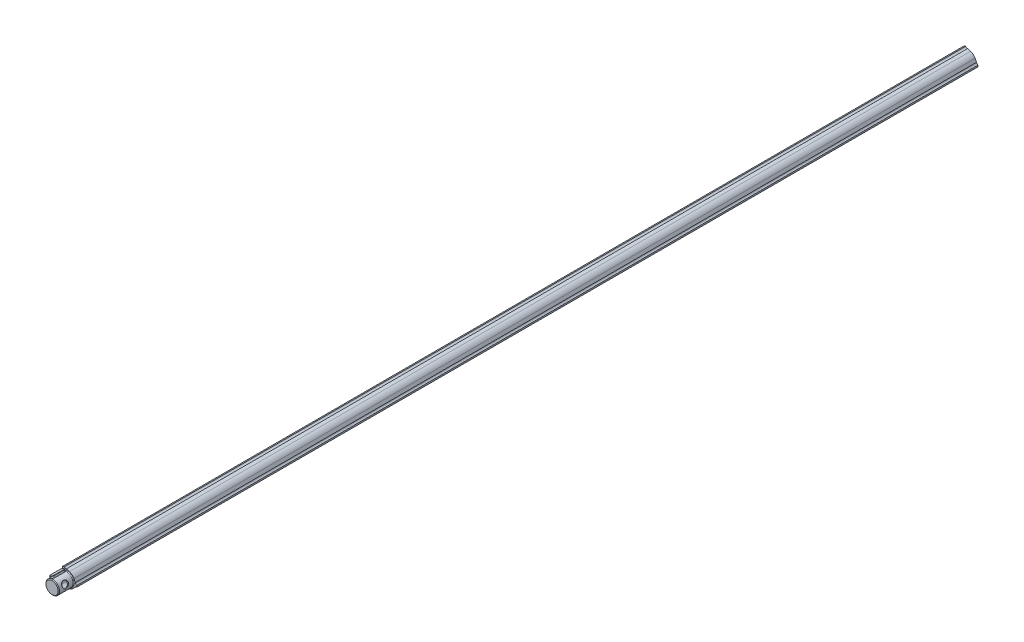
ISO-10303-21;
HEADER;
FILE_DESCRIPTION(('STEP AP214'),'2;1');
FILE_NAME('part.step','',(''),(''),'','','');
FILE_SCHEMA(('AUTOMOTIVE_DESIGN { 1 0 10303 214 1 1 1 1 }'));
ENDSEC;
DATA;
#1=APPLICATION_CONTEXT('core data for automotive mechanical design processes');
#2=APPLICATION_PROTOCOL_DEFINITION('international standard','automotive_design',2000,#1);
#3=PRODUCT_CONTEXT('',#1,'mechanical');
#4=PRODUCT('Part','Part','',(#3));
#5=PRODUCT_RELATED_PRODUCT_CATEGORY('part','',(#4));
#6=PRODUCT_DEFINITION_FORMATION('','',#4);
#7=PRODUCT_DEFINITION_CONTEXT('part definition',#1,'design');
#8=PRODUCT_DEFINITION('design','',#6,#7);
#9=PRODUCT_DEFINITION_SHAPE('','',#8);
#10=(LENGTH_UNIT() NAMED_UNIT(*) SI_UNIT(.MILLI.,.METRE.));
#11=(NAMED_UNIT(*) PLANE_ANGLE_UNIT() SI_UNIT($,.RADIAN.));
#12=(NAMED_UNIT(*) SI_UNIT($,.STERADIAN.) SOLID_ANGLE_UNIT());
#13=UNCERTAINTY_MEASURE_WITH_UNIT(LENGTH_MEASURE(1.E-05),#10,'distance_accuracy_value','');
#14=(GEOMETRIC_REPRESENTATION_CONTEXT(3) GLOBAL_UNCERTAINTY_ASSIGNED_CONTEXT((#13)) GLOBAL_UNIT_ASSIGNED_CONTEXT((#10,
#11,#12)) REPRESENTATION_CONTEXT('',''));
#15=CARTESIAN_POINT('',(0.,0.,0.));
#16=DIRECTION('',(0.,0.,1.));
#17=DIRECTION('',(1.,0.,0.));
#18=AXIS2_PLACEMENT_3D('',#15,#16,#17);
#19=CARTESIAN_POINT('',(-1.14477804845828,2.9882240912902,1325.8));
#20=DIRECTION('',(-0.35774314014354,0.93382002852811,0.));
#21=DIRECTION('',(0.,0.,1.));
#22=AXIS2_PLACEMENT_3D('',#19,#20,#21);
#23=CYLINDRICAL_SURFACE('',#22,1.5);
#24=DIRECTION('',(-0.35774314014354,0.93382002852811,0.));
#25=VECTOR('',#24,1.);
#26=CARTESIAN_POINT('',(-2.54550809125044,2.45160938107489,1325.8));
#27=LINE('',#26,#25);
#28=CARTESIAN_POINT('',(-2.63494387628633,2.68506438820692,1325.8));
#29=VERTEX_POINT('',#28);
#30=CARTESIAN_POINT('',(-3.52930172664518,5.01961445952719,1325.8));
#31=VERTEX_POINT('',#30);
#32=EDGE_CURVE('P0_E103',#29,#31,#27,.T.);
#33=ORIENTED_EDGE('',*,*,#32,.F.);
#34=CARTESIAN_POINT('',(-1.23421383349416,3.22167909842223,1325.8));
#35=DIRECTION('',(0.35774314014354,-0.93382002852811,0.));
#36=DIRECTION('',(0.,0.,-1.));
#37=AXIS2_PLACEMENT_3D('',#34,#35,#36);
#38=CIRCLE('',#37,1.5);
#39=CARTESIAN_POINT('',(0.166516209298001,3.75829380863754,1325.8));
#40=VERTEX_POINT('',#39);
#41=EDGE_CURVE('P0_E39',#29,#40,#38,.F.);
#42=ORIENTED_EDGE('',*,*,#41,.T.);
#43=DIRECTION('',(-0.35774314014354,0.93382002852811,0.));
#44=VECTOR('',#43,1.);
#45=CARTESIAN_POINT('',(0.255951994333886,3.52483880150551,1325.8));
#46=LINE('',#45,#44);
#47=CARTESIAN_POINT('',(-0.727841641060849,6.09284387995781,1325.8));
#48=VERTEX_POINT('',#47);
#49=EDGE_CURVE('P0_E139',#40,#48,#46,.T.);
#50=ORIENTED_EDGE('',*,*,#49,.T.);
#51=CARTESIAN_POINT('',(-2.12857168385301,5.5562291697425,1325.8));
#52=DIRECTION('',(0.35774314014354,-0.93382002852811,0.));
#53=DIRECTION('',(0.,0.,-1.));
#54=AXIS2_PLACEMENT_3D('',#51,#52,#53);
#55=CIRCLE('',#54,1.5);
#56=EDGE_CURVE('P0_E130',#48,#31,#55,.T.);
#57=ORIENTED_EDGE('',*,*,#56,.T.);
#58=EDGE_LOOP('',(#33,#42,#50,#57));
#59=FACE_BOUND('',#58,.T.);
#60=ADVANCED_FACE('P0_F16',(#59),#23,.T.);
#61=CARTESIAN_POINT('',(-2.54550809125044,2.45160938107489,1325.8));
#62=DIRECTION('',(0.93382002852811,0.35774314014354,0.));
#63=DIRECTION('',(0.,0.,1.));
#64=AXIS2_PLACEMENT_3D('',#61,#62,#63);
#65=PLANE('',#64);
#66=DIRECTION('',(-0.35774314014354,0.93382002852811,0.));
#67=VECTOR('',#66,1.);
#68=CARTESIAN_POINT('',(-2.54550809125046,2.45160938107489,1318.8));
#69=LINE('',#68,#67);
#70=CARTESIAN_POINT('',(-2.63494387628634,2.68506438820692,1318.8));
#71=VERTEX_POINT('',#70);
#72=CARTESIAN_POINT('',(-3.52930172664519,5.01961445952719,1318.8));
#73=VERTEX_POINT('',#72);
#74=EDGE_CURVE('P0_E172',#71,#73,#69,.T.);
#75=ORIENTED_EDGE('',*,*,#74,.F.);
#76=DIRECTION('',(0.,0.,-1.));
#77=VECTOR('',#76,1.);
#78=CARTESIAN_POINT('',(-2.63494387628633,2.68506438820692,1325.8));
#79=LINE('',#78,#77);
#80=EDGE_CURVE('P0_E128',#71,#29,#79,.F.);
#81=ORIENTED_EDGE('',*,*,#80,.T.);
#82=ORIENTED_EDGE('',*,*,#32,.T.);
#83=DIRECTION('',(0.,0.,-1.));
#84=VECTOR('',#83,1.);
#85=CARTESIAN_POINT('',(-3.52930172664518,5.01961445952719,1325.8));
#86=LINE('',#85,#84);
#87=EDGE_CURVE('P0_E126',#31,#73,#86,.T.);
#88=ORIENTED_EDGE('',*,*,#87,.T.);
#89=EDGE_LOOP('',(#75,#81,#82,#88));
#90=FACE_BOUND('',#89,.T.);
#91=ADVANCED_FACE('P0_F186',(#90),#65,.F.);
#92=CARTESIAN_POINT('',(-1.14477804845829,2.9882240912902,1318.8));
#93=DIRECTION('',(-0.35774314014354,0.93382002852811,0.));
#94=DIRECTION('',(0.,0.,1.));
#95=AXIS2_PLACEMENT_3D('',#92,#93,#94);
#96=CYLINDRICAL_SURFACE('',#95,1.5);
#97=DIRECTION('',(-0.35774314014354,0.93382002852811,0.));
#98=VECTOR('',#97,1.);
#99=CARTESIAN_POINT('',(0.255951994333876,3.52483880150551,1318.8));
#100=LINE('',#99,#98);
#101=CARTESIAN_POINT('',(0.166516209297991,3.75829380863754,1318.8));
#102=VERTEX_POINT('',#101);
#103=CARTESIAN_POINT('',(-0.72784164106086,6.09284387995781,1318.8));
#104=VERTEX_POINT('',#103);
#105=EDGE_CURVE('P0_E170',#102,#104,#100,.T.);
#106=ORIENTED_EDGE('',*,*,#105,.F.);
#107=CARTESIAN_POINT('',(-1.23421383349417,3.22167909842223,1318.8));
#108=DIRECTION('',(0.35774314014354,-0.93382002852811,0.));
#109=DIRECTION('',(0.,0.,-1.));
#110=AXIS2_PLACEMENT_3D('',#107,#108,#109);
#111=CIRCLE('',#110,1.5);
#112=EDGE_CURVE('P0_E90',#102,#71,#111,.F.);
#113=ORIENTED_EDGE('',*,*,#112,.T.);
#114=ORIENTED_EDGE('',*,*,#74,.T.);
#115=CARTESIAN_POINT('',(-2.12857168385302,5.5562291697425,1318.8));
#116=DIRECTION('',(0.35774314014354,-0.93382002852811,0.));
#117=DIRECTION('',(0.,0.,-1.));
#118=AXIS2_PLACEMENT_3D('',#115,#116,#117);
#119=CIRCLE('',#118,1.5);
#120=EDGE_CURVE('P0_E109',#73,#104,#119,.T.);
#121=ORIENTED_EDGE('',*,*,#120,.T.);
#122=EDGE_LOOP('',(#106,#113,#114,#121));
#123=FACE_BOUND('',#122,.T.);
#124=ADVANCED_FACE('P0_F169',(#123),#96,.T.);
#125=CARTESIAN_POINT('',(0.255951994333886,3.52483880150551,1325.8));
#126=DIRECTION('',(-0.93382002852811,-0.35774314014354,0.));
#127=DIRECTION('',(0.,0.,-1.));
#128=AXIS2_PLACEMENT_3D('',#125,#126,#127);
#129=PLANE('',#128);
#130=ORIENTED_EDGE('',*,*,#49,.F.);
#131=DIRECTION('',(0.,0.,1.));
#132=VECTOR('',#131,1.);
#133=CARTESIAN_POINT('',(0.166516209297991,3.75829380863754,1318.8));
#134=LINE('',#133,#132);
#135=EDGE_CURVE('P0_E11',#40,#102,#134,.F.);
#136=ORIENTED_EDGE('',*,*,#135,.T.);
#137=ORIENTED_EDGE('',*,*,#105,.T.);
#138=DIRECTION('',(0.,0.,1.));
#139=VECTOR('',#138,1.);
#140=CARTESIAN_POINT('',(-0.727841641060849,6.09284387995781,1325.8));
#141=LINE('',#140,#139);
#142=EDGE_CURVE('P0_E25',#104,#48,#141,.T.);
#143=ORIENTED_EDGE('',*,*,#142,.T.);
#144=EDGE_LOOP('',(#130,#136,#137,#143));
#145=FACE_BOUND('',#144,.T.);
#146=ADVANCED_FACE('P0_F173',(#145),#129,.F.);
#147=CARTESIAN_POINT('',(-1.14477804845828,2.9882240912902,1325.8));
#148=DIRECTION('',(0.35774314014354,-0.93382002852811,0.));
#149=DIRECTION('',(0.,0.,-1.));
#150=AXIS2_PLACEMENT_3D('',#147,#148,#149);
#151=PLANE('',#150);
#152=DIRECTION('',(0.,0.,-1.));
#153=VECTOR('',#152,1.);
#154=CARTESIAN_POINT('',(-2.31205308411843,2.54104516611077,1318.8));
#155=LINE('',#154,#153);
#156=CARTESIAN_POINT('',(-2.31205308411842,2.54104516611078,1325.8));
#157=VERTEX_POINT('',#156);
#158=CARTESIAN_POINT('',(-2.31205308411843,2.54104516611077,1318.8));
#159=VERTEX_POINT('',#158);
#160=EDGE_CURVE('P0_E107',#157,#159,#155,.T.);
#161=ORIENTED_EDGE('',*,*,#160,.T.);
#162=CARTESIAN_POINT('',(-1.14477804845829,2.9882240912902,1318.8));
#163=DIRECTION('',(0.35774314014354,-0.93382002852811,0.));
#164=DIRECTION('',(0.,0.,-1.));
#165=AXIS2_PLACEMENT_3D('',#162,#163,#164);
#166=CIRCLE('',#165,1.25);
#167=CARTESIAN_POINT('',(0.0224969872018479,3.43540301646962,1318.8));
#168=VERTEX_POINT('',#167);
#169=EDGE_CURVE('P0_E88',#159,#168,#166,.T.);
#170=ORIENTED_EDGE('',*,*,#169,.T.);
#171=DIRECTION('',(0.,0.,1.));
#172=VECTOR('',#171,1.);
#173=CARTESIAN_POINT('',(0.0224969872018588,3.43540301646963,1325.8));
#174=LINE('',#173,#172);
#175=CARTESIAN_POINT('',(0.0224969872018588,3.43540301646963,1325.8));
#176=VERTEX_POINT('',#175);
#177=EDGE_CURVE('P0_E96',#168,#176,#174,.T.);
#178=ORIENTED_EDGE('',*,*,#177,.T.);
#179=CARTESIAN_POINT('',(-1.14477804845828,2.9882240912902,1325.8));
#180=DIRECTION('',(0.35774314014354,-0.93382002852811,0.));
#181=DIRECTION('',(0.,0.,-1.));
#182=AXIS2_PLACEMENT_3D('',#179,#180,#181);
#183=CIRCLE('',#182,1.25);
#184=EDGE_CURVE('P0_E102',#176,#157,#183,.T.);
#185=ORIENTED_EDGE('',*,*,#184,.T.);
#186=EDGE_LOOP('',(#161,#170,#178,#185));
#187=FACE_BOUND('',#186,.T.);
#188=ADVANCED_FACE('P0_F105',(#187),#151,.T.);
#189=CARTESIAN_POINT('',(-2.2180074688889,5.78968417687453,1325.8));
#190=DIRECTION('',(0.35774314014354,-0.93382002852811,0.));
#191=DIRECTION('',(0.,0.,-1.));
#192=AXIS2_PLACEMENT_3D('',#189,#190,#191);
#193=PLANE('',#192);
#194=DIRECTION('',(0.,0.,1.));
#195=VECTOR('',#194,1.);
#196=CARTESIAN_POINT('',(-1.05073243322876,6.23686310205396,1325.8));
#197=LINE('',#196,#195);
#198=CARTESIAN_POINT('',(-1.05073243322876,6.23686310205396,1325.8));
#199=VERTEX_POINT('',#198);
#200=CARTESIAN_POINT('',(-1.05073243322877,6.23686310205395,1318.8));
#201=VERTEX_POINT('',#200);
#202=EDGE_CURVE('P0_E121',#199,#201,#197,.F.);
#203=ORIENTED_EDGE('',*,*,#202,.T.);
#204=CARTESIAN_POINT('',(-2.21800746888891,5.78968417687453,1318.8));
#205=DIRECTION('',(0.35774314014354,-0.93382002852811,0.));
#206=DIRECTION('',(0.,0.,-1.));
#207=AXIS2_PLACEMENT_3D('',#204,#205,#206);
#208=CIRCLE('',#207,1.25);
#209=CARTESIAN_POINT('',(-3.38528250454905,5.3425052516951,1318.8));
#210=VERTEX_POINT('',#209);
#211=EDGE_CURVE('P0_E123',#201,#210,#208,.F.);
#212=ORIENTED_EDGE('',*,*,#211,.T.);
#213=DIRECTION('',(0.,0.,-1.));
#214=VECTOR('',#213,1.);
#215=CARTESIAN_POINT('',(-3.38528250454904,5.3425052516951,1325.8));
#216=LINE('',#215,#214);
#217=CARTESIAN_POINT('',(-3.38528250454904,5.3425052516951,1325.8));
#218=VERTEX_POINT('',#217);
#219=EDGE_CURVE('P0_E117',#210,#218,#216,.F.);
#220=ORIENTED_EDGE('',*,*,#219,.T.);
#221=CARTESIAN_POINT('',(-2.2180074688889,5.78968417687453,1325.8));
#222=DIRECTION('',(0.35774314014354,-0.93382002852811,0.));
#223=DIRECTION('',(0.,0.,-1.));
#224=AXIS2_PLACEMENT_3D('',#221,#222,#223);
#225=CIRCLE('',#224,1.25);
#226=EDGE_CURVE('P0_E119',#218,#199,#225,.F.);
#227=ORIENTED_EDGE('',*,*,#226,.T.);
#228=EDGE_LOOP('',(#203,#212,#220,#227));
#229=FACE_BOUND('',#228,.T.);
#230=ADVANCED_FACE('P0_F159',(#229),#193,.F.);
#231=CARTESIAN_POINT('',(-1.23421383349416,3.22167909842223,1325.8));
#232=DIRECTION('',(0.35774314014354,-0.93382002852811,0.));
#233=DIRECTION('',(0.,0.,-1.));
#234=AXIS2_PLACEMENT_3D('',#231,#232,#233);
#235=TOROIDAL_SURFACE('',#234,1.25,0.25);
#236=CARTESIAN_POINT('',(-0.0669387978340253,3.66885802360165,1325.8));
#237=DIRECTION('',(0.,0.,-1.));
#238=DIRECTION('',(-0.35774314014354,0.93382002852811,0.));
#239=AXIS2_PLACEMENT_3D('',#236,#237,#238);
#240=CIRCLE('',#239,0.25);
#241=EDGE_CURVE('P0_E99',#40,#176,#240,.T.);
#242=ORIENTED_EDGE('',*,*,#241,.F.);
#243=ORIENTED_EDGE('',*,*,#41,.F.);
#244=CARTESIAN_POINT('',(-2.4014888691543,2.7745001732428,1325.8));
#245=DIRECTION('',(0.,0.,-1.));
#246=DIRECTION('',(-0.35774314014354,0.93382002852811,0.));
#247=AXIS2_PLACEMENT_3D('',#244,#245,#246);
#248=CIRCLE('',#247,0.25);
#249=EDGE_CURVE('P0_E136',#157,#29,#248,.T.);
#250=ORIENTED_EDGE('',*,*,#249,.F.);
#251=ORIENTED_EDGE('',*,*,#184,.F.);
#252=EDGE_LOOP('',(#242,#243,#250,#251));
#253=FACE_BOUND('',#252,.T.);
#254=ADVANCED_FACE('P0_F181',(#253),#235,.T.);
#255=CARTESIAN_POINT('',(-2.4014888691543,2.7745001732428,1325.8));
#256=DIRECTION('',(0.,0.,1.));
#257=DIRECTION('',(-0.93382002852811,-0.35774314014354,0.));
#258=AXIS2_PLACEMENT_3D('',#255,#256,#257);
#259=CYLINDRICAL_SURFACE('',#258,0.25);
#260=ORIENTED_EDGE('',*,*,#249,.T.);
#261=ORIENTED_EDGE('',*,*,#80,.F.);
#262=CARTESIAN_POINT('',(-2.40148886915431,2.7745001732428,1318.8));
#263=DIRECTION('',(0.,0.,-1.));
#264=DIRECTION('',(-0.35774314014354,0.93382002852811,0.));
#265=AXIS2_PLACEMENT_3D('',#262,#263,#264);
#266=CIRCLE('',#265,0.25);
#267=EDGE_CURVE('P0_E93',#159,#71,#266,.T.);
#268=ORIENTED_EDGE('',*,*,#267,.F.);
#269=ORIENTED_EDGE('',*,*,#160,.F.);
#270=EDGE_LOOP('',(#260,#261,#268,#269));
#271=FACE_BOUND('',#270,.T.);
#272=ADVANCED_FACE('P0_F184',(#271),#259,.T.);
#273=CARTESIAN_POINT('',(-0.0669387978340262,3.66885802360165,1325.8));
#274=DIRECTION('',(0.,0.,-1.));
#275=DIRECTION('',(0.93382002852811,0.35774314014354,0.));
#276=AXIS2_PLACEMENT_3D('',#273,#274,#275);
#277=CYLINDRICAL_SURFACE('',#276,0.25);
#278=ORIENTED_EDGE('',*,*,#241,.T.);
#279=ORIENTED_EDGE('',*,*,#177,.F.);
#280=CARTESIAN_POINT('',(-0.066938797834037,3.66885802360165,1318.8));
#281=DIRECTION('',(0.,0.,-1.));
#282=DIRECTION('',(-0.35774314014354,0.93382002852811,0.));
#283=AXIS2_PLACEMENT_3D('',#280,#281,#282);
#284=CIRCLE('',#283,0.25);
#285=EDGE_CURVE('P0_E84',#102,#168,#284,.T.);
#286=ORIENTED_EDGE('',*,*,#285,.F.);
#287=ORIENTED_EDGE('',*,*,#135,.F.);
#288=EDGE_LOOP('',(#278,#279,#286,#287));
#289=FACE_BOUND('',#288,.T.);
#290=ADVANCED_FACE('P0_F97',(#289),#277,.T.);
#291=CARTESIAN_POINT('',(-1.23421383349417,3.22167909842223,1318.8));
#292=DIRECTION('',(0.35774314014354,-0.93382002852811,0.));
#293=DIRECTION('',(0.,0.,-1.));
#294=AXIS2_PLACEMENT_3D('',#291,#292,#293);
#295=TOROIDAL_SURFACE('',#294,1.25,0.25);
#296=ORIENTED_EDGE('',*,*,#267,.T.);
#297=ORIENTED_EDGE('',*,*,#112,.F.);
#298=ORIENTED_EDGE('',*,*,#285,.T.);
#299=ORIENTED_EDGE('',*,*,#169,.F.);
#300=EDGE_LOOP('',(#296,#297,#298,#299));
#301=FACE_BOUND('',#300,.T.);
#302=ADVANCED_FACE('P0_F86',(#301),#295,.T.);
#303=CARTESIAN_POINT('',(-2.12857168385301,5.5562291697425,1325.8));
#304=DIRECTION('',(0.35774314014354,-0.93382002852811,0.));
#305=DIRECTION('',(0.,0.,-1.));
#306=AXIS2_PLACEMENT_3D('',#303,#304,#305);
#307=TOROIDAL_SURFACE('',#306,1.25,0.25);
#308=CARTESIAN_POINT('',(-0.961296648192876,6.00340809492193,1325.8));
#309=DIRECTION('',(0.,0.,-1.));
#310=DIRECTION('',(-0.35774314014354,0.93382002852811,0.));
#311=AXIS2_PLACEMENT_3D('',#308,#309,#310);
#312=CIRCLE('',#311,0.25);
#313=EDGE_CURVE('P0_E143',#199,#48,#312,.T.);
#314=ORIENTED_EDGE('',*,*,#313,.F.);
#315=ORIENTED_EDGE('',*,*,#226,.F.);
#316=CARTESIAN_POINT('',(-3.29584671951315,5.10905024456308,1325.8));
#317=DIRECTION('',(0.,0.,-1.));
#318=DIRECTION('',(-0.35774314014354,0.93382002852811,0.));
#319=AXIS2_PLACEMENT_3D('',#316,#317,#318);
#320=CIRCLE('',#319,0.25);
#321=EDGE_CURVE('P0_E20',#31,#218,#320,.T.);
#322=ORIENTED_EDGE('',*,*,#321,.F.);
#323=ORIENTED_EDGE('',*,*,#56,.F.);
#324=EDGE_LOOP('',(#314,#315,#322,#323));
#325=FACE_BOUND('',#324,.T.);
#326=ADVANCED_FACE('P0_F18',(#325),#307,.T.);
#327=CARTESIAN_POINT('',(-3.29584671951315,5.10905024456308,1325.8));
#328=DIRECTION('',(0.,0.,-1.));
#329=DIRECTION('',(0.93382002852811,0.35774314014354,0.));
#330=AXIS2_PLACEMENT_3D('',#327,#328,#329);
#331=CYLINDRICAL_SURFACE('',#330,0.25);
#332=ORIENTED_EDGE('',*,*,#321,.T.);
#333=ORIENTED_EDGE('',*,*,#219,.F.);
#334=CARTESIAN_POINT('',(-3.29584671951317,5.10905024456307,1318.8));
#335=DIRECTION('',(0.,0.,-1.));
#336=DIRECTION('',(-0.35774314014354,0.93382002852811,0.));
#337=AXIS2_PLACEMENT_3D('',#334,#335,#336);
#338=CIRCLE('',#337,0.25);
#339=EDGE_CURVE('P0_E142',#73,#210,#338,.T.);
#340=ORIENTED_EDGE('',*,*,#339,.F.);
#341=ORIENTED_EDGE('',*,*,#87,.F.);
#342=EDGE_LOOP('',(#332,#333,#340,#341));
#343=FACE_BOUND('',#342,.T.);
#344=ADVANCED_FACE('P0_F153',(#343),#331,.T.);
#345=CARTESIAN_POINT('',(-0.961296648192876,6.00340809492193,1325.8));
#346=DIRECTION('',(0.,0.,1.));
#347=DIRECTION('',(-0.93382002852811,-0.35774314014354,0.));
#348=AXIS2_PLACEMENT_3D('',#345,#346,#347);
#349=CYLINDRICAL_SURFACE('',#348,0.25);
#350=ORIENTED_EDGE('',*,*,#313,.T.);
#351=ORIENTED_EDGE('',*,*,#142,.F.);
#352=CARTESIAN_POINT('',(-0.961296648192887,6.00340809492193,1318.8));
#353=DIRECTION('',(0.,0.,-1.));
#354=DIRECTION('',(-0.35774314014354,0.93382002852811,0.));
#355=AXIS2_PLACEMENT_3D('',#352,#353,#354);
#356=CIRCLE('',#355,0.25);
#357=EDGE_CURVE('P0_E140',#201,#104,#356,.T.);
#358=ORIENTED_EDGE('',*,*,#357,.F.);
#359=ORIENTED_EDGE('',*,*,#202,.F.);
#360=EDGE_LOOP('',(#350,#351,#358,#359));
#361=FACE_BOUND('',#360,.T.);
#362=ADVANCED_FACE('P0_F165',(#361),#349,.T.);
#363=CARTESIAN_POINT('',(-2.12857168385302,5.5562291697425,1318.8));
#364=DIRECTION('',(0.35774314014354,-0.93382002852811,0.));
#365=DIRECTION('',(0.,0.,-1.));
#366=AXIS2_PLACEMENT_3D('',#363,#364,#365);
#367=TOROIDAL_SURFACE('',#366,1.25,0.25);
#368=ORIENTED_EDGE('',*,*,#339,.T.);
#369=ORIENTED_EDGE('',*,*,#211,.F.);
#370=ORIENTED_EDGE('',*,*,#357,.T.);
#371=ORIENTED_EDGE('',*,*,#120,.F.);
#372=EDGE_LOOP('',(#368,#369,#370,#371));
#373=FACE_BOUND('',#372,.T.);
#374=ADVANCED_FACE('P0_F163',(#373),#367,.T.);
#375=CLOSED_SHELL('',(#60,#91,#124,#146,#188,#230,#254,#272,#290,#302,#326,#344,#362,#374));
#376=MANIFOLD_SOLID_BREP('P0_B1',#375);
#377=CARTESIAN_POINT('',(-0.106010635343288,-5.84903938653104,1328.2));
#378=DIRECTION('',(-0.0181214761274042,-0.999835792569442,0.));
#379=DIRECTION('',(0.999835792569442,-0.0181214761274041,0.));
#380=AXIS2_PLACEMENT_3D('',#377,#378,#379);
#381=PLANE('',#380);
#382=DIRECTION('',(0.,0.,-1.));
#383=VECTOR('',#382,1.);
#384=CARTESIAN_POINT('',(-0.106010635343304,-5.849039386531,1328.2));
#385=LINE('',#384,#383);
#386=CARTESIAN_POINT('',(-0.106010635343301,-5.84903938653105,1317.2));
#387=VERTEX_POINT('',#386);
#388=CARTESIAN_POINT('',(-0.106010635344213,-5.84903938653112,652.2));
#389=VERTEX_POINT('',#388);
#390=EDGE_CURVE('P1_E354',#387,#389,#385,.T.);
#391=ORIENTED_EDGE('',*,*,#390,.F.);
#392=DIRECTION('',(-0.999835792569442,0.0181214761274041,0.));
#393=VECTOR('',#392,1.);
#394=CARTESIAN_POINT('',(-0.106010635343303,-5.84903938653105,1317.2));
#395=LINE('',#394,#393);
#396=CARTESIAN_POINT('',(-2.38514392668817,-5.80773134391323,1317.2));
#397=VERTEX_POINT('',#396);
#398=EDGE_CURVE('P1_E225',#387,#397,#395,.T.);
#399=ORIENTED_EDGE('',*,*,#398,.T.);
#400=DIRECTION('',(0.,0.,-1.));
#401=VECTOR('',#400,1.);
#402=CARTESIAN_POINT('',(-2.38514392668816,-5.80773134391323,1328.2));
#403=LINE('',#402,#401);
#404=CARTESIAN_POINT('',(-2.38514392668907,-5.80773134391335,652.2));
#405=VERTEX_POINT('',#404);
#406=EDGE_CURVE('P1_E353',#397,#405,#403,.T.);
#407=ORIENTED_EDGE('',*,*,#406,.T.);
#408=CARTESIAN_POINT('',(-0.106010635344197,-5.84903938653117,652.2));
#409=CARTESIAN_POINT('',(-0.865721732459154,-5.8352700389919,652.2));
#410=CARTESIAN_POINT('',(-1.62543282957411,-5.82150069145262,652.2));
#411=CARTESIAN_POINT('',(-2.38514392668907,-5.80773134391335,652.2));
#412=B_SPLINE_CURVE_WITH_KNOTS('',3,(#408,#409,#410,#411),.UNSPECIFIED.,.F.,.F.,(4,4),(0.,1.),.UNSPECIFIED.);
#413=EDGE_CURVE('P1_E274',#389,#405,#412,.T.);
#414=ORIENTED_EDGE('',*,*,#413,.F.);
#415=EDGE_LOOP('',(#391,#399,#407,#414));
#416=FACE_BOUND('',#415,.T.);
#417=ADVANCED_FACE('P1_F15',(#416),#381,.T.);
#418=CARTESIAN_POINT('',(1.64202822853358E-12,2.60127390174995E-13,1328.2));
#419=DIRECTION('',(0.,0.,-1.));
#420=DIRECTION('',(-0.93382002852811,-0.35774314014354,0.));
#421=AXIS2_PLACEMENT_3D('',#418,#419,#420);
#422=CYLINDRICAL_SURFACE('',#421,5.85000000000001);
#423=DIRECTION('',(0.,0.,-1.));
#424=VECTOR('',#423,1.);
#425=CARTESIAN_POINT('',(3.98682677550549,-4.28108774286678,1328.2));
#426=LINE('',#425,#424);
#427=CARTESIAN_POINT('',(3.98682677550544,-4.28108774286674,1317.2));
#428=VERTEX_POINT('',#427);
#429=CARTESIAN_POINT('',(3.98682677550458,-4.28108774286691,652.2));
#430=VERTEX_POINT('',#429);
#431=EDGE_CURVE('P1_E357',#428,#430,#426,.T.);
#432=ORIENTED_EDGE('',*,*,#431,.F.);
#433=CARTESIAN_POINT('',(1.6272412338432E-12,2.5810640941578E-13,1317.2));
#434=DIRECTION('',(0.,0.,1.));
#435=DIRECTION('',(0.93382002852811,0.35774314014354,0.));
#436=AXIS2_PLACEMENT_3D('',#433,#434,#435);
#437=CIRCLE('',#436,5.85000000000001);
#438=EDGE_CURVE('P1_E229',#428,#387,#437,.F.);
#439=ORIENTED_EDGE('',*,*,#438,.T.);
#440=ORIENTED_EDGE('',*,*,#390,.T.);
#441=CARTESIAN_POINT('',(7.33300191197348E-13,1.3592893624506E-13,652.2));
#442=DIRECTION('',(0.,0.,-1.));
#443=DIRECTION('',(-0.93382002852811,-0.35774314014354,0.));
#444=AXIS2_PLACEMENT_3D('',#441,#442,#443);
#445=CIRCLE('',#444,5.85000000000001);
#446=EDGE_CURVE('P1_E347',#430,#389,#445,.T.);
#447=ORIENTED_EDGE('',*,*,#446,.F.);
#448=EDGE_LOOP('',(#432,#439,#440,#447));
#449=FACE_BOUND('',#448,.T.);
#450=ADVANCED_FACE('P1_F529',(#449),#422,.T.);
#451=CARTESIAN_POINT('',(5.65499288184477,-2.72758307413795,1328.2));
#452=DIRECTION('',(0.681508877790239,-0.731809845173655,0.));
#453=DIRECTION('',(0.731809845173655,0.68150887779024,0.));
#454=AXIS2_PLACEMENT_3D('',#451,#452,#453);
#455=PLANE('',#454);
#456=DIRECTION('',(0.,0.,-1.));
#457=VECTOR('',#456,1.);
#458=CARTESIAN_POINT('',(5.65499288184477,-2.72758307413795,1328.2));
#459=LINE('',#458,#457);
#460=CARTESIAN_POINT('',(5.65499288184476,-2.72758307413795,1317.2));
#461=VERTEX_POINT('',#460);
#462=CARTESIAN_POINT('',(5.65499288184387,-2.72758307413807,652.2));
#463=VERTEX_POINT('',#462);
#464=EDGE_CURVE('P1_E359',#461,#463,#459,.T.);
#465=ORIENTED_EDGE('',*,*,#464,.F.);
#466=DIRECTION('',(-0.731809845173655,-0.68150887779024,0.));
#467=VECTOR('',#466,1.);
#468=CARTESIAN_POINT('',(5.65499288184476,-2.72758307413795,1317.2));
#469=LINE('',#468,#467);
#470=EDGE_CURVE('P1_E232',#461,#428,#469,.T.);
#471=ORIENTED_EDGE('',*,*,#470,.T.);
#472=ORIENTED_EDGE('',*,*,#431,.T.);
#473=CARTESIAN_POINT('',(5.65499288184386,-2.72758307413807,652.2));
#474=CARTESIAN_POINT('',(5.0989375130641,-3.24541796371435,652.2));
#475=CARTESIAN_POINT('',(4.54288214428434,-3.76325285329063,652.2));
#476=CARTESIAN_POINT('',(3.98682677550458,-4.28108774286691,652.2));
#477=B_SPLINE_CURVE_WITH_KNOTS('',3,(#473,#474,#475,#476),.UNSPECIFIED.,.F.,.F.,(4,4),(0.,1.),.UNSPECIFIED.);
#478=EDGE_CURVE('P1_E342',#463,#430,#477,.T.);
#479=ORIENTED_EDGE('',*,*,#478,.F.);
#480=EDGE_LOOP('',(#465,#471,#472,#479));
#481=FACE_BOUND('',#480,.T.);
#482=ADVANCED_FACE('P1_F534',(#481),#455,.T.);
#483=CARTESIAN_POINT('',(6.85023271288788,-3.05773719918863,1328.2));
#484=DIRECTION('',(0.,0.,-1.));
#485=DIRECTION('',(-0.93382002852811,-0.35774314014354,0.));
#486=AXIS2_PLACEMENT_3D('',#483,#484,#485);
#487=CYLINDRICAL_SURFACE('',#486,1.23999999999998);
#488=DIRECTION('',(0.,0.,-1.));
#489=VECTOR('',#488,1.);
#490=CARTESIAN_POINT('',(7.01555167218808,-1.82880691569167,1328.2));
#491=LINE('',#490,#489);
#492=CARTESIAN_POINT('',(7.01555167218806,-1.82880691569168,1317.2));
#493=VERTEX_POINT('',#492);
#494=CARTESIAN_POINT('',(7.01555167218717,-1.8288069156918,652.2));
#495=VERTEX_POINT('',#494);
#496=EDGE_CURVE('P1_E361',#493,#495,#491,.T.);
#497=ORIENTED_EDGE('',*,*,#496,.F.);
#498=CARTESIAN_POINT('',(6.85023271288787,-3.05773719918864,1317.2));
#499=DIRECTION('',(0.,0.,1.));
#500=DIRECTION('',(0.93382002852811,0.35774314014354,0.));
#501=AXIS2_PLACEMENT_3D('',#498,#499,#500);
#502=CIRCLE('',#501,1.23999999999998);
#503=EDGE_CURVE('P1_E235',#493,#461,#502,.T.);
#504=ORIENTED_EDGE('',*,*,#503,.T.);
#505=ORIENTED_EDGE('',*,*,#464,.T.);
#506=CARTESIAN_POINT('',(6.85023271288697,-3.05773719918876,652.2));
#507=DIRECTION('',(0.,0.,1.));
#508=DIRECTION('',(0.93382002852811,0.35774314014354,0.));
#509=AXIS2_PLACEMENT_3D('',#506,#507,#508);
#510=CIRCLE('',#509,1.23999999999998);
#511=EDGE_CURVE('P1_E339',#495,#463,#510,.T.);
#512=ORIENTED_EDGE('',*,*,#511,.F.);
#513=EDGE_LOOP('',(#497,#504,#505,#512));
#514=FACE_BOUND('',#513,.T.);
#515=ADVANCED_FACE('P1_F549',(#514),#487,.F.);
#516=CARTESIAN_POINT('',(1.64202822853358E-12,2.60127390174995E-13,1328.2));
#517=DIRECTION('',(0.,0.,-1.));
#518=DIRECTION('',(-0.93382002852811,-0.35774314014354,0.));
#519=AXIS2_PLACEMENT_3D('',#516,#517,#518);
#520=CYLINDRICAL_SURFACE('',#519,7.25000000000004);
#521=DIRECTION('',(0.,0.,-1.));
#522=VECTOR('',#521,1.);
#523=CARTESIAN_POINT('',(7.23673841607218,-0.438311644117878,1328.2));
#524=LINE('',#523,#522);
#525=CARTESIAN_POINT('',(7.23673841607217,-0.438311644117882,1317.2));
#526=VERTEX_POINT('',#525);
#527=CARTESIAN_POINT('',(7.23673841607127,-0.438311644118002,652.2));
#528=VERTEX_POINT('',#527);
#529=EDGE_CURVE('P1_E363',#526,#528,#524,.T.);
#530=ORIENTED_EDGE('',*,*,#529,.F.);
#531=CARTESIAN_POINT('',(1.67813326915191E-12,3.20437773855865E-13,1317.2));
#532=DIRECTION('',(0.,0.,1.));
#533=DIRECTION('',(0.93382002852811,0.35774314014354,0.));
#534=AXIS2_PLACEMENT_3D('',#531,#532,#533);
#535=CIRCLE('',#534,7.25);
#536=EDGE_CURVE('P1_E214',#493,#526,#535,.T.);
#537=ORIENTED_EDGE('',*,*,#536,.F.);
#538=ORIENTED_EDGE('',*,*,#496,.T.);
#539=CARTESIAN_POINT('',(7.33300191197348E-13,1.3592893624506E-13,652.2));
#540=DIRECTION('',(0.,0.,-1.));
#541=DIRECTION('',(-0.93382002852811,-0.35774314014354,0.));
#542=AXIS2_PLACEMENT_3D('',#539,#540,#541);
#543=CIRCLE('',#542,7.25000000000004);
#544=EDGE_CURVE('P1_E336',#528,#495,#543,.T.);
#545=ORIENTED_EDGE('',*,*,#544,.F.);
#546=EDGE_LOOP('',(#530,#537,#538,#545));
#547=FACE_BOUND('',#546,.T.);
#548=ADVANCED_FACE('P1_F553',(#547),#520,.T.);
#549=CARTESIAN_POINT('',(7.46090349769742,0.781257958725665,1328.2));
#550=DIRECTION('',(0.,0.,-1.));
#551=DIRECTION('',(-0.93382002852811,-0.35774314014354,0.));
#552=AXIS2_PLACEMENT_3D('',#549,#550,#551);
#553=CYLINDRICAL_SURFACE('',#552,1.24);
#554=DIRECTION('',(0.,0.,-1.));
#555=VECTOR('',#554,1.);
#556=CARTESIAN_POINT('',(6.22221484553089,0.838270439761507,1328.2));
#557=LINE('',#556,#555);
#558=CARTESIAN_POINT('',(6.22221484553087,0.838270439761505,1317.2));
#559=VERTEX_POINT('',#558);
#560=CARTESIAN_POINT('',(6.22221484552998,0.838270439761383,652.2));
#561=VERTEX_POINT('',#560);
#562=EDGE_CURVE('P1_E365',#559,#561,#557,.T.);
#563=ORIENTED_EDGE('',*,*,#562,.F.);
#564=CARTESIAN_POINT('',(7.4609034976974,0.781257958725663,1317.2));
#565=DIRECTION('',(0.,0.,1.));
#566=DIRECTION('',(0.93382002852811,0.35774314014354,0.));
#567=AXIS2_PLACEMENT_3D('',#564,#565,#566);
#568=CIRCLE('',#567,1.24);
#569=EDGE_CURVE('P1_E265',#559,#526,#568,.T.);
#570=ORIENTED_EDGE('',*,*,#569,.T.);
#571=ORIENTED_EDGE('',*,*,#529,.T.);
#572=CARTESIAN_POINT('',(7.46090349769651,0.781257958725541,652.2));
#573=DIRECTION('',(0.,0.,1.));
#574=DIRECTION('',(0.93382002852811,0.35774314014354,0.));
#575=AXIS2_PLACEMENT_3D('',#572,#573,#574);
#576=CIRCLE('',#575,1.24);
#577=EDGE_CURVE('P1_E333',#561,#528,#576,.T.);
#578=ORIENTED_EDGE('',*,*,#577,.F.);
#579=EDGE_LOOP('',(#563,#570,#571,#578));
#580=FACE_BOUND('',#579,.T.);
#581=ADVANCED_FACE('P1_F571',(#580),#553,.F.);
#582=CARTESIAN_POINT('',(5.11842201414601,2.83271178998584,1328.2));
#583=DIRECTION('',(0.874943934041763,0.484224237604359,0.));
#584=DIRECTION('',(-0.484224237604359,0.874943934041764,0.));
#585=AXIS2_PLACEMENT_3D('',#582,#583,#584);
#586=PLANE('',#585);
#587=DIRECTION('',(0.,0.,-1.));
#588=VECTOR('',#587,1.);
#589=CARTESIAN_POINT('',(5.11842201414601,2.83271178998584,1328.2));
#590=LINE('',#589,#588);
#591=CARTESIAN_POINT('',(5.11842201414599,2.83271178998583,1317.2));
#592=VERTEX_POINT('',#591);
#593=CARTESIAN_POINT('',(5.1184220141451,2.83271178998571,652.2));
#594=VERTEX_POINT('',#593);
#595=EDGE_CURVE('P1_E367',#592,#594,#590,.T.);
#596=ORIENTED_EDGE('',*,*,#595,.F.);
#597=DIRECTION('',(0.484224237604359,-0.874943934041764,0.));
#598=VECTOR('',#597,1.);
#599=CARTESIAN_POINT('',(5.11842201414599,2.83271178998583,1317.2));
#600=LINE('',#599,#598);
#601=EDGE_CURVE('P1_E262',#592,#559,#600,.T.);
#602=ORIENTED_EDGE('',*,*,#601,.T.);
#603=ORIENTED_EDGE('',*,*,#562,.T.);
#604=DIRECTION('',(0.484224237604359,-0.874943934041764,0.));
#605=VECTOR('',#604,1.);
#606=CARTESIAN_POINT('',(5.1184220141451,2.83271178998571,652.2));
#607=LINE('',#606,#605);
#608=EDGE_CURVE('P1_E330',#594,#561,#607,.T.);
#609=ORIENTED_EDGE('',*,*,#608,.F.);
#610=EDGE_LOOP('',(#596,#602,#603,#609));
#611=FACE_BOUND('',#610,.T.);
#612=ADVANCED_FACE('P1_F574',(#611),#586,.T.);
#613=CARTESIAN_POINT('',(1.64202822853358E-12,2.60127390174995E-13,1328.2));
#614=DIRECTION('',(0.,0.,-1.));
#615=DIRECTION('',(-0.93382002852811,-0.35774314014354,0.));
#616=AXIS2_PLACEMENT_3D('',#613,#614,#615);
#617=CYLINDRICAL_SURFACE('',#616,5.85000000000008);
#618=DIRECTION('',(0.,0.,-1.));
#619=VECTOR('',#618,1.);
#620=CARTESIAN_POINT('',(1.71411740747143,5.5932371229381,1328.2));
#621=LINE('',#620,#619);
#622=CARTESIAN_POINT('',(1.71411740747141,5.5932371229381,1317.2));
#623=VERTEX_POINT('',#622);
#624=CARTESIAN_POINT('',(1.71411740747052,5.59323712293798,652.2));
#625=VERTEX_POINT('',#624);
#626=EDGE_CURVE('P1_E369',#623,#625,#621,.T.);
#627=ORIENTED_EDGE('',*,*,#626,.F.);
#628=CARTESIAN_POINT('',(1.6272412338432E-12,2.5810640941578E-13,1317.2));
#629=DIRECTION('',(0.,0.,1.));
#630=DIRECTION('',(0.93382002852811,0.35774314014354,0.));
#631=AXIS2_PLACEMENT_3D('',#628,#629,#630);
#632=CIRCLE('',#631,5.85000000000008);
#633=EDGE_CURVE('P1_E259',#623,#592,#632,.F.);
#634=ORIENTED_EDGE('',*,*,#633,.T.);
#635=ORIENTED_EDGE('',*,*,#595,.T.);
#636=CARTESIAN_POINT('',(7.33300191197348E-13,1.3592893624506E-13,652.2));
#637=DIRECTION('',(0.,0.,-1.));
#638=DIRECTION('',(-0.93382002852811,-0.35774314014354,0.));
#639=AXIS2_PLACEMENT_3D('',#636,#637,#638);
#640=CIRCLE('',#639,5.85000000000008);
#641=EDGE_CURVE('P1_E324',#625,#594,#640,.T.);
#642=ORIENTED_EDGE('',*,*,#641,.F.);
#643=EDGE_LOOP('',(#627,#634,#635,#642));
#644=FACE_BOUND('',#643,.T.);
#645=ADVANCED_FACE('P1_F578',(#644),#617,.T.);
#646=CARTESIAN_POINT('',(-0.465340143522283,6.26115904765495,1328.2));
#647=DIRECTION('',(0.293011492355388,0.956108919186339,0.));
#648=DIRECTION('',(-0.956108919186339,0.293011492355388,0.));
#649=AXIS2_PLACEMENT_3D('',#646,#647,#648);
#650=PLANE('',#649);
#651=DIRECTION('',(0.,0.,-1.));
#652=VECTOR('',#651,1.);
#653=CARTESIAN_POINT('',(-0.465340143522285,6.26115904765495,1328.2));
#654=LINE('',#653,#652);
#655=CARTESIAN_POINT('',(-0.4653401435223,6.26115904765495,1317.2));
#656=VERTEX_POINT('',#655);
#657=CARTESIAN_POINT('',(-0.465340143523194,6.26115904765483,652.2));
#658=VERTEX_POINT('',#657);
#659=EDGE_CURVE('P1_E371',#656,#658,#654,.T.);
#660=ORIENTED_EDGE('',*,*,#659,.F.);
#661=DIRECTION('',(0.956108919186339,-0.293011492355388,0.));
#662=VECTOR('',#661,1.);
#663=CARTESIAN_POINT('',(-0.465340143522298,6.26115904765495,1317.2));
#664=LINE('',#663,#662);
#665=EDGE_CURVE('P1_E256',#656,#623,#664,.T.);
#666=ORIENTED_EDGE('',*,*,#665,.T.);
#667=ORIENTED_EDGE('',*,*,#626,.T.);
#668=CARTESIAN_POINT('',(-0.465340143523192,6.26115904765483,652.2));
#669=CARTESIAN_POINT('',(0.261145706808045,6.03851840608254,652.2));
#670=CARTESIAN_POINT('',(0.987631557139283,5.81587776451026,652.2));
#671=CARTESIAN_POINT('',(1.71411740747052,5.59323712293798,652.2));
#672=B_SPLINE_CURVE_WITH_KNOTS('',3,(#668,#669,#670,#671),.UNSPECIFIED.,.F.,.F.,(4,4),(0.,1.),.UNSPECIFIED.);
#673=EDGE_CURVE('P1_E319',#658,#625,#672,.T.);
#674=ORIENTED_EDGE('',*,*,#673,.F.);
#675=EDGE_LOOP('',(#660,#666,#667,#674));
#676=FACE_BOUND('',#675,.T.);
#677=ADVANCED_FACE('P1_F581',(#676),#650,.T.);
#678=CARTESIAN_POINT('',(-0.777038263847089,7.46134415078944,1328.2));
#679=DIRECTION('',(0.,0.,-1.));
#680=DIRECTION('',(-0.93382002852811,-0.35774314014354,0.));
#681=AXIS2_PLACEMENT_3D('',#678,#679,#680);
#682=CYLINDRICAL_SURFACE('',#681,1.23999999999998);
#683=DIRECTION('',(0.,0.,-1.));
#684=VECTOR('',#683,1.);
#685=CARTESIAN_POINT('',(-1.92398258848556,6.99004942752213,1328.2));
#686=LINE('',#685,#684);
#687=CARTESIAN_POINT('',(-1.92398258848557,6.99004942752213,1317.2));
#688=VERTEX_POINT('',#687);
#689=CARTESIAN_POINT('',(-1.92398258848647,6.990049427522,652.2));
#690=VERTEX_POINT('',#689);
#691=EDGE_CURVE('P1_E373',#688,#690,#686,.T.);
#692=ORIENTED_EDGE('',*,*,#691,.F.);
#693=CARTESIAN_POINT('',(-0.777038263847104,7.46134415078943,1317.2));
#694=DIRECTION('',(0.,0.,1.));
#695=DIRECTION('',(0.93382002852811,0.35774314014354,0.));
#696=AXIS2_PLACEMENT_3D('',#693,#694,#695);
#697=CIRCLE('',#696,1.23999999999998);
#698=EDGE_CURVE('P1_E253',#688,#656,#697,.T.);
#699=ORIENTED_EDGE('',*,*,#698,.T.);
#700=ORIENTED_EDGE('',*,*,#659,.T.);
#701=CARTESIAN_POINT('',(-0.777038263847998,7.46134415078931,652.2));
#702=DIRECTION('',(0.,0.,1.));
#703=DIRECTION('',(0.93382002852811,0.35774314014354,0.));
#704=AXIS2_PLACEMENT_3D('',#701,#702,#703);
#705=CIRCLE('',#704,1.23999999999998);
#706=EDGE_CURVE('P1_E316',#690,#658,#705,.T.);
#707=ORIENTED_EDGE('',*,*,#706,.F.);
#708=EDGE_LOOP('',(#692,#699,#700,#707));
#709=FACE_BOUND('',#708,.T.);
#710=ADVANCED_FACE('P1_F586',(#709),#682,.F.);
#711=CARTESIAN_POINT('',(1.64202822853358E-12,2.60127390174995E-13,1328.2));
#712=DIRECTION('',(0.,0.,-1.));
#713=DIRECTION('',(-0.93382002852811,-0.35774314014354,0.));
#714=AXIS2_PLACEMENT_3D('',#711,#712,#713);
#715=CYLINDRICAL_SURFACE('',#714,7.25000000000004);
#716=DIRECTION('',(0.,0.,-1.));
#717=VECTOR('',#716,1.);
#718=CARTESIAN_POINT('',(-3.23878018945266,6.48635513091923,1328.2));
#719=LINE('',#718,#717);
#720=CARTESIAN_POINT('',(-3.23878018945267,6.48635513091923,1317.2));
#721=VERTEX_POINT('',#720);
#722=CARTESIAN_POINT('',(-3.23878018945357,6.48635513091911,652.2));
#723=VERTEX_POINT('',#722);
#724=EDGE_CURVE('P1_E375',#721,#723,#719,.T.);
#725=ORIENTED_EDGE('',*,*,#724,.F.);
#726=EDGE_CURVE('P1_E223',#688,#721,#535,.T.);
#727=ORIENTED_EDGE('',*,*,#726,.F.);
#728=ORIENTED_EDGE('',*,*,#691,.T.);
#729=CARTESIAN_POINT('',(7.33300191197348E-13,1.3592893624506E-13,652.2));
#730=DIRECTION('',(0.,0.,-1.));
#731=DIRECTION('',(-0.93382002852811,-0.35774314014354,0.));
#732=AXIS2_PLACEMENT_3D('',#729,#730,#731);
#733=CIRCLE('',#732,7.25000000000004);
#734=EDGE_CURVE('P1_E313',#723,#690,#733,.T.);
#735=ORIENTED_EDGE('',*,*,#734,.F.);
#736=EDGE_LOOP('',(#725,#727,#728,#735));
#737=FACE_BOUND('',#736,.T.);
#738=ADVANCED_FACE('P1_F590',(#737),#715,.T.);
#739=CARTESIAN_POINT('',(-4.40704098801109,6.07070298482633,1328.2));
#740=DIRECTION('',(0.,0.,-1.));
#741=DIRECTION('',(-0.93382002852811,-0.35774314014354,0.));
#742=AXIS2_PLACEMENT_3D('',#739,#740,#741);
#743=CYLINDRICAL_SURFACE('',#742,1.24000000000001);
#744=DIRECTION('',(0.,0.,-1.));
#745=VECTOR('',#744,1.);
#746=CARTESIAN_POINT('',(-3.83707091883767,4.96946090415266,1328.2));
#747=LINE('',#746,#745);
#748=CARTESIAN_POINT('',(-3.83707091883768,4.96946090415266,1317.2));
#749=VERTEX_POINT('',#748);
#750=CARTESIAN_POINT('',(-3.83707091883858,4.96946090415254,652.2));
#751=VERTEX_POINT('',#750);
#752=EDGE_CURVE('P1_E377',#749,#751,#747,.T.);
#753=ORIENTED_EDGE('',*,*,#752,.F.);
#754=CARTESIAN_POINT('',(-4.4070409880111,6.07070298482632,1317.2));
#755=DIRECTION('',(0.,0.,1.));
#756=DIRECTION('',(0.93382002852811,0.35774314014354,0.));
#757=AXIS2_PLACEMENT_3D('',#754,#755,#756);
#758=CIRCLE('',#757,1.24000000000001);
#759=EDGE_CURVE('P1_E250',#749,#721,#758,.T.);
#760=ORIENTED_EDGE('',*,*,#759,.T.);
#761=ORIENTED_EDGE('',*,*,#724,.T.);
#762=CARTESIAN_POINT('',(-4.407040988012,6.0707029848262,652.2));
#763=DIRECTION('',(0.,0.,1.));
#764=DIRECTION('',(0.93382002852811,0.35774314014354,0.));
#765=AXIS2_PLACEMENT_3D('',#762,#763,#764);
#766=CIRCLE('',#765,1.24000000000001);
#767=EDGE_CURVE('P1_E307',#751,#723,#766,.T.);
#768=ORIENTED_EDGE('',*,*,#767,.F.);
#769=EDGE_LOOP('',(#753,#760,#761,#768));
#770=FACE_BOUND('',#769,.T.);
#771=ADVANCED_FACE('P1_F595',(#770),#743,.F.);
#772=CARTESIAN_POINT('',(-5.01241137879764,3.01632759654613,1328.2));
#773=DIRECTION('',(-0.856822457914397,0.515611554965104,0.));
#774=DIRECTION('',(-0.515611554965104,-0.856822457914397,0.));
#775=AXIS2_PLACEMENT_3D('',#772,#773,#774);
#776=PLANE('',#775);
#777=DIRECTION('',(0.,0.,-1.));
#778=VECTOR('',#777,1.);
#779=CARTESIAN_POINT('',(-5.01241137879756,3.01632759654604,1328.2));
#780=LINE('',#779,#778);
#781=CARTESIAN_POINT('',(-5.01241137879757,3.01632759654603,1317.2));
#782=VERTEX_POINT('',#781);
#783=CARTESIAN_POINT('',(-5.01241137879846,3.01632759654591,652.2));
#784=VERTEX_POINT('',#783);
#785=EDGE_CURVE('P1_E379',#782,#784,#780,.T.);
#786=ORIENTED_EDGE('',*,*,#785,.F.);
#787=DIRECTION('',(0.515611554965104,0.856822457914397,0.));
#788=VECTOR('',#787,1.);
#789=CARTESIAN_POINT('',(-5.01241137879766,3.01632759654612,1317.2));
#790=LINE('',#789,#788);
#791=EDGE_CURVE('P1_E247',#782,#749,#790,.T.);
#792=ORIENTED_EDGE('',*,*,#791,.T.);
#793=ORIENTED_EDGE('',*,*,#752,.T.);
#794=CARTESIAN_POINT('',(-5.01241137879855,3.016327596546,652.2));
#795=CARTESIAN_POINT('',(-4.62063122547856,3.66737203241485,652.2));
#796=CARTESIAN_POINT('',(-4.22885107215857,4.31841646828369,652.2));
#797=CARTESIAN_POINT('',(-3.83707091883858,4.96946090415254,652.2));
#798=B_SPLINE_CURVE_WITH_KNOTS('',3,(#794,#795,#796,#797),.UNSPECIFIED.,.F.,.F.,(4,4),(0.,1.),.UNSPECIFIED.);
#799=EDGE_CURVE('P1_E302',#784,#751,#798,.T.);
#800=ORIENTED_EDGE('',*,*,#799,.F.);
#801=EDGE_LOOP('',(#786,#792,#793,#800));
#802=FACE_BOUND('',#801,.T.);
#803=ADVANCED_FACE('P1_F598',(#802),#776,.T.);
#804=CARTESIAN_POINT('',(1.64202822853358E-12,2.60127390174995E-13,1328.2));
#805=DIRECTION('',(0.,0.,-1.));
#806=DIRECTION('',(-0.93382002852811,-0.35774314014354,0.));
#807=AXIS2_PLACEMENT_3D('',#804,#805,#806);
#808=CYLINDRICAL_SURFACE('',#807,5.84999999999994);
#809=DIRECTION('',(0.,0.,-1.));
#810=VECTOR('',#809,1.);
#811=CARTESIAN_POINT('',(-5.70094421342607,-1.31214902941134,1328.2));
#812=LINE('',#811,#810);
#813=CARTESIAN_POINT('',(-5.70094421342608,-1.31214902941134,1317.2));
#814=VERTEX_POINT('',#813);
#815=CARTESIAN_POINT('',(-5.70094421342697,-1.31214902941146,652.2));
#816=VERTEX_POINT('',#815);
#817=EDGE_CURVE('P1_E381',#814,#816,#812,.T.);
#818=ORIENTED_EDGE('',*,*,#817,.F.);
#819=CARTESIAN_POINT('',(1.6272412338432E-12,2.5810640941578E-13,1317.2));
#820=DIRECTION('',(0.,0.,1.));
#821=DIRECTION('',(0.93382002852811,0.35774314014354,0.));
#822=AXIS2_PLACEMENT_3D('',#819,#820,#821);
#823=CIRCLE('',#822,5.84999999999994);
#824=EDGE_CURVE('P1_E244',#814,#782,#823,.F.);
#825=ORIENTED_EDGE('',*,*,#824,.T.);
#826=ORIENTED_EDGE('',*,*,#785,.T.);
#827=CARTESIAN_POINT('',(7.33300191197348E-13,1.3592893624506E-13,652.2));
#828=DIRECTION('',(0.,0.,-1.));
#829=DIRECTION('',(-0.93382002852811,-0.35774314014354,0.));
#830=AXIS2_PLACEMENT_3D('',#827,#828,#829);
#831=CIRCLE('',#830,5.84999999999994);
#832=EDGE_CURVE('P1_E296',#816,#784,#831,.T.);
#833=ORIENTED_EDGE('',*,*,#832,.F.);
#834=EDGE_LOOP('',(#818,#825,#826,#833));
#835=FACE_BOUND('',#834,.T.);
#836=ADVANCED_FACE('P1_F603',(#835),#808,.T.);
#837=CARTESIAN_POINT('',(-5.18965298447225,-3.53357564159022,1328.2));
#838=DIRECTION('',(-0.974520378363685,-0.224298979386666,0.));
#839=DIRECTION('',(0.224298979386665,-0.974520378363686,0.));
#840=AXIS2_PLACEMENT_3D('',#837,#838,#839);
#841=PLANE('',#840);
#842=DIRECTION('',(0.,0.,-1.));
#843=VECTOR('',#842,1.);
#844=CARTESIAN_POINT('',(-5.18965298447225,-3.53357564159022,1328.2));
#845=LINE('',#844,#843);
#846=CARTESIAN_POINT('',(-5.18965298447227,-3.53357564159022,1317.2));
#847=VERTEX_POINT('',#846);
#848=CARTESIAN_POINT('',(-5.18965298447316,-3.53357564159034,652.2));
#849=VERTEX_POINT('',#848);
#850=EDGE_CURVE('P1_E383',#847,#849,#845,.T.);
#851=ORIENTED_EDGE('',*,*,#850,.F.);
#852=DIRECTION('',(-0.224298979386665,0.974520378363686,0.));
#853=VECTOR('',#852,1.);
#854=CARTESIAN_POINT('',(-5.18965298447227,-3.53357564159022,1317.2));
#855=LINE('',#854,#853);
#856=EDGE_CURVE('P1_E241',#847,#814,#855,.T.);
#857=ORIENTED_EDGE('',*,*,#856,.T.);
#858=ORIENTED_EDGE('',*,*,#817,.T.);
#859=CARTESIAN_POINT('',(-5.18965298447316,-3.53357564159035,652.2));
#860=CARTESIAN_POINT('',(-5.36008339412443,-2.79310010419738,652.2));
#861=CARTESIAN_POINT('',(-5.5305138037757,-2.05262456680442,652.2));
#862=CARTESIAN_POINT('',(-5.70094421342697,-1.31214902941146,652.2));
#863=B_SPLINE_CURVE_WITH_KNOTS('',3,(#859,#860,#861,#862),.UNSPECIFIED.,.F.,.F.,(4,4),(0.,1.),.UNSPECIFIED.);
#864=EDGE_CURVE('P1_E291',#849,#816,#863,.T.);
#865=ORIENTED_EDGE('',*,*,#864,.F.);
#866=EDGE_LOOP('',(#851,#857,#858,#865));
#867=FACE_BOUND('',#866,.T.);
#868=ADVANCED_FACE('P1_F606',(#867),#841,.T.);
#869=CARTESIAN_POINT('',(-6.07319444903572,-4.40360695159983,1328.2));
#870=DIRECTION('',(0.,0.,-1.));
#871=DIRECTION('',(-0.93382002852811,-0.35774314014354,0.));
#872=AXIS2_PLACEMENT_3D('',#869,#870,#871);
#873=CYLINDRICAL_SURFACE('',#872,1.23999999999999);
#874=DIRECTION('',(0.,0.,-1.));
#875=VECTOR('',#874,1.);
#876=CARTESIAN_POINT('',(-5.09156908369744,-5.16124251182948,1328.2));
#877=LINE('',#876,#875);
#878=CARTESIAN_POINT('',(-5.09156908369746,-5.16124251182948,1317.2));
#879=VERTEX_POINT('',#878);
#880=CARTESIAN_POINT('',(-5.09156908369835,-5.1612425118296,652.2));
#881=VERTEX_POINT('',#880);
#882=EDGE_CURVE('P1_E385',#879,#881,#877,.T.);
#883=ORIENTED_EDGE('',*,*,#882,.F.);
#884=CARTESIAN_POINT('',(-6.07319444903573,-4.40360695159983,1317.2));
#885=DIRECTION('',(0.,0.,1.));
#886=DIRECTION('',(0.93382002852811,0.35774314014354,0.));
#887=AXIS2_PLACEMENT_3D('',#884,#885,#886);
#888=CIRCLE('',#887,1.23999999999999);
#889=EDGE_CURVE('P1_E238',#879,#847,#888,.T.);
#890=ORIENTED_EDGE('',*,*,#889,.T.);
#891=ORIENTED_EDGE('',*,*,#850,.T.);
#892=CARTESIAN_POINT('',(-6.07319444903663,-4.40360695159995,652.2));
#893=DIRECTION('',(0.,0.,1.));
#894=DIRECTION('',(0.93382002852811,0.35774314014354,0.));
#895=AXIS2_PLACEMENT_3D('',#892,#893,#894);
#896=CIRCLE('',#895,1.23999999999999);
#897=EDGE_CURVE('P1_E288',#881,#849,#896,.T.);
#898=ORIENTED_EDGE('',*,*,#897,.F.);
#899=EDGE_LOOP('',(#883,#890,#891,#898));
#900=FACE_BOUND('',#899,.T.);
#901=ADVANCED_FACE('P1_F609',(#900),#873,.F.);
#902=CARTESIAN_POINT('',(1.64202822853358E-12,2.60127390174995E-13,1328.2));
#903=DIRECTION('',(0.,0.,-1.));
#904=DIRECTION('',(-0.93382002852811,-0.35774314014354,0.));
#905=AXIS2_PLACEMENT_3D('',#902,#903,#904);
#906=CYLINDRICAL_SURFACE('',#905,7.24999999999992);
#907=DIRECTION('',(0.,0.,-1.));
#908=VECTOR('',#907,1.);
#909=CARTESIAN_POINT('',(-3.99795822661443,-6.04804348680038,1328.2));
#910=LINE('',#909,#908);
#911=CARTESIAN_POINT('',(-3.99795822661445,-6.04804348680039,1317.2));
#912=VERTEX_POINT('',#911);
#913=CARTESIAN_POINT('',(-3.99795822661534,-6.04804348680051,652.2));
#914=VERTEX_POINT('',#913);
#915=EDGE_CURVE('P1_E387',#912,#914,#910,.T.);
#916=ORIENTED_EDGE('',*,*,#915,.F.);
#917=EDGE_CURVE('P1_E226',#879,#912,#535,.T.);
#918=ORIENTED_EDGE('',*,*,#917,.F.);
#919=ORIENTED_EDGE('',*,*,#882,.T.);
#920=CARTESIAN_POINT('',(7.33300191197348E-13,1.3592893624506E-13,652.2));
#921=DIRECTION('',(0.,0.,-1.));
#922=DIRECTION('',(-0.93382002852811,-0.35774314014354,0.));
#923=AXIS2_PLACEMENT_3D('',#920,#921,#922);
#924=CIRCLE('',#923,7.24999999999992);
#925=EDGE_CURVE('P1_E285',#914,#881,#924,.T.);
#926=ORIENTED_EDGE('',*,*,#925,.F.);
#927=EDGE_LOOP('',(#916,#918,#919,#926));
#928=FACE_BOUND('',#927,.T.);
#929=ADVANCED_FACE('P1_F563',(#928),#906,.T.);
#930=CARTESIAN_POINT('',(-3.05386250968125,-6.85196094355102,1328.2));
#931=DIRECTION('',(0.,0.,-1.));
#932=DIRECTION('',(-0.93382002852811,-0.35774314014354,0.));
#933=AXIS2_PLACEMENT_3D('',#930,#931,#932);
#934=CYLINDRICAL_SURFACE('',#933,1.24);
#935=ORIENTED_EDGE('',*,*,#406,.F.);
#936=CARTESIAN_POINT('',(-3.05386250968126,-6.85196094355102,1317.2));
#937=DIRECTION('',(0.,0.,1.));
#938=DIRECTION('',(0.93382002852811,0.35774314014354,0.));
#939=AXIS2_PLACEMENT_3D('',#936,#937,#938);
#940=CIRCLE('',#939,1.24);
#941=EDGE_CURVE('P1_E356',#397,#912,#940,.T.);
#942=ORIENTED_EDGE('',*,*,#941,.T.);
#943=ORIENTED_EDGE('',*,*,#915,.T.);
#944=CARTESIAN_POINT('',(-3.05386250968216,-6.85196094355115,652.2));
#945=DIRECTION('',(0.,0.,1.));
#946=DIRECTION('',(0.93382002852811,0.35774314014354,0.));
#947=AXIS2_PLACEMENT_3D('',#944,#945,#946);
#948=CIRCLE('',#947,1.24);
#949=EDGE_CURVE('P1_E279',#405,#914,#948,.T.);
#950=ORIENTED_EDGE('',*,*,#949,.F.);
#951=EDGE_LOOP('',(#935,#942,#943,#950));
#952=FACE_BOUND('',#951,.T.);
#953=ADVANCED_FACE('P1_F560',(#952),#934,.F.);
#954=CARTESIAN_POINT('',(-3.05386250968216,-6.85196094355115,652.2));
#955=DIRECTION('',(0.,0.,1.));
#956=DIRECTION('',(0.93382002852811,0.35774314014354,0.));
#957=AXIS2_PLACEMENT_3D('',#954,#955,#956);
#958=PLANE('',#957);
#959=CARTESIAN_POINT('',(7.84192226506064E-13,1.98260300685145E-13,652.2));
#960=DIRECTION('',(0.,0.,-1.));
#961=DIRECTION('',(-0.93382002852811,-0.35774314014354,0.));
#962=AXIS2_PLACEMENT_3D('',#959,#960,#961);
#963=CIRCLE('',#962,1.65);
#964=CARTESIAN_POINT('',(-1.5408030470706,-0.590276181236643,652.2));
#965=VERTEX_POINT('',#964);
#966=EDGE_CURVE('P1_E268',#965,#965,#963,.T.);
#967=ORIENTED_EDGE('',*,*,#966,.F.);
#968=EDGE_LOOP('',(#967));
#969=FACE_BOUND('',#968,.T.);
#970=ORIENTED_EDGE('',*,*,#413,.T.);
#971=ORIENTED_EDGE('',*,*,#949,.T.);
#972=ORIENTED_EDGE('',*,*,#925,.T.);
#973=ORIENTED_EDGE('',*,*,#897,.T.);
#974=ORIENTED_EDGE('',*,*,#864,.T.);
#975=ORIENTED_EDGE('',*,*,#832,.T.);
#976=ORIENTED_EDGE('',*,*,#799,.T.);
#977=ORIENTED_EDGE('',*,*,#767,.T.);
#978=ORIENTED_EDGE('',*,*,#734,.T.);
#979=ORIENTED_EDGE('',*,*,#706,.T.);
#980=ORIENTED_EDGE('',*,*,#673,.T.);
#981=ORIENTED_EDGE('',*,*,#641,.T.);
#982=ORIENTED_EDGE('',*,*,#608,.T.);
#983=ORIENTED_EDGE('',*,*,#577,.T.);
#984=ORIENTED_EDGE('',*,*,#544,.T.);
#985=ORIENTED_EDGE('',*,*,#511,.T.);
#986=ORIENTED_EDGE('',*,*,#478,.T.);
#987=ORIENTED_EDGE('',*,*,#446,.T.);
#988=EDGE_LOOP('',(#970,#971,#972,#973,#974,#975,#976,#977,#978,#979,#980,#981,#982,#983,#984,
#985,#986,#987));
#989=FACE_BOUND('',#988,.T.);
#990=ADVANCED_FACE('P1_F566',(#969,#989),#958,.F.);
#991=CARTESIAN_POINT('',(8.01802192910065E-13,2.00667105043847E-13,665.3));
#992=DIRECTION('',(0.,0.,-1.));
#993=DIRECTION('',(-0.93382002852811,-0.35774314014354,0.));
#994=AXIS2_PLACEMENT_3D('',#991,#992,#993);
#995=CONICAL_SURFACE('',#994,1.65,1.02974425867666);
#996=CARTESIAN_POINT('',(8.04369646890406E-13,1.97626265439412E-13,666.291420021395));
#997=VERTEX_POINT('',#996);
#998=VERTEX_LOOP('',#997);
#999=FACE_BOUND('',#998,.T.);
#1000=CARTESIAN_POINT('',(8.01802192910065E-13,2.00667105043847E-13,665.3));
#1001=DIRECTION('',(0.,0.,-1.));
#1002=DIRECTION('',(-0.93382002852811,-0.35774314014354,0.));
#1003=AXIS2_PLACEMENT_3D('',#1000,#1001,#1002);
#1004=CIRCLE('',#1003,1.65);
#1005=CARTESIAN_POINT('',(-1.54080304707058,-0.59027618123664,665.3));
#1006=VERTEX_POINT('',#1005);
#1007=EDGE_CURVE('P1_E271',#1006,#1006,#1004,.T.);
#1008=ORIENTED_EDGE('',*,*,#1007,.T.);
#1009=EDGE_LOOP('',(#1008));
#1010=FACE_BOUND('',#1009,.T.);
#1011=ADVANCED_FACE('P1_F623',(#999,#1010),#995,.F.);
#1012=CARTESIAN_POINT('',(7.84192226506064E-13,1.98260300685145E-13,652.2));
#1013=DIRECTION('',(0.,0.,-1.));
#1014=DIRECTION('',(-0.93382002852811,-0.35774314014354,0.));
#1015=AXIS2_PLACEMENT_3D('',#1012,#1013,#1014);
#1016=CYLINDRICAL_SURFACE('',#1015,1.65);
#1017=ORIENTED_EDGE('',*,*,#1007,.F.);
#1018=EDGE_LOOP('',(#1017));
#1019=FACE_BOUND('',#1018,.T.);
#1020=ORIENTED_EDGE('',*,*,#966,.T.);
#1021=EDGE_LOOP('',(#1020));
#1022=FACE_BOUND('',#1021,.T.);
#1023=ADVANCED_FACE('P1_F629',(#1019,#1022),#1016,.F.);
#1024=CARTESIAN_POINT('',(1.67813326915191E-12,3.20437773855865E-13,1317.2));
#1025=DIRECTION('',(0.,0.,1.));
#1026=DIRECTION('',(0.93382002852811,0.35774314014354,0.));
#1027=AXIS2_PLACEMENT_3D('',#1024,#1025,#1026);
#1028=PLANE('',#1027);
#1029=CARTESIAN_POINT('',(-3.26320757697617,4.37850222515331,1317.2));
#1030=CARTESIAN_POINT('',(-2.7454061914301,4.00574346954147,1317.2));
#1031=CARTESIAN_POINT('',(-2.86918339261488,4.09484913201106,1317.81952138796));
#1032=CARTESIAN_POINT('',(-3.23862355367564,4.41263994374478,1317.2));
#1033=CARTESIAN_POINT('',(-2.76212010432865,4.01995039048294,1317.2));
#1034=CARTESIAN_POINT('',(-2.85917214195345,4.10185988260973,1317.80317395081));
#1035=CARTESIAN_POINT('',(-3.21095032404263,4.44432336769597,1317.2));
#1036=CARTESIAN_POINT('',(-2.77451067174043,4.0395230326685,1317.2));
#1037=CARTESIAN_POINT('',(-2.8480692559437,4.10958881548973,1317.78574764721));
#1038=CARTESIAN_POINT('',(-3.15102209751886,4.50249908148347,1317.2));
#1039=CARTESIAN_POINT('',(-2.78902165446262,4.08456715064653,1317.2));
#1040=CARTESIAN_POINT('',(-2.82357902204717,4.12645490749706,1317.74933113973));
#1041=CARTESIAN_POINT('',(-3.11880760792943,4.52903280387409,1317.2));
#1042=CARTESIAN_POINT('',(-2.79162141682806,4.10971028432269,1317.2));
#1043=CARTESIAN_POINT('',(-2.81021168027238,4.13557967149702,1317.73035532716));
#1044=CARTESIAN_POINT('',(-3.03992867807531,4.58501268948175,1317.2));
#1045=CARTESIAN_POINT('',(-2.78617206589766,4.17036014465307,1317.2));
#1046=CARTESIAN_POINT('',(-2.77618134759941,4.1585278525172,1317.68478540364));
#1047=CARTESIAN_POINT('',(-2.99196618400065,4.61261267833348,1317.2));
#1048=CARTESIAN_POINT('',(-2.77511918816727,4.206925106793,1317.2));
#1049=CARTESIAN_POINT('',(-2.75455823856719,4.17291537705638,1317.65771641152));
#1050=CARTESIAN_POINT('',(-2.89211578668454,4.65983342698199,1317.2));
#1051=CARTESIAN_POINT('',(-2.73859846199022,4.27843718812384,1317.2));
#1052=CARTESIAN_POINT('',(-2.70635004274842,4.20434192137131,1317.60242265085));
#1053=CARTESIAN_POINT('',(-2.84021139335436,4.67941819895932,1317.2));
#1054=CARTESIAN_POINT('',(-2.71370190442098,4.31352642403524,1317.2));
#1055=CARTESIAN_POINT('',(-2.67974334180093,4.22139243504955,1317.5741932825));
#1056=CARTESIAN_POINT('',(-2.71253997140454,4.71774717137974,1317.2));
#1057=CARTESIAN_POINT('',(-2.64105735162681,4.3917956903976,1317.2));
#1058=CARTESIAN_POINT('',(-2.60910654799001,4.26555501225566,1317.50629770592));
#1059=CARTESIAN_POINT('',(-2.63568589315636,4.73288035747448,1317.2));
#1060=CARTESIAN_POINT('',(-2.5880950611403,4.43405834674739,1317.2));
#1061=CARTESIAN_POINT('',(-2.56239878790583,4.29393207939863,1317.46666989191));
#1062=CARTESIAN_POINT('',(-2.51950221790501,4.74636346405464,1317.2));
#1063=CARTESIAN_POINT('',(-2.49730750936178,4.48902226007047,1317.2));
#1064=CARTESIAN_POINT('',(-2.483525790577,4.33970134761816,1317.41024195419));
#1065=CARTESIAN_POINT('',(-2.48059002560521,4.74932028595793,1317.2));
#1066=CARTESIAN_POINT('',(-2.46570150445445,4.50578555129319,1317.2));
#1067=CARTESIAN_POINT('',(-2.45573851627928,4.35550669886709,1317.39192047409));
#1068=CARTESIAN_POINT('',(-2.40267790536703,4.75243687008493,1317.2));
#1069=CARTESIAN_POINT('',(-2.39987138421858,4.53646892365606,1317.2));
#1070=CARTESIAN_POINT('',(-2.39715392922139,4.38802149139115,1317.35679911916));
#1071=CARTESIAN_POINT('',(-2.36367808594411,4.75259911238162,1317.2));
#1072=CARTESIAN_POINT('',(-2.36562481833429,4.55048760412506,1317.2));
#1073=CARTESIAN_POINT('',(-2.36635930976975,4.40473011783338,1317.33999790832));
#1074=CARTESIAN_POINT('',(-2.27999877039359,4.75024728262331,1317.2));
#1075=CARTESIAN_POINT('',(-2.28991663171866,4.57768352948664,1317.2));
#1076=CARTESIAN_POINT('',(-2.29683502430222,4.44142921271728,1317.30608903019));
#1077=CARTESIAN_POINT('',(-2.23533136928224,4.74733429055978,1317.2));
#1078=CARTESIAN_POINT('',(-2.24793582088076,4.5905879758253,1317.2));
#1079=CARTESIAN_POINT('',(-2.25760518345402,4.46153985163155,1317.28930277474));
#1080=CARTESIAN_POINT('',(-2.1685041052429,4.74079394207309,1317.2));
#1081=CARTESIAN_POINT('',(-2.18316792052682,4.60761446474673,1317.2));
#1082=CARTESIAN_POINT('',(-2.1956978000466,4.49215394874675,1317.26681170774));
#1083=CARTESIAN_POINT('',(-2.14623085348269,4.73824767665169,1317.2));
#1084=CARTESIAN_POINT('',(-2.16135462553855,4.61289121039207,1317.2));
#1085=CARTESIAN_POINT('',(-2.17452447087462,4.50244588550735,1317.25975593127));
#1086=CARTESIAN_POINT('',(-2.10178901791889,4.73248408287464,1317.2));
#1087=CARTESIAN_POINT('',(-2.11730412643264,4.62270475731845,1317.2));
#1088=CARTESIAN_POINT('',(-2.13122418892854,4.52310246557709,1317.24666747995));
#1089=CARTESIAN_POINT('',(-2.07962036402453,4.72926729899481,1317.2));
#1090=CARTESIAN_POINT('',(-2.09504538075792,4.62725275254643,1317.2));
#1091=CARTESIAN_POINT('',(-2.10909802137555,4.53346704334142,1317.24063398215));
#1092=CARTESIAN_POINT('',(-2.03539510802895,4.72221917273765,1317.2));
#1093=CARTESIAN_POINT('',(-2.0501448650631,4.63568155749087,1317.2));
#1094=CARTESIAN_POINT('',(-2.06389925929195,4.55422177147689,1317.22969436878));
#1095=CARTESIAN_POINT('',(-2.01333844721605,4.71838819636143,1317.2));
#1096=CARTESIAN_POINT('',(-2.02747858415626,4.63957156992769,1317.2));
#1097=CARTESIAN_POINT('',(-2.04082723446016,4.56461190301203,1317.224787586));
#1098=CARTESIAN_POINT('',(-1.98030227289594,4.71222196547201,1317.2));
#1099=CARTESIAN_POINT('',(-1.99317730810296,4.64496466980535,1317.2));
#1100=CARTESIAN_POINT('',(-2.00555680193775,4.58016375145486,1317.21835624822));
#1101=CARTESIAN_POINT('',(-1.96928367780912,4.71009347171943,1317.2));
#1102=CARTESIAN_POINT('',(-1.98169111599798,4.64668917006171,1317.2));
#1103=CARTESIAN_POINT('',(-1.99367328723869,4.58534904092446,1317.21636524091));
#1104=CARTESIAN_POINT('',(-1.94728837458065,4.70570625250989,1317.2));
#1105=CARTESIAN_POINT('',(-1.95866061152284,4.64999407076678,1317.2));
#1106=CARTESIAN_POINT('',(-1.96972461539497,4.5956871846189,1317.21271074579));
#1107=CARTESIAN_POINT('',(-1.93631162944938,4.70344771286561,1317.2));
#1108=CARTESIAN_POINT('',(-1.94711273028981,4.65157547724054,1317.2));
#1109=CARTESIAN_POINT('',(-1.95765973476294,4.60084007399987,1317.21104680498));
#1110=CARTESIAN_POINT('',(-1.91440950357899,4.69880915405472,1317.2));
#1111=CARTESIAN_POINT('',(-1.92397323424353,4.65460369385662,1317.2));
#1112=CARTESIAN_POINT('',(-1.93336741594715,4.61110146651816,1317.20805793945));
#1113=CARTESIAN_POINT('',(-1.90348406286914,4.69642941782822,1317.2));
#1114=CARTESIAN_POINT('',(-1.91237798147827,4.65605150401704,1317.2));
#1115=CARTESIAN_POINT('',(-1.92114040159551,4.61621004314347,1317.20673226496));
#1116=CARTESIAN_POINT('',(-1.88708351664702,4.69276236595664,1317.2));
#1117=CARTESIAN_POINT('',(-1.89489790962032,4.6581371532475,1317.2));
#1118=CARTESIAN_POINT('',(-1.90263118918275,4.623856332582,1317.20499959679));
#1119=CARTESIAN_POINT('',(-1.88159833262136,4.69151994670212,1317.2));
#1120=CARTESIAN_POINT('',(-1.88904097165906,4.65881973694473,1317.2));
#1121=CARTESIAN_POINT('',(-1.89641466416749,4.62640987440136,1317.20446347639));
#1122=CARTESIAN_POINT('',(-1.87065517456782,4.68901012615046,1317.2));
#1123=CARTESIAN_POINT('',(-1.87733297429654,4.6601531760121,1317.2));
#1124=CARTESIAN_POINT('',(-1.8839617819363,4.63149562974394,1317.20348193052));
#1125=CARTESIAN_POINT('',(-1.86519717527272,4.68774283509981,1317.2));
#1126=CARTESIAN_POINT('',(-1.87148147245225,4.66080421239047,1317.2));
#1127=CARTESIAN_POINT('',(-1.87772558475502,4.63402788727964,1317.20303617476));
#1128=CARTESIAN_POINT('',(-1.85430069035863,4.68518253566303,1317.2));
#1129=CARTESIAN_POINT('',(-1.85977700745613,4.66207701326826,1317.2));
#1130=CARTESIAN_POINT('',(-1.8652268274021,4.63907350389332,1317.20223518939));
#1131=CARTESIAN_POINT('',(-1.8488621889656,4.68388959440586,1317.2));
#1132=CARTESIAN_POINT('',(-1.85392356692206,4.66269891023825,1317.2));
#1133=CARTESIAN_POINT('',(-1.85896436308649,4.64158689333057,1317.20187975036));
#1134=CARTESIAN_POINT('',(-1.84066041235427,4.68191750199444,1317.2));
#1135=CARTESIAN_POINT('',(-1.84507865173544,4.66361766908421,1317.2));
#1136=CARTESIAN_POINT('',(-1.84948401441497,4.64536924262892,1317.20141164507));
#1137=CARTESIAN_POINT('',(-1.83789465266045,4.6812486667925,1317.2));
#1138=CARTESIAN_POINT('',(-1.84209327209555,4.66392417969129,1317.2));
#1139=CARTESIAN_POINT('',(-1.84628092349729,4.64664331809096,1317.20126546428));
#1140=CARTESIAN_POINT('',(-1.83239594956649,4.67991143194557,1317.2));
#1141=CARTESIAN_POINT('',(-1.83615211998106,4.66452722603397,1317.2));
#1142=CARTESIAN_POINT('',(-1.83990045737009,4.6491735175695,1317.20099822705));
#1143=CARTESIAN_POINT('',(-1.82966298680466,4.67924311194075,1317.2));
#1144=CARTESIAN_POINT('',(-1.83319632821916,4.66482384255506,1317.2));
#1145=CARTESIAN_POINT('',(-1.83672319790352,4.65042968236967,1317.20087690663));
#1146=CARTESIAN_POINT('',(-1.82421666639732,4.67790400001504,1317.2));
#1147=CARTESIAN_POINT('',(-1.82730074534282,4.66540872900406,1317.2));
#1148=CARTESIAN_POINT('',(-1.83038049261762,4.65292973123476,1317.20065826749));
#1149=CARTESIAN_POINT('',(-1.82150329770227,4.67723325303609,1317.2));
#1150=CARTESIAN_POINT('',(-1.82436091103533,4.66569704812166,1317.2));
#1151=CARTESIAN_POINT('',(-1.82721510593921,4.65417364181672,1317.20056079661));
#1152=CARTESIAN_POINT('',(-1.81736070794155,4.67620376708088,1317.2));
#1153=CARTESIAN_POINT('',(-1.81986831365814,4.66613277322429,1317.2));
#1154=CARTESIAN_POINT('',(-1.82237370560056,4.65607039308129,1317.20042958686));
#1155=CARTESIAN_POINT('',(-1.81593088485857,4.67584744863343,1317.2));
#1156=CARTESIAN_POINT('',(-1.81831694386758,4.66628234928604,1317.2));
#1157=CARTESIAN_POINT('',(-1.82070110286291,4.65672462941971,1317.20038750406));
#1158=CARTESIAN_POINT('',(-1.813111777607,4.67514296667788,1317.2));
#1159=CARTESIAN_POINT('',(-1.81525671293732,4.66657566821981,1317.2));
#1160=CARTESIAN_POINT('',(-1.81740026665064,4.65801366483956,1317.20031087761));
#1161=CARTESIAN_POINT('',(-1.81172248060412,4.67479485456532,1317.2));
#1162=CARTESIAN_POINT('',(-1.81374787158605,4.66671945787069,1317.2));
#1163=CARTESIAN_POINT('',(-1.81577210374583,4.65864849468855,1317.20027615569));
#1164=CARTESIAN_POINT('',(-1.80898220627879,4.67410641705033,1317.2));
#1165=CARTESIAN_POINT('',(-1.81077053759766,4.66700154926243,1317.2));
#1166=CARTESIAN_POINT('',(-1.81255806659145,4.65989969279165,1317.20021369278));
#1167=CARTESIAN_POINT('',(-1.80763121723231,4.67376613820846,1317.2));
#1168=CARTESIAN_POINT('',(-1.80930205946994,4.66713989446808,1317.2));
#1169=CARTESIAN_POINT('',(-1.81097225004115,4.66051609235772,1317.20018578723));
#1170=CARTESIAN_POINT('',(-1.80552248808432,4.67323358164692,1317.2));
#1171=CARTESIAN_POINT('',(-1.80700860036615,4.66735482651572,1317.2));
#1172=CARTESIAN_POINT('',(-1.80849426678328,4.66147779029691,1317.20014674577));
#1173=CARTESIAN_POINT('',(-1.8047646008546,4.67304189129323,1317.2));
#1174=CARTESIAN_POINT('',(-1.80618405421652,4.66743187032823,1317.2));
#1175=CARTESIAN_POINT('',(-1.80760311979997,4.66182334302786,1317.200133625));
#1176=CARTESIAN_POINT('',(-1.80327184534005,4.67266387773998,1317.2));
#1177=CARTESIAN_POINT('',(-1.80455981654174,4.66758314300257,1317.2));
#1178=CARTESIAN_POINT('',(-1.80584749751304,4.66250351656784,1317.20010958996));
#1179=CARTESIAN_POINT('',(-1.8025369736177,4.67247756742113,1317.2));
#1180=CARTESIAN_POINT('',(-1.80376012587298,4.66765738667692,1317.2));
#1181=CARTESIAN_POINT('',(-1.80498303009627,4.66283815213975,1317.20009862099));
#1182=CARTESIAN_POINT('',(-1.8011309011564,4.67212024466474,1317.2));
#1183=CARTESIAN_POINT('',(-1.80222958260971,4.66779890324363,1317.2));
#1184=CARTESIAN_POINT('',(-1.8033280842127,4.66347824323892,1317.20007927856));
#1185=CARTESIAN_POINT('',(-1.80045968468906,4.67194930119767,1317.2));
#1186=CARTESIAN_POINT('',(-1.80149875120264,4.66786622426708,1317.2));
#1187=CARTESIAN_POINT('',(-1.80253766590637,4.66378372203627,1317.20007076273));
#1188=CARTESIAN_POINT('',(-1.79904174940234,4.67158890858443,1317.2));
#1189=CARTESIAN_POINT('',(-1.79995432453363,4.66800875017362,1317.2));
#1190=CARTESIAN_POINT('',(-1.80086679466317,4.66442897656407,1317.20005429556));
#1191=CARTESIAN_POINT('',(-1.79829501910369,4.6713995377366,1317.2));
#1192=CARTESIAN_POINT('',(-1.79914065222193,4.66808399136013,1317.2));
#1193=CARTESIAN_POINT('',(-1.79998620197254,4.66476875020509,1317.20004651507));
#1194=CARTESIAN_POINT('',(-1.79729297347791,4.6711416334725,1317.2));
#1195=CARTESIAN_POINT('',(-1.79804933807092,4.66818264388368,1317.2));
#1196=CARTESIAN_POINT('',(-1.7988056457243,4.66522387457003,1317.20003727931));
#1197=CARTESIAN_POINT('',(-1.79703719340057,4.67107546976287,1317.2));
#1198=CARTESIAN_POINT('',(-1.79777082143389,4.6682076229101,1317.2));
#1199=CARTESIAN_POINT('',(-1.7985043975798,4.66533997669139,1317.20003502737));
#1200=CARTESIAN_POINT('',(-1.79649868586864,4.67094046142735,1317.2));
#1201=CARTESIAN_POINT('',(-1.79718317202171,4.66826280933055,1317.2));
#1202=CARTESIAN_POINT('',(-1.79786761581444,4.66558532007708,1317.20003049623));
#1203=CARTESIAN_POINT('',(-1.79621587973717,4.67087203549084,1317.2));
#1204=CARTESIAN_POINT('',(-1.79687382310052,4.66829329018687,1317.2));
#1205=CARTESIAN_POINT('',(-1.79753172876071,4.6657146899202,1317.20002823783));
#1206=CARTESIAN_POINT('',(-1.79583413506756,4.6707670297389,1317.2));
#1207=CARTESIAN_POINT('',(-1.79645994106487,4.66832666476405,1317.2));
#1208=CARTESIAN_POINT('',(-1.79708571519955,4.66588642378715,1317.20002539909));
#1209=CARTESIAN_POINT('',(-1.79573372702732,4.67073821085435,1317.2));
#1210=CARTESIAN_POINT('',(-1.79635143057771,4.66833470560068,1317.2));
#1211=CARTESIAN_POINT('',(-1.79696910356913,4.66593131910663,1317.20002467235));
#1212=CARTESIAN_POINT('',(-1.7955235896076,4.67069497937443,1317.2));
#1213=CARTESIAN_POINT('',(-1.79611955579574,4.6683619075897,1317.2));
#1214=CARTESIAN_POINT('',(-1.7967154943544,4.66602894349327,1317.20002313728));
#1215=CARTESIAN_POINT('',(-1.7954136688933,4.67068157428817,1317.2));
#1216=CARTESIAN_POINT('',(-1.79599568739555,4.6683817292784,1317.2));
#1217=CARTESIAN_POINT('',(-1.79657767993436,4.66608198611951,1317.20002232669));
#1218=CARTESIAN_POINT('',(-1.79523079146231,4.67059872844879,1317.2));
#1219=CARTESIAN_POINT('',(-1.79580546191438,4.66837833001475,1317.2));
#1220=CARTESIAN_POINT('',(-1.79638010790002,4.66615802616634,1317.20002117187));
#1221=CARTESIAN_POINT('',(-1.79515520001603,4.67054311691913,1317.2));
#1222=CARTESIAN_POINT('',(-1.7957324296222,4.66836408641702,1317.2));
#1223=CARTESIAN_POINT('',(-1.79630963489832,4.66618514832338,1317.2000207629));
#1224=CARTESIAN_POINT('',(-1.79497915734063,4.6705976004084,1317.2));
#1225=CARTESIAN_POINT('',(-1.79551543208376,4.66844095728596,1317.2));
#1226=CARTESIAN_POINT('',(-1.79605168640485,4.66628439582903,1317.20001934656));
#1227=CARTESIAN_POINT('',(-1.7948811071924,4.67069509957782,1317.2));
#1228=CARTESIAN_POINT('',(-1.7953774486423,4.66852393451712,1317.2));
#1229=CARTESIAN_POINT('',(-1.79587377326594,4.66635284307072,1317.20001838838));
#1230=CARTESIAN_POINT('',(-1.79482007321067,4.67063130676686,1317.2));
#1231=CARTESIAN_POINT('',(-1.79532301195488,4.66850124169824,1317.2));
#1232=CARTESIAN_POINT('',(-1.79582593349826,4.666371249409,1317.20001812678));
#1233=CARTESIAN_POINT('',(-1.79482625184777,4.67053664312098,1317.2));
#1234=CARTESIAN_POINT('',(-1.79535407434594,4.66844314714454,1317.2));
#1235=CARTESIAN_POINT('',(-1.7958818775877,4.66634972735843,1317.20001842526));
#1236=CARTESIAN_POINT('',(-1.79476562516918,4.6704790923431,1317.2));
#1237=CARTESIAN_POINT('',(-1.7952985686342,4.66842406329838,1317.2));
#1238=CARTESIAN_POINT('',(-1.79583149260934,4.66636910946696,1317.20001816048));
#1239=CARTESIAN_POINT('',(-1.79472622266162,4.67047931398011,1317.2));
#1240=CARTESIAN_POINT('',(-1.79525298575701,4.66843413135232,1317.2));
#1241=CARTESIAN_POINT('',(-1.79577972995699,4.66638902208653,1317.20001788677));
#1242=CARTESIAN_POINT('',(-1.79461846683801,4.67046824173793,1317.2));
#1243=CARTESIAN_POINT('',(-1.79513132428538,4.66845467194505,1317.2));
#1244=CARTESIAN_POINT('',(-1.79564416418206,4.66644117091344,1317.20001717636));
#1245=CARTESIAN_POINT('',(-1.79455843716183,4.67044573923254,1317.2));
#1246=CARTESIAN_POINT('',(-1.79506773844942,4.66845633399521,1317.2));
#1247=CARTESIAN_POINT('',(-1.7955770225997,4.66646699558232,1317.20001683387));
#1248=CARTESIAN_POINT('',(-1.79437305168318,4.67038657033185,1317.2));
#1249=CARTESIAN_POINT('',(-1.79486865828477,4.66846766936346,1317.2));
#1250=CARTESIAN_POINT('',(-1.79536424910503,4.66654882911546,1317.20001576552));
#1251=CARTESIAN_POINT('',(-1.79424177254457,4.67035788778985,1317.2));
#1252=CARTESIAN_POINT('',(-1.79472420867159,4.66848363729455,1317.2));
#1253=CARTESIAN_POINT('',(-1.79520663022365,4.66660944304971,1317.20001499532));
#1254=CARTESIAN_POINT('',(-1.79385269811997,4.67026594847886,1317.2));
#1255=CARTESIAN_POINT('',(-1.79429787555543,4.66852679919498,1317.2));
#1256=CARTESIAN_POINT('',(-1.79474304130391,4.66678769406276,1317.20001281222));
#1257=CARTESIAN_POINT('',(-1.79359919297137,4.67019672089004,1317.2));
#1258=CARTESIAN_POINT('',(-1.79402248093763,4.66854932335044,1317.2));
#1259=CARTESIAN_POINT('',(-1.79444575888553,4.66690196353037,1317.20001152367));
#1260=CARTESIAN_POINT('',(-1.79283494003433,4.66999676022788,1317.2));
#1261=CARTESIAN_POINT('',(-1.79319009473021,4.66862236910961,1317.2));
#1262=CARTESIAN_POINT('',(-1.79354524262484,4.6672479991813,1317.20000794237));
#1263=CARTESIAN_POINT('',(-1.79232014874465,4.66987365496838,1317.2));
#1264=CARTESIAN_POINT('',(-1.79262656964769,4.66867838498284,1317.2));
#1265=CARTESIAN_POINT('',(-1.79293298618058,4.66748312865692,1317.200005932));
#1266=CARTESIAN_POINT('',(-1.79130054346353,4.6695942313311,1317.2));
#1267=CARTESIAN_POINT('',(-1.79151731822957,4.66876876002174,1317.2));
#1268=CARTESIAN_POINT('',(-1.79173409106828,4.66794329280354,1317.20000278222));
#1269=CARTESIAN_POINT('',(-1.79079573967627,4.66943788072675,1317.2));
#1270=CARTESIAN_POINT('',(-1.79097160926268,4.66880309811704,1317.2));
#1271=CARTESIAN_POINT('',(-1.79114747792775,4.66816831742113,1317.20000164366));
#1272=CARTESIAN_POINT('',(-1.79001773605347,4.66928021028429,1317.2));
#1273=CARTESIAN_POINT('',(-1.79011501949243,4.66890351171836,1317.2));
#1274=CARTESIAN_POINT('',(-1.79021230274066,4.66852681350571,1317.20000055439));
#1275=CARTESIAN_POINT('',(-1.78975527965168,4.66924046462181,1317.2));
#1276=CARTESIAN_POINT('',(-1.7898235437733,4.66894505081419,1317.2));
#1277=CARTESIAN_POINT('',(-1.78989180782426,4.66864963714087,1317.20000029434));
#1278=CARTESIAN_POINT('',(-1.78939719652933,4.6690586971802,1317.2));
#1279=CARTESIAN_POINT('',(-1.78945070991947,4.66892841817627,1317.2));
#1280=CARTESIAN_POINT('',(-1.78950422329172,4.66879813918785,1317.20000007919));
#1281=CARTESIAN_POINT('',(-1.7892845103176,4.66897883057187,1317.2));
#1282=CARTESIAN_POINT('',(-1.78933779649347,4.66891015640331,1317.2));
#1283=CARTESIAN_POINT('',(-1.78939108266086,4.66884148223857,1317.20000003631));
#1284=CARTESIAN_POINT('',(-1.78902697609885,4.66889230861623,1317.2));
#1285=CARTESIAN_POINT('',(-1.78907105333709,4.66891974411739,1317.2));
#1286=CARTESIAN_POINT('',(-1.78911513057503,4.66894717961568,1317.19999998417));
#1287=CARTESIAN_POINT('',(-1.78888079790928,4.66890729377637,1317.2));
#1288=CARTESIAN_POINT('',(-1.78891384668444,4.66895945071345,1317.2));
#1289=CARTESIAN_POINT('',(-1.78894689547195,4.6690116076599,1317.19999998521));
#1290=CARTESIAN_POINT('',(-1.78871570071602,4.66910014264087,1317.2));
#1291=CARTESIAN_POINT('',(-1.78871570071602,4.66910014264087,1317.2));
#1292=CARTESIAN_POINT('',(-1.78871570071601,4.66910014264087,1317.2));
#1293=(BOUNDED_SURFACE() B_SPLINE_SURFACE(3,2,((#1029,#1030,#1031),(#1032,#1033,#1034),(#1035,
#1036,#1037),(#1038,#1039,#1040),(#1041,#1042,#1043),(#1044,#1045,#1046),(#1047,#1048,#1049),
(#1050,#1051,#1052),(#1053,#1054,#1055),(#1056,#1057,#1058),(#1059,#1060,#1061),(#1062,#1063,
#1064),(#1065,#1066,#1067),(#1068,#1069,#1070),(#1071,#1072,#1073),(#1074,#1075,#1076),(#1077,
#1078,#1079),(#1080,#1081,#1082),(#1083,#1084,#1085),(#1086,#1087,#1088),(#1089,#1090,#1091),
(#1092,#1093,#1094),(#1095,#1096,#1097),(#1098,#1099,#1100),(#1101,#1102,#1103),(#1104,#1105,
#1106),(#1107,#1108,#1109),(#1110,#1111,#1112),(#1113,#1114,#1115),(#1116,#1117,#1118),(#1119,
#1120,#1121),(#1122,#1123,#1124),(#1125,#1126,#1127),(#1128,#1129,#1130),(#1131,#1132,#1133),
(#1134,#1135,#1136),(#1137,#1138,#1139),(#1140,#1141,#1142),(#1143,#1144,#1145),(#1146,#1147,
#1148),(#1149,#1150,#1151),(#1152,#1153,#1154),(#1155,#1156,#1157),(#1158,#1159,#1160),(#1161,
#1162,#1163),(#1164,#1165,#1166),(#1167,#1168,#1169),(#1170,#1171,#1172),(#1173,#1174,#1175),
(#1176,#1177,#1178),(#1179,#1180,#1181),(#1182,#1183,#1184),(#1185,#1186,#1187),(#1188,#1189,
#1190),(#1191,#1192,#1193),(#1194,#1195,#1196),(#1197,#1198,#1199),(#1200,#1201,#1202),(#1203,
#1204,#1205),(#1206,#1207,#1208),(#1209,#1210,#1211),(#1212,#1213,#1214),(#1215,#1216,#1217),
(#1218,#1219,#1220),(#1221,#1222,#1223),(#1224,#1225,#1226),(#1227,#1228,#1229),(#1230,#1231,
#1232),(#1233,#1234,#1235),(#1236,#1237,#1238),(#1239,#1240,#1241),(#1242,#1243,#1244),(#1245,
#1246,#1247),(#1248,#1249,#1250),(#1251,#1252,#1253),(#1254,#1255,#1256),(#1257,#1258,#1259),
(#1260,#1261,#1262),(#1263,#1264,#1265),(#1266,#1267,#1268),(#1269,#1270,#1271),(#1272,#1273,
#1274),(#1275,#1276,#1277),(#1278,#1279,#1280),(#1281,#1282,#1283),(#1284,#1285,#1286),(#1287,
#1288,#1289),(#1290,#1291,#1292)),.UNSPECIFIED.,.F.,.F.,.F.) B_SPLINE_SURFACE_WITH_KNOTS((4,2,2,
2,2,2,2,2,2,2,2,2,2,2,2,2,2,2,2,2,2,2,2,2,2,2,2,2,2,2,2,2,2,2,2,2,2,2,2,2,2,2,2,4),(3,3),(0.,
0.125746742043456,0.250435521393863,0.415561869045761,0.581421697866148,0.815030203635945,
0.932036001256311,1.04893795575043,1.18311014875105,1.25035690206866,1.31754926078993,
1.38470172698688,1.4183679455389,1.45198720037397,1.48553127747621,1.50240360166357,
1.51921310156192,1.53598326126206,1.54451969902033,1.55296016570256,1.56134528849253,
1.56576594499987,1.57006268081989,1.57424223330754,1.57658748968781,1.57886186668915,
1.5809397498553,1.58325104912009,1.58404349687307,1.58491705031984,1.58522972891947,
1.58556185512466,1.58581635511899,1.58605098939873,1.58621783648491,1.58631990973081,
1.5865195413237,1.58691648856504,1.58770899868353,1.58929304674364,1.59087863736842,
1.59166943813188,1.59205883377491,1.59253982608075),(0.,1.),
.UNSPECIFIED.) GEOMETRIC_REPRESENTATION_ITEM() RATIONAL_B_SPLINE_SURFACE(((1.,0.616829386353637,
1.),(1.,0.630098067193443,1.),(1.,0.64377872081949,1.),(1.,0.671456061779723,1.),(1.,
0.685449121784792,1.),(1.,0.718025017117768,1.),(1.,0.736624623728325,1.),(1.,0.773250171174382,
1.),(1.,0.791273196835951,1.),(1.,0.833246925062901,1.),(1.,0.856611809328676,1.),(1.,
0.888749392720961,1.),(1.,0.898984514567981,1.),(1.,0.918310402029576,1.),(1.,0.927402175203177,
1.),(1.,0.945519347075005,1.),(1.,0.954336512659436,1.),(1.,0.966024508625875,1.),(1.,
0.969667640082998,1.),(1.,0.97639329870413,1.),(1.,0.979476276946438,1.),(1.,0.985044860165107,
1.),(1.,0.987530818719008,1.),(1.,0.990779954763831,1.),(1.,0.991784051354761,1.),(1.,
0.993624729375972,1.),(1.,0.994461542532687,1.),(1.,0.995963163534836,1.),(1.,0.996628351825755,
1.),(1.,0.997497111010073,1.),(1.,0.997765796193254,1.),(1.,0.998257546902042,1.),(1.,
0.998480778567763,1.),(1.,0.998881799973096,1.),(1.,0.999059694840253,1.),(1.,0.999293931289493,
1.),(1.,0.999367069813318,1.),(1.,0.999500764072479,1.),(1.,0.999561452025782,1.),(1.,
0.999670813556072,1.),(1.,0.999719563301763,1.),(1.,0.999785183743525,1.),(1.,0.999806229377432,
1.),(1.,0.999844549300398,1.),(1.,0.999861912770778,1.),(1.,0.999893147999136,1.),(1.,
0.999907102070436,1.),(1.,0.999926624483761,1.),(1.,0.999933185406,1.),(1.,0.999945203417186,
1.),(1.,0.999950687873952,1.),(1.,0.999960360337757,1.),(1.,0.99996461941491,1.),(1.,
0.999972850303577,1.),(1.,0.999976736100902,1.),(1.,0.999981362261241,1.),(1.,0.999982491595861,
1.),(1.,0.999984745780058,1.),(1.,0.999985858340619,1.),(1.,0.999987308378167,1.),(1.,
0.999987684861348,1.),(1.,0.999988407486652,1.),(1.,0.999988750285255,1.),(1.,0.999989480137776,
1.),(1.,0.999989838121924,1.),(1.,0.999990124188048,1.),(1.,0.999990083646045,1.),(1.,
0.999990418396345,1.),(1.,0.999990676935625,1.),(1.,0.999990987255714,1.),(1.,0.999991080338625,
1.),(1.,0.99999136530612,1.),(1.,0.999991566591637,1.),(1.,0.999992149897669,1.),(1.,
0.999992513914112,1.),(1.,0.99999357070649,1.),(1.,0.999994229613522,1.),(1.,0.999996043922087,
1.),(1.,0.999997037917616,1.),(1.,0.999998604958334,1.),(1.,0.999999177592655,1.),(1.,
0.999999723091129,1.),(1.,0.999999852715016,1.),(1.,0.999999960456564,1.),(1.,0.999999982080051,
1.),(1.,1.00000000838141,1.),(1.,1.00000000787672,1.),(1.,1.,1.))) REPRESENTATION_ITEM('') SURFACE());
#1294=CARTESIAN_POINT('',(-3.26320757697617,4.37850222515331,1317.2));
#1295=CARTESIAN_POINT('',(-3.23862355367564,4.41263994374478,1317.2));
#1296=CARTESIAN_POINT('',(-3.21095032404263,4.44432336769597,1317.2));
#1297=CARTESIAN_POINT('',(-3.15102209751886,4.50249908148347,1317.2));
#1298=CARTESIAN_POINT('',(-3.11880760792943,4.52903280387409,1317.2));
#1299=CARTESIAN_POINT('',(-3.03992867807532,4.58501268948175,1317.2));
#1300=CARTESIAN_POINT('',(-2.99196618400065,4.61261267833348,1317.2));
#1301=CARTESIAN_POINT('',(-2.89211578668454,4.65983342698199,1317.2));
#1302=CARTESIAN_POINT('',(-2.84021139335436,4.67941819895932,1317.2));
#1303=CARTESIAN_POINT('',(-2.71253997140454,4.71774717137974,1317.2));
#1304=CARTESIAN_POINT('',(-2.63568589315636,4.73288035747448,1317.2));
#1305=CARTESIAN_POINT('',(-2.51950221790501,4.74636346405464,1317.2));
#1306=CARTESIAN_POINT('',(-2.48059002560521,4.74932028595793,1317.2));
#1307=CARTESIAN_POINT('',(-2.40267790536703,4.75243687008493,1317.2));
#1308=CARTESIAN_POINT('',(-2.36367808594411,4.75259911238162,1317.2));
#1309=CARTESIAN_POINT('',(-2.27999877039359,4.75024728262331,1317.2));
#1310=CARTESIAN_POINT('',(-2.23533136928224,4.74733429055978,1317.2));
#1311=CARTESIAN_POINT('',(-2.16850410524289,4.74079394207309,1317.2));
#1312=CARTESIAN_POINT('',(-2.14623085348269,4.73824767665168,1317.2));
#1313=CARTESIAN_POINT('',(-2.10178901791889,4.73248408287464,1317.2));
#1314=CARTESIAN_POINT('',(-2.07962036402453,4.72926729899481,1317.2));
#1315=CARTESIAN_POINT('',(-2.03539510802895,4.72221917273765,1317.2));
#1316=CARTESIAN_POINT('',(-2.01333844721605,4.71838819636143,1317.2));
#1317=CARTESIAN_POINT('',(-1.98030227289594,4.71222196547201,1317.2));
#1318=CARTESIAN_POINT('',(-1.96928367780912,4.71009347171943,1317.2));
#1319=CARTESIAN_POINT('',(-1.94728837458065,4.70570625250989,1317.2));
#1320=CARTESIAN_POINT('',(-1.93631162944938,4.70344771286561,1317.2));
#1321=CARTESIAN_POINT('',(-1.91440950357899,4.69880915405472,1317.2));
#1322=CARTESIAN_POINT('',(-1.90348406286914,4.69642941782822,1317.2));
#1323=CARTESIAN_POINT('',(-1.88708351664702,4.69276236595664,1317.2));
#1324=CARTESIAN_POINT('',(-1.88159833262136,4.69151994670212,1317.2));
#1325=CARTESIAN_POINT('',(-1.87065517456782,4.68901012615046,1317.2));
#1326=CARTESIAN_POINT('',(-1.86519717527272,4.68774283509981,1317.2));
#1327=CARTESIAN_POINT('',(-1.85430069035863,4.68518253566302,1317.2));
#1328=CARTESIAN_POINT('',(-1.8488621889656,4.68388959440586,1317.2));
#1329=CARTESIAN_POINT('',(-1.84066041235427,4.68191750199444,1317.2));
#1330=CARTESIAN_POINT('',(-1.83789465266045,4.6812486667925,1317.2));
#1331=CARTESIAN_POINT('',(-1.83239594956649,4.67991143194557,1317.2));
#1332=CARTESIAN_POINT('',(-1.82966298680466,4.67924311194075,1317.2));
#1333=CARTESIAN_POINT('',(-1.82421666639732,4.67790400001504,1317.2));
#1334=CARTESIAN_POINT('',(-1.82150329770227,4.67723325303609,1317.2));
#1335=CARTESIAN_POINT('',(-1.81736070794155,4.67620376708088,1317.2));
#1336=CARTESIAN_POINT('',(-1.81593088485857,4.67584744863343,1317.2));
#1337=CARTESIAN_POINT('',(-1.813111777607,4.67514296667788,1317.2));
#1338=CARTESIAN_POINT('',(-1.81172248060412,4.67479485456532,1317.2));
#1339=CARTESIAN_POINT('',(-1.80898220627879,4.67410641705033,1317.2));
#1340=CARTESIAN_POINT('',(-1.80763121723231,4.67376613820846,1317.2));
#1341=CARTESIAN_POINT('',(-1.80552248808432,4.67323358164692,1317.2));
#1342=CARTESIAN_POINT('',(-1.8047646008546,4.67304189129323,1317.2));
#1343=CARTESIAN_POINT('',(-1.80327184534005,4.67266387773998,1317.2));
#1344=CARTESIAN_POINT('',(-1.8025369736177,4.67247756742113,1317.2));
#1345=CARTESIAN_POINT('',(-1.8011309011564,4.67212024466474,1317.2));
#1346=CARTESIAN_POINT('',(-1.80045968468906,4.67194930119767,1317.2));
#1347=CARTESIAN_POINT('',(-1.79904174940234,4.67158890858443,1317.2));
#1348=CARTESIAN_POINT('',(-1.79829501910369,4.6713995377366,1317.2));
#1349=CARTESIAN_POINT('',(-1.79729297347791,4.6711416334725,1317.2));
#1350=CARTESIAN_POINT('',(-1.79703719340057,4.67107546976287,1317.2));
#1351=CARTESIAN_POINT('',(-1.79649868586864,4.67094046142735,1317.2));
#1352=CARTESIAN_POINT('',(-1.79621587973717,4.67087203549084,1317.2));
#1353=CARTESIAN_POINT('',(-1.79583413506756,4.6707670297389,1317.2));
#1354=CARTESIAN_POINT('',(-1.79573372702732,4.67073821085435,1317.2));
#1355=CARTESIAN_POINT('',(-1.7955235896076,4.67069497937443,1317.2));
#1356=CARTESIAN_POINT('',(-1.7954136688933,4.67068157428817,1317.2));
#1357=CARTESIAN_POINT('',(-1.79523079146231,4.67059872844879,1317.2));
#1358=CARTESIAN_POINT('',(-1.79515520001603,4.67054311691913,1317.2));
#1359=CARTESIAN_POINT('',(-1.79497915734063,4.6705976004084,1317.2));
#1360=CARTESIAN_POINT('',(-1.7948811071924,4.67069509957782,1317.2));
#1361=CARTESIAN_POINT('',(-1.79482007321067,4.67063130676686,1317.2));
#1362=CARTESIAN_POINT('',(-1.79482625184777,4.67053664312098,1317.2));
#1363=CARTESIAN_POINT('',(-1.79476562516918,4.6704790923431,1317.2));
#1364=CARTESIAN_POINT('',(-1.79472622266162,4.67047931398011,1317.2));
#1365=CARTESIAN_POINT('',(-1.79461846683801,4.67046824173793,1317.2));
#1366=CARTESIAN_POINT('',(-1.79455843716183,4.67044573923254,1317.2));
#1367=CARTESIAN_POINT('',(-1.79437305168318,4.67038657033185,1317.2));
#1368=CARTESIAN_POINT('',(-1.79424177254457,4.67035788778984,1317.2));
#1369=CARTESIAN_POINT('',(-1.79385269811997,4.67026594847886,1317.2));
#1370=CARTESIAN_POINT('',(-1.79359919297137,4.67019672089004,1317.2));
#1371=CARTESIAN_POINT('',(-1.79283494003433,4.66999676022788,1317.2));
#1372=CARTESIAN_POINT('',(-1.79232014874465,4.66987365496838,1317.2));
#1373=CARTESIAN_POINT('',(-1.79130054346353,4.6695942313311,1317.2));
#1374=CARTESIAN_POINT('',(-1.79079573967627,4.66943788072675,1317.2));
#1375=CARTESIAN_POINT('',(-1.79001773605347,4.66928021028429,1317.2));
#1376=CARTESIAN_POINT('',(-1.78975527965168,4.6692404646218,1317.2));
#1377=CARTESIAN_POINT('',(-1.78939719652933,4.6690586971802,1317.2));
#1378=CARTESIAN_POINT('',(-1.7892845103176,4.66897883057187,1317.2));
#1379=CARTESIAN_POINT('',(-1.78902697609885,4.66889230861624,1317.2));
#1380=CARTESIAN_POINT('',(-1.78888079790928,4.66890729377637,1317.2));
#1381=CARTESIAN_POINT('',(-1.78871570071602,4.66910014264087,1317.2));
#1382=B_SPLINE_CURVE_WITH_KNOTS('',3,(#1294,#1295,#1296,#1297,#1298,#1299,#1300,#1301,#1302,
#1303,#1304,#1305,#1306,#1307,#1308,#1309,#1310,#1311,#1312,#1313,#1314,#1315,#1316,#1317,#1318,
#1319,#1320,#1321,#1322,#1323,#1324,#1325,#1326,#1327,#1328,#1329,#1330,#1331,#1332,#1333,#1334,
#1335,#1336,#1337,#1338,#1339,#1340,#1341,#1342,#1343,#1344,#1345,#1346,#1347,#1348,#1349,#1350,
#1351,#1352,#1353,#1354,#1355,#1356,#1357,#1358,#1359,#1360,#1361,#1362,#1363,#1364,#1365,#1366,
#1367,#1368,#1369,#1370,#1371,#1372,#1373,#1374,#1375,#1376,#1377,#1378,#1379,#1380,#1381),
.UNSPECIFIED.,.F.,.F.,(4,2,2,2,2,2,2,2,2,2,2,2,2,2,2,2,2,2,2,2,2,2,2,2,2,2,2,2,2,2,2,2,2,2,2,2,
2,2,2,2,2,2,2,4),(0.,0.125746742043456,0.250435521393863,0.415561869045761,0.581421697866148,
0.815030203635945,0.932036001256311,1.04893795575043,1.18311014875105,1.25035690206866,
1.31754926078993,1.38470172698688,1.4183679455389,1.45198720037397,1.48553127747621,
1.50240360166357,1.51921310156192,1.53598326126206,1.54451969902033,1.55296016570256,
1.56134528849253,1.56576594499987,1.57006268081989,1.57424223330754,1.57658748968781,
1.57886186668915,1.5809397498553,1.58325104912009,1.58404349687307,1.58491705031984,
1.58522972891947,1.58556185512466,1.58581635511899,1.58605098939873,1.58621783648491,
1.58631990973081,1.5865195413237,1.58691648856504,1.58770899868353,1.58929304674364,
1.59087863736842,1.59166943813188,1.59205883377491,1.59253982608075),.UNSPECIFIED.);
#1383=CARTESIAN_POINT('',(-3.06621363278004,4.56599758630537,1317.2));
#1384=VERTEX_POINT('',#1383);
#1385=CARTESIAN_POINT('',(-1.78871570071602,4.66910014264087,1317.2));
#1386=VERTEX_POINT('',#1385);
#1387=EDGE_CURVE('P1_E497',#1384,#1386,#1382,.T.);
#1388=ORIENTED_EDGE('',*,*,#1387,.T.);
#1389=CARTESIAN_POINT('',(-1.78871570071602,4.66910014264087,1317.2));
#1390=CARTESIAN_POINT('',(-1.78871570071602,4.66910014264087,1317.2));
#1391=CARTESIAN_POINT('',(-1.78871569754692,4.66910014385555,1317.2));
#1392=CARTESIAN_POINT('',(-1.78846418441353,4.66906709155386,1317.2));
#1393=CARTESIAN_POINT('',(-1.78847444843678,4.66912787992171,1317.2));
#1394=CARTESIAN_POINT('',(-1.78848471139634,4.66918866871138,1317.19999998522));
#1395=CARTESIAN_POINT('',(-1.78834541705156,4.66915361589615,1317.2));
#1396=CARTESIAN_POINT('',(-1.78833101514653,4.66920335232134,1317.2));
#1397=CARTESIAN_POINT('',(-1.78831661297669,4.66925308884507,1317.19999998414));
#1398=CARTESIAN_POINT('',(-1.78821154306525,4.66938999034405,1317.2));
#1399=CARTESIAN_POINT('',(-1.78812617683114,4.66937437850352,1317.2));
#1400=CARTESIAN_POINT('',(-1.78804081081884,4.66935876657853,1317.20000003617));
#1401=CARTESIAN_POINT('',(-1.78818100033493,4.66952463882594,1317.2));
#1402=CARTESIAN_POINT('',(-1.78805435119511,4.66946336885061,1317.2));
#1403=CARTESIAN_POINT('',(-1.78792770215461,4.66940209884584,1317.200000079));
#1404=CARTESIAN_POINT('',(-1.7880359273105,4.66989903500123,1317.2));
#1405=CARTESIAN_POINT('',(-1.787788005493,4.66972480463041,1317.2));
#1406=CARTESIAN_POINT('',(-1.78754008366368,4.6695505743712,1317.20000029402));
#1407=CARTESIAN_POINT('',(-1.78786726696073,4.6701039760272,1317.2));
#1408=CARTESIAN_POINT('',(-1.78754334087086,4.66988867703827,1317.2));
#1409=CARTESIAN_POINT('',(-1.7872194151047,4.6696733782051,1317.20000055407));
#1410=CARTESIAN_POINT('',(-1.78739383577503,4.67074109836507,1317.2));
#1411=CARTESIAN_POINT('',(-1.78683883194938,4.67038633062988,1317.2));
#1412=CARTESIAN_POINT('',(-1.7862838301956,4.67003156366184,1317.20000164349));
#1413=CARTESIAN_POINT('',(-1.78712264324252,4.67119464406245,1317.2));
#1414=CARTESIAN_POINT('',(-1.78640987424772,4.67072534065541,1317.2));
#1415=CARTESIAN_POINT('',(-1.78569710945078,4.67025603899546,1317.20000278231));
#1416=CARTESIAN_POINT('',(-1.78655076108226,4.6720838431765,1317.2));
#1417=CARTESIAN_POINT('',(-1.78552440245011,4.67139917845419,1317.2));
#1418=CARTESIAN_POINT('',(-1.78449805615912,4.67071452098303,1317.20000593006));
#1419=CARTESIAN_POINT('',(-1.78625009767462,4.67251951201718,1317.2));
#1420=CARTESIAN_POINT('',(-1.78506791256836,4.67173400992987,1317.2));
#1421=CARTESIAN_POINT('',(-1.78388574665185,4.67094851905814,1317.20000793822));
#1422=CARTESIAN_POINT('',(-1.78581480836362,4.67317875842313,1317.2));
#1423=CARTESIAN_POINT('',(-1.78439908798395,4.67223594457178,1317.2));
#1424=CARTESIAN_POINT('',(-1.78298340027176,4.67129315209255,1317.20001152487));
#1425=CARTESIAN_POINT('',(-1.78567228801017,4.6733995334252,1317.2));
#1426=CARTESIAN_POINT('',(-1.7841787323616,4.67240325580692,1317.2));
#1427=CARTESIAN_POINT('',(-1.78268521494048,4.67140700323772,1317.20001281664));
#1428=CARTESIAN_POINT('',(-1.78544455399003,4.67372819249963,1317.2));
#1429=CARTESIAN_POINT('',(-1.7838334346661,4.67265591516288,1317.2));
#1430=CARTESIAN_POINT('',(-1.78222236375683,4.67158366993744,1317.20001499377));
#1431=CARTESIAN_POINT('',(-1.78536624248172,4.67383742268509,1317.2));
#1432=CARTESIAN_POINT('',(-1.78371576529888,4.67274049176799,1317.2));
#1433=CARTESIAN_POINT('',(-1.78206534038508,4.67164359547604,1317.20001576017));
#1434=CARTESIAN_POINT('',(-1.78526735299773,4.67400492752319,1317.2));
#1435=CARTESIAN_POINT('',(-1.78355941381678,4.67286503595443,1317.2));
#1436=CARTESIAN_POINT('',(-1.7818515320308,4.67172518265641,1317.20001683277));
#1437=CARTESIAN_POINT('',(-1.78523742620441,4.674061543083,1317.2));
#1438=CARTESIAN_POINT('',(-1.78351054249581,4.67290628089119,1317.2));
#1439=CARTESIAN_POINT('',(-1.78178371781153,4.67175105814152,1317.20001717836));
#1440=CARTESIAN_POINT('',(-1.78516532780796,4.67414235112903,1317.2));
#1441=CARTESIAN_POINT('',(-1.78340689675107,4.67297247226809,1317.2));
#1442=CARTESIAN_POINT('',(-1.7816485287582,4.67180263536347,1317.20001788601));
#1443=CARTESIAN_POINT('',(-1.78513628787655,4.67416886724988,1317.2));
#1444=CARTESIAN_POINT('',(-1.78336667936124,4.67299553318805,1317.2));
#1445=CARTESIAN_POINT('',(-1.78159713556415,4.67182224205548,1317.20001815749));
#1446=CARTESIAN_POINT('',(-1.78512827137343,4.67425096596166,1317.2));
#1447=CARTESIAN_POINT('',(-1.78333691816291,4.67304640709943,1317.2));
#1448=CARTESIAN_POINT('',(-1.78154563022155,4.67184189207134,1317.2000184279));
#1449=CARTESIAN_POINT('',(-1.78519261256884,4.67431432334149,1317.2));
#1450=CARTESIAN_POINT('',(-1.78339555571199,4.67306799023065,1317.2));
#1451=CARTESIAN_POINT('',(-1.78159856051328,4.6718216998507,1317.20001814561));
#1452=CARTESIAN_POINT('',(-1.78520060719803,4.67441964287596,1317.2));
#1453=CARTESIAN_POINT('',(-1.78337853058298,4.67312866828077,1317.2));
#1454=CARTESIAN_POINT('',(-1.78155651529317,4.67183773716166,1317.20001837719));
#1455=CARTESIAN_POINT('',(-1.78504583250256,4.67442454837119,1317.2));
#1456=CARTESIAN_POINT('',(-1.78319822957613,4.67317037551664,1317.2));
#1457=CARTESIAN_POINT('',(-1.78135069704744,4.67191625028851,1317.20001948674));
#1458=CARTESIAN_POINT('',(-1.78484187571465,4.67452511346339,1317.2));
#1459=CARTESIAN_POINT('',(-1.78293701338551,4.67328139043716,1317.2));
#1460=CARTESIAN_POINT('',(-1.78103223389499,4.6720377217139,1317.20002124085));
#1461=CARTESIAN_POINT('',(-1.78481862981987,4.67463799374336,1317.2));
#1462=CARTESIAN_POINT('',(-1.78288178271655,4.673354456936,1317.2));
#1463=CARTESIAN_POINT('',(-1.78094502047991,4.67207097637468,1317.20002175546));
#1464=CARTESIAN_POINT('',(-1.78471744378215,4.67486736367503,1317.2));
#1465=CARTESIAN_POINT('',(-1.7827074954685,4.67351630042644,1317.2));
#1466=CARTESIAN_POINT('',(-1.78069763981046,4.67216529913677,1317.20002322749));
#1467=CARTESIAN_POINT('',(-1.78462473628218,4.67497404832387,1317.2));
#1468=CARTESIAN_POINT('',(-1.78257392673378,4.6736028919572,1317.2));
#1469=CARTESIAN_POINT('',(-1.78052321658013,4.67223180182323,1317.20002427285));
#1470=CARTESIAN_POINT('',(-1.78446414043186,4.67519204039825,1317.2));
#1471=CARTESIAN_POINT('',(-1.78233381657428,4.67377280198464,1317.2));
#1472=CARTESIAN_POINT('',(-1.78020360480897,4.67235363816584,1317.20002625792));
#1473=CARTESIAN_POINT('',(-1.78439496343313,4.67530249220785,1317.2));
#1474=CARTESIAN_POINT('',(-1.78222603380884,4.67385592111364,1317.2));
#1475=CARTESIAN_POINT('',(-1.78005722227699,4.67240942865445,1317.20002719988));
#1476=CARTESIAN_POINT('',(-1.78412472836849,4.67572352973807,1317.2));
#1477=CARTESIAN_POINT('',(-1.78180784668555,4.67417429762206,1317.2));
#1478=CARTESIAN_POINT('',(-1.77949110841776,4.67262516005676,1317.20003093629));
#1479=CARTESIAN_POINT('',(-1.78391517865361,4.67602847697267,1317.2));
#1480=CARTESIAN_POINT('',(-1.78148947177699,4.67440812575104,1317.2));
#1481=CARTESIAN_POINT('',(-1.77906392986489,4.67278788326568,1317.20003395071));
#1482=CARTESIAN_POINT('',(-1.78352138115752,4.6766121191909,1317.2));
#1483=CARTESIAN_POINT('',(-1.78088843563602,4.67485380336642,1317.2));
#1484=CARTESIAN_POINT('',(-1.77825570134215,4.67309562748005,1317.20004005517));
#1485=CARTESIAN_POINT('',(-1.78333664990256,4.6768904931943,1317.2));
#1486=CARTESIAN_POINT('',(-1.78060530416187,4.67506558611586,1317.2));
#1487=CARTESIAN_POINT('',(-1.77787419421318,4.67324083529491,1317.20004310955));
#1488=CARTESIAN_POINT('',(-1.78288250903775,4.67757203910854,1317.2));
#1489=CARTESIAN_POINT('',(-1.77991020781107,4.67558439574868,1317.2));
#1490=CARTESIAN_POINT('',(-1.77693821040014,4.67359695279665,1317.20005101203));
#1491=CARTESIAN_POINT('',(-1.78261251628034,4.67797482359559,1317.2));
#1492=CARTESIAN_POINT('',(-1.77949777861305,4.67589126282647,1317.2));
#1493=CARTESIAN_POINT('',(-1.77638339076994,4.67380793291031,1317.20005604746));
#1494=CARTESIAN_POINT('',(-1.78206412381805,4.67879369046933,1317.2));
#1495=CARTESIAN_POINT('',(-1.77865974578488,4.67651493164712,1317.2));
#1496=CARTESIAN_POINT('',(-1.77525582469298,4.67423647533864,1317.20006700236));
#1497=CARTESIAN_POINT('',(-1.78178573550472,4.67920978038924,1317.2));
#1498=CARTESIAN_POINT('',(-1.77823414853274,4.67683173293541,1317.2));
#1499=CARTESIAN_POINT('',(-1.7746830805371,4.67445402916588,1317.2000729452));
#1500=CARTESIAN_POINT('',(-1.78101494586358,4.68036093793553,1317.2));
#1501=CARTESIAN_POINT('',(-1.7770562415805,4.67770807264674,1317.2));
#1502=CARTESIAN_POINT('',(-1.77309825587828,4.67505567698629,1317.20009043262));
#1503=CARTESIAN_POINT('',(-1.78052222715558,4.68109579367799,1317.2));
#1504=CARTESIAN_POINT('',(-1.77630380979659,4.67826735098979,1317.2));
#1505=CARTESIAN_POINT('',(-1.77208626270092,4.6754394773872,1317.20010277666));
#1506=CARTESIAN_POINT('',(-1.77948916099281,4.68263543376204,1317.2));
#1507=CARTESIAN_POINT('',(-1.77472701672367,4.6794386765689,1317.2));
#1508=CARTESIAN_POINT('',(-1.76996612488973,4.67624274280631,1317.20013110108));
#1509=CARTESIAN_POINT('',(-1.7789487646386,4.6834401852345,1317.2));
#1510=CARTESIAN_POINT('',(-1.7739026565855,4.68005065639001,1317.2));
#1511=CARTESIAN_POINT('',(-1.76885803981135,4.67666210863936,1317.2001473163));
#1512=CARTESIAN_POINT('',(-1.77785006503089,4.68507478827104,1317.2));
#1513=CARTESIAN_POINT('',(-1.77222755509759,4.68129324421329,1317.2));
#1514=CARTESIAN_POINT('',(-1.76660710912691,4.67751306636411,1317.20018311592));
#1515=CARTESIAN_POINT('',(-1.77729173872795,4.68590462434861,1317.2));
#1516=CARTESIAN_POINT('',(-1.77137680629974,4.68192382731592,1317.2));
#1517=CARTESIAN_POINT('',(-1.76546427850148,4.67794462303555,1317.20020279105));
#1518=CARTESIAN_POINT('',(-1.77573814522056,4.68821154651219,1317.2));
#1519=CARTESIAN_POINT('',(-1.76901069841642,4.68367620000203,1317.2));
#1520=CARTESIAN_POINT('',(-1.76228679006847,4.67914315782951,1317.20026165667));
#1521=CARTESIAN_POINT('',(-1.77474209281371,4.68968810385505,1317.2));
#1522=CARTESIAN_POINT('',(-1.76749508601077,4.68479707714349,1317.2));
#1523=CARTESIAN_POINT('',(-1.76025250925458,4.67990893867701,1317.20030408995));
#1524=CARTESIAN_POINT('',(-1.77272035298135,4.69268007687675,1317.2));
#1525=CARTESIAN_POINT('',(-1.76442184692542,4.68706669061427,1317.2));
#1526=CARTESIAN_POINT('',(-1.75612999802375,4.6814577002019,1317.20039967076));
#1527=CARTESIAN_POINT('',(-1.77169460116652,4.69419544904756,1317.2));
#1528=CARTESIAN_POINT('',(-1.76286419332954,4.68821535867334,1317.2));
#1529=CARTESIAN_POINT('',(-1.75404181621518,4.68224057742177,1317.20045307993));
#1530=CARTESIAN_POINT('',(-1.76961074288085,4.69726862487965,1317.2));
#1531=CARTESIAN_POINT('',(-1.75970314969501,4.69054303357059,1317.2));
#1532=CARTESIAN_POINT('',(-1.74980691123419,4.6838250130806,1317.20057148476));
#1533=CARTESIAN_POINT('',(-1.76855256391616,4.69882637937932,1317.2));
#1534=CARTESIAN_POINT('',(-1.75809973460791,4.69172195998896,1317.2));
#1535=CARTESIAN_POINT('',(-1.74766025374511,4.68462645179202,1317.20063677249));
#1536=CARTESIAN_POINT('',(-1.76548438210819,4.70333491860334,1317.2));
#1537=CARTESIAN_POINT('',(-1.75345506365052,4.69513157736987,1317.2));
#1538=CARTESIAN_POINT('',(-1.74144610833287,4.68694154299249,1317.20084096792));
#1539=CARTESIAN_POINT('',(-1.76347098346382,4.70628339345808,1317.2));
#1540=CARTESIAN_POINT('',(-1.75041281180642,4.69735814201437,1317.2));
#1541=CARTESIAN_POINT('',(-1.73738075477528,4.68844999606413,1317.20099342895));
#1542=CARTESIAN_POINT('',(-1.75942116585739,4.7121934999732,1317.2));
#1543=CARTESIAN_POINT('',(-1.74430588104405,4.70181408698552,1317.2));
#1544=CARTESIAN_POINT('',(-1.72923117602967,4.69146178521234,1317.20133665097));
#1545=CARTESIAN_POINT('',(-1.75738468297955,4.71515508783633,1317.2));
#1546=CARTESIAN_POINT('',(-1.74124107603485,4.70404346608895,1317.2));
#1547=CARTESIAN_POINT('',(-1.72514700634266,4.69296501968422,1317.20152766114));
#1548=CARTESIAN_POINT('',(-1.75327837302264,4.72110564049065,1317.2));
#1549=CARTESIAN_POINT('',(-1.73507361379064,4.70851542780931,1317.2));
#1550=CARTESIAN_POINT('',(-1.71694004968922,4.69597350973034,1317.2019494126));
#1551=CARTESIAN_POINT('',(-1.75120843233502,4.72409452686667,1317.2));
#1552=CARTESIAN_POINT('',(-1.73197081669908,4.7107579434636,1317.2));
#1553=CARTESIAN_POINT('',(-1.71281736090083,4.69747858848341,1317.2021805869));
#1554=CARTESIAN_POINT('',(-1.74505865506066,4.73294230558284,1317.2));
#1555=CARTESIAN_POINT('',(-1.72276999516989,4.71738550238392,1317.2));
#1556=CARTESIAN_POINT('',(-1.70061258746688,4.70191600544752,1317.20292174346));
#1557=CARTESIAN_POINT('',(-1.74096431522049,4.73879112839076,1317.2));
#1558=CARTESIAN_POINT('',(-1.71666866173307,4.72175148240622,1317.2));
#1559=CARTESIAN_POINT('',(-1.69254373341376,4.70482596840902,1317.20348571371));
#1560=CARTESIAN_POINT('',(-1.73272404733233,4.75047660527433,1317.2));
#1561=CARTESIAN_POINT('',(-1.70443804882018,4.73044201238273,1317.2));
#1562=CARTESIAN_POINT('',(-1.67642259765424,4.71059340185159,1317.20475841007));
#1563=CARTESIAN_POINT('',(-1.72857800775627,4.75631318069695,1317.2));
#1564=CARTESIAN_POINT('',(-1.69830785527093,4.73476700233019,1317.2));
#1565=CARTESIAN_POINT('',(-1.6683704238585,4.71345070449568,1317.20546753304));
#1566=CARTESIAN_POINT('',(-1.720228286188,4.76797935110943,1317.2));
#1567=CARTESIAN_POINT('',(-1.68601187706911,4.74337713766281,1317.2));
#1568=CARTESIAN_POINT('',(-1.6522782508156,4.71911504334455,1317.20702964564));
#1569=CARTESIAN_POINT('',(-1.71602444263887,4.77380883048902,1317.2));
#1570=CARTESIAN_POINT('',(-1.67984517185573,4.74766262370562,1317.2));
#1571=CARTESIAN_POINT('',(-1.64423842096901,4.72192184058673,1317.20788318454));
#1572=CARTESIAN_POINT('',(-1.70759856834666,4.78540287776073,1317.2));
#1573=CARTESIAN_POINT('',(-1.66753511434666,4.75614900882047,1317.2));
#1574=CARTESIAN_POINT('',(-1.62825287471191,4.72745733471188,1317.20972380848));
#1575=CARTESIAN_POINT('',(-1.7033767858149,4.79116762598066,1317.2));
#1576=CARTESIAN_POINT('',(-1.66139092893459,4.76035081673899,1317.2));
#1577=CARTESIAN_POINT('',(-1.62030688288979,4.73018639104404,1317.21071008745));
#1578=CARTESIAN_POINT('',(-1.69489465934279,4.8026588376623,1317.2));
#1579=CARTESIAN_POINT('',(-1.6490962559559,4.7686879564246,1317.2));
#1580=CARTESIAN_POINT('',(-1.60447418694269,4.73558010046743,1317.21281577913));
#1581=CARTESIAN_POINT('',(-1.69063436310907,4.80838533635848,1317.2));
#1582=CARTESIAN_POINT('',(-1.64294491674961,4.77282386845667,1317.2));
#1583=CARTESIAN_POINT('',(-1.59658742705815,4.73824482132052,1317.21393504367));
#1584=CARTESIAN_POINT('',(-1.67775623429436,4.82555645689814,1317.2));
#1585=CARTESIAN_POINT('',(-1.62441469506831,4.78517197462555,1317.2));
#1586=CARTESIAN_POINT('',(-1.57295133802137,4.74616588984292,1317.21749775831));
#1587=CARTESIAN_POINT('',(-1.66907144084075,4.83695099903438,1317.2));
#1588=CARTESIAN_POINT('',(-1.61202116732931,4.79328189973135,1317.2));
#1589=CARTESIAN_POINT('',(-1.55728372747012,4.75132923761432,1317.22013946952));
#1590=CARTESIAN_POINT('',(-1.65150277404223,4.85961420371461,1317.2));
#1591=CARTESIAN_POINT('',(-1.58716138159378,4.80922918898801,1317.2));
#1592=CARTESIAN_POINT('',(-1.52617152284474,4.7614145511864,1317.22592956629));
#1593=CARTESIAN_POINT('',(-1.64261860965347,4.87088264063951,1317.2));
#1594=CARTESIAN_POINT('',(-1.574688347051,4.81706944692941,1317.2));
#1595=CARTESIAN_POINT('',(-1.51072731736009,4.76633612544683,1317.22907874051));
#1596=CARTESIAN_POINT('',(-1.62467956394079,4.89322948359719,1317.2));
#1597=CARTESIAN_POINT('',(-1.54973597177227,4.83241505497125,1317.2));
#1598=CARTESIAN_POINT('',(-1.4801820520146,4.77590991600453,1317.23583587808));
#1599=CARTESIAN_POINT('',(-1.6156252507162,4.90430834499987,1317.2));
#1600=CARTESIAN_POINT('',(-1.53725022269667,4.83992414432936,1317.2));
#1601=CARTESIAN_POINT('',(-1.4650801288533,4.78056287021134,1317.23944248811));
#1602=CARTESIAN_POINT('',(-1.59731730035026,4.92629032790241,1317.2));
#1603=CARTESIAN_POINT('',(-1.5122349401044,4.85460832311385,1317.2));
#1604=CARTESIAN_POINT('',(-1.43518802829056,4.78962165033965,1317.24709202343));
#1605=CARTESIAN_POINT('',(-1.58806376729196,4.93719353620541,1317.2));
#1606=CARTESIAN_POINT('',(-1.49969915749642,4.861785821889,1317.2));
#1607=CARTESIAN_POINT('',(-1.42039769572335,4.79402760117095,1317.25113472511));
#1608=CARTESIAN_POINT('',(-1.55999888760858,4.96961645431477,1317.2));
#1609=CARTESIAN_POINT('',(-1.46194824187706,4.88282907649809,1317.2));
#1610=CARTESIAN_POINT('',(-1.37652659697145,4.80688103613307,1317.26387128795));
#1611=CARTESIAN_POINT('',(-1.5408712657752,4.99086445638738,1317.2));
#1612=CARTESIAN_POINT('',(-1.4367056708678,4.8961312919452,1317.2));
#1613=CARTESIAN_POINT('',(-1.34792523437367,4.81497049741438,1317.27317820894));
#1614=CARTESIAN_POINT('',(-1.50170867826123,5.0325505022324,1317.2));
#1615=CARTESIAN_POINT('',(-1.38605806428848,4.92116446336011,1317.2));
#1616=CARTESIAN_POINT('',(-1.29210263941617,4.83024974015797,1317.29320282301));
#1617=CARTESIAN_POINT('',(-1.48167277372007,5.05298766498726,1317.2));
#1618=CARTESIAN_POINT('',(-1.36060789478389,4.93289769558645,1317.2));
#1619=CARTESIAN_POINT('',(-1.26488289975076,4.83743856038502,1317.30392199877));
#1620=CARTESIAN_POINT('',(-1.44073652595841,5.09284952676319,1317.2));
#1621=CARTESIAN_POINT('',(-1.30973927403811,4.95456969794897,1317.2));
#1622=CARTESIAN_POINT('',(-1.21205070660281,4.85094278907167,1317.32647709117));
#1623=CARTESIAN_POINT('',(-1.41983907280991,5.11227718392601,1317.2));
#1624=CARTESIAN_POINT('',(-1.28427971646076,4.96450866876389,1317.2));
#1625=CARTESIAN_POINT('',(-1.18643350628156,4.85726085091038,1317.33830942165));
#1626=CARTESIAN_POINT('',(-1.37710724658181,5.15005192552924,1317.2));
#1627=CARTESIAN_POINT('',(-1.2334055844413,4.98246851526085,1317.2));
#1628=CARTESIAN_POINT('',(-1.13673314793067,4.86913138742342,1317.36290269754));
#1629=CARTESIAN_POINT('',(-1.35527334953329,5.16839954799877,1317.2));
#1630=CARTESIAN_POINT('',(-1.20795479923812,4.99047520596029,1317.2));
#1631=CARTESIAN_POINT('',(-1.11264922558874,4.87468424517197,1317.3756631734));
#1632=CARTESIAN_POINT('',(-1.30807538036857,5.20594388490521,1317.2));
#1633=CARTESIAN_POINT('',(-1.15426095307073,5.00521674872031,1317.2));
#1634=CARTESIAN_POINT('',(-1.0633386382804,4.88569459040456,1317.40342992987));
#1635=CARTESIAN_POINT('',(-1.28259442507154,5.22499484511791,1317.2));
#1636=CARTESIAN_POINT('',(-1.12604960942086,5.01165017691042,1317.2));
#1637=CARTESIAN_POINT('',(-1.03830004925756,4.89106736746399,1317.41852556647));
#1638=CARTESIAN_POINT('',(-1.23043207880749,5.26140395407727,1317.2));
#1639=CARTESIAN_POINT('',(-1.07013499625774,5.02169263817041,1317.2));
#1640=CARTESIAN_POINT('',(-0.990149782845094,4.90104212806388,1317.44935807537));
#1641=CARTESIAN_POINT('',(-1.20374984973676,5.27876089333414,1317.2));
#1642=CARTESIAN_POINT('',(-1.04240253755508,5.02524874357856,1317.2));
#1643=CARTESIAN_POINT('',(-0.967039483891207,4.90564356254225,1317.46509539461));
#1644=CARTESIAN_POINT('',(-1.12194169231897,5.32793521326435,1317.2));
#1645=CARTESIAN_POINT('',(-0.959650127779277,5.03135962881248,1317.2));
#1646=CARTESIAN_POINT('',(-0.900605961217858,4.91842856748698,1317.51286515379));
#1647=CARTESIAN_POINT('',(-1.06501659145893,5.35688674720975,1317.2));
#1648=CARTESIAN_POINT('',(-0.906765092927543,5.0288158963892,1317.2));
#1649=CARTESIAN_POINT('',(-0.860140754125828,4.92560134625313,1317.54547836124));
#1650=CARTESIAN_POINT('',(-0.957571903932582,5.4005833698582,1317.2));
#1651=CARTESIAN_POINT('',(-0.818319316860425,5.01223769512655,1317.2));
#1652=CARTESIAN_POINT('',(-0.793203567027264,4.93677630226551,1317.60447180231));
#1653=CARTESIAN_POINT('',(-0.907709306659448,5.41693808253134,1317.2));
#1654=CARTESIAN_POINT('',(-0.781185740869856,4.99979999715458,1317.2));
#1655=CARTESIAN_POINT('',(-0.765522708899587,4.94111529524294,1317.63093068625));
#1656=CARTESIAN_POINT('',(-0.806115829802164,5.44139529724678,1317.2));
#1657=CARTESIAN_POINT('',(-0.71638435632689,4.96638545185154,1317.2));
#1658=CARTESIAN_POINT('',(-0.714991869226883,4.9486789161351,1317.68247774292));
#1659=CARTESIAN_POINT('',(-0.75439326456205,5.44953070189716,1317.2));
#1660=CARTESIAN_POINT('',(-0.689097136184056,4.94499549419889,1317.2));
#1661=CARTESIAN_POINT('',(-0.692122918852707,4.95190795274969,1317.70757099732));
#1662=CARTESIAN_POINT('',(-0.663212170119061,5.45517832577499,1317.2));
#1663=CARTESIAN_POINT('',(-0.653924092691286,4.90243225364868,1317.2));
#1664=CARTESIAN_POINT('',(-0.655966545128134,4.95680891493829,1317.74957188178));
#1665=CARTESIAN_POINT('',(-0.623894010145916,5.454825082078,1317.2));
#1666=CARTESIAN_POINT('',(-0.643118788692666,4.88216669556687,1317.2));
#1667=CARTESIAN_POINT('',(-0.641709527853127,4.95866840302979,1317.76696598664));
#1668=CARTESIAN_POINT('',(-0.545532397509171,5.44784144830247,1317.2));
#1669=CARTESIAN_POINT('',(-0.631444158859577,4.84046173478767,1317.2));
#1670=CARTESIAN_POINT('',(-0.615465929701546,4.9619930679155,1317.80026516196));
#1671=CARTESIAN_POINT('',(-0.506493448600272,5.44116233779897,1317.2));
#1672=CARTESIAN_POINT('',(-0.631085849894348,4.81901208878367,1317.2));
#1673=CARTESIAN_POINT('',(-0.603497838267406,4.96345507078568,1317.81615762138));
#1674=CARTESIAN_POINT('',(-0.468230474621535,5.43095344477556,1317.2));
#1675=CARTESIAN_POINT('',(-0.636852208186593,4.79916024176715,1317.2));
#1676=CARTESIAN_POINT('',(-0.592656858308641,4.96475171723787,1317.83104847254));
#1677=(BOUNDED_SURFACE() B_SPLINE_SURFACE(3,2,((#1389,#1390,#1391),(#1392,#1393,#1394),(#1395,
#1396,#1397),(#1398,#1399,#1400),(#1401,#1402,#1403),(#1404,#1405,#1406),(#1407,#1408,#1409),
(#1410,#1411,#1412),(#1413,#1414,#1415),(#1416,#1417,#1418),(#1419,#1420,#1421),(#1422,#1423,
#1424),(#1425,#1426,#1427),(#1428,#1429,#1430),(#1431,#1432,#1433),(#1434,#1435,#1436),(#1437,
#1438,#1439),(#1440,#1441,#1442),(#1443,#1444,#1445),(#1446,#1447,#1448),(#1449,#1450,#1451),
(#1452,#1453,#1454),(#1455,#1456,#1457),(#1458,#1459,#1460),(#1461,#1462,#1463),(#1464,#1465,
#1466),(#1467,#1468,#1469),(#1470,#1471,#1472),(#1473,#1474,#1475),(#1476,#1477,#1478),(#1479,
#1480,#1481),(#1482,#1483,#1484),(#1485,#1486,#1487),(#1488,#1489,#1490),(#1491,#1492,#1493),
(#1494,#1495,#1496),(#1497,#1498,#1499),(#1500,#1501,#1502),(#1503,#1504,#1505),(#1506,#1507,
#1508),(#1509,#1510,#1511),(#1512,#1513,#1514),(#1515,#1516,#1517),(#1518,#1519,#1520),(#1521,
#1522,#1523),(#1524,#1525,#1526),(#1527,#1528,#1529),(#1530,#1531,#1532),(#1533,#1534,#1535),
(#1536,#1537,#1538),(#1539,#1540,#1541),(#1542,#1543,#1544),(#1545,#1546,#1547),(#1548,#1549,
#1550),(#1551,#1552,#1553),(#1554,#1555,#1556),(#1557,#1558,#1559),(#1560,#1561,#1562),(#1563,
#1564,#1565),(#1566,#1567,#1568),(#1569,#1570,#1571),(#1572,#1573,#1574),(#1575,#1576,#1577),
(#1578,#1579,#1580),(#1581,#1582,#1583),(#1584,#1585,#1586),(#1587,#1588,#1589),(#1590,#1591,
#1592),(#1593,#1594,#1595),(#1596,#1597,#1598),(#1599,#1600,#1601),(#1602,#1603,#1604),(#1605,
#1606,#1607),(#1608,#1609,#1610),(#1611,#1612,#1613),(#1614,#1615,#1616),(#1617,#1618,#1619),
(#1620,#1621,#1622),(#1623,#1624,#1625),(#1626,#1627,#1628),(#1629,#1630,#1631),(#1632,#1633,
#1634),(#1635,#1636,#1637),(#1638,#1639,#1640),(#1641,#1642,#1643),(#1644,#1645,#1646),(#1647,
#1648,#1649),(#1650,#1651,#1652),(#1653,#1654,#1655),(#1656,#1657,#1658),(#1659,#1660,#1661),
(#1662,#1663,#1664),(#1665,#1666,#1667),(#1668,#1669,#1670),(#1671,#1672,#1673),(#1674,#1675,
#1676)),.UNSPECIFIED.,.F.,.F.,.F.) B_SPLINE_SURFACE_WITH_KNOTS((4,2,2,2,2,2,2,2,2,2,2,2,2,2,2,2,
2,2,2,2,2,2,2,2,2,2,2,2,2,2,2,2,2,2,2,2,2,2,2,2,2,2,2,2,2,2,2,4),(3,3),(0.,0.00048090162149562,
0.000870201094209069,0.0016609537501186,0.00324648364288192,0.00483061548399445,
0.00562317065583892,0.006020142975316,0.00621979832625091,0.00632188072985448,
0.00648857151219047,0.00675766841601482,0.00707836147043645,0.00749883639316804,
0.00788967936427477,0.0089995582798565,0.0100018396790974,0.0114565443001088,0.0129584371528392,
0.0156126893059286,0.0185207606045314,0.021521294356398,0.0268646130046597,0.0323542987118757,
0.0380038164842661,0.0487147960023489,0.0594973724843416,0.0704043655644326,0.091822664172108,
0.113300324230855,0.134861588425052,0.156297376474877,0.177709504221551,0.220688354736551,
0.263734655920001,0.306656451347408,0.34955634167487,0.435298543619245,0.521131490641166,
0.606696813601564,0.692219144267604,0.787595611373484,0.883039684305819,1.07378319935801,
1.23066322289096,1.38691272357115,1.50440411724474,1.62280782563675),(0.,1.),
.UNSPECIFIED.) GEOMETRIC_REPRESENTATION_ITEM() RATIONAL_B_SPLINE_SURFACE(((1.,1.,1.),(1.,
1.00000000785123,1.),(1.,1.00000000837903,1.),(1.,0.999999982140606,1.),(1.,0.999999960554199,
1.),(1.,0.999999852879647,1.),(1.,0.999999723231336,1.),(1.,0.999999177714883,1.),(1.,
0.999998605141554,1.),(1.,0.999997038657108,1.),(1.,0.999996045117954,1.),(1.,0.999994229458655,
1.),(1.,0.999993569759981,1.),(1.,0.999992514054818,1.),(1.,0.999992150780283,1.),(1.,
0.999991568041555,1.),(1.,0.999991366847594,1.),(1.,0.999991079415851,1.),(1.,0.999990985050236,
1.),(1.,0.999990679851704,1.),(1.,0.99999043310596,1.),(1.,0.999990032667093,1.),(1.,
0.999990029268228,1.),(1.,0.999989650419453,1.),(1.,0.999989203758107,1.),(1.,0.999988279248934,
1.),(1.,0.999987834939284,1.),(1.,0.999986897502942,1.),(1.,0.999986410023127,1.),(1.,
0.999984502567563,1.),(1.,0.999983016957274,1.),(1.,0.9999799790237,1.),(1.,0.999978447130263,
1.),(1.,0.999974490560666,1.),(1.,0.999971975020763,1.),(1.,0.999966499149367,1.),(1.,
0.999963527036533,1.),(1.,0.999954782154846,1.),(1.,0.999948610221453,1.),(1.,0.999934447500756,
1.),(1.,0.999926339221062,1.),(1.,0.999908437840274,1.),(1.,0.999898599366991,1.),(1.,
0.999869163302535,1.),(1.,0.999847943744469,1.),(1.,0.999800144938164,1.),(1.,0.999773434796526,
1.),(1.,0.99971421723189,1.),(1.,0.999681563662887,1.),(1.,0.999579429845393,1.),(1.,
0.999503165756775,1.),(1.,0.99933145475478,1.),(1.,0.999235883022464,1.),(1.,0.999024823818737,
1.),(1.,0.99890911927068,1.),(1.,0.998538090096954,1.),(1.,0.998255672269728,1.),(1.,
0.997618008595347,1.),(1.,0.997262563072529,1.),(1.,0.996479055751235,1.),(1.,0.996050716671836,
1.),(1.,0.995126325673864,1.),(1.,0.994630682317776,1.),(1.,0.993571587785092,1.),(1.,
0.993008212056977,1.),(1.,0.991213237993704,1.),(1.,0.989880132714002,1.),(1.,0.986951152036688,
1.),(1.,0.985354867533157,1.),(1.,0.981920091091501,1.),(1.,0.980082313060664,1.),(1.,
0.976172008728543,1.),(1.,0.974099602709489,1.),(1.,0.967547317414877,1.),(1.,0.962730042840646,
1.),(1.,0.952273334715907,1.),(1.,0.94663303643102,1.),(1.,0.934643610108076,1.),(1.,
0.928296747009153,1.),(1.,0.914954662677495,1.),(1.,0.907959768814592,1.),(1.,0.892545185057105,
1.),(1.,0.884054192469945,1.),(1.,0.866440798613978,1.),(1.,0.857317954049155,1.),(1.,
0.829147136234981,1.),(1.,0.809284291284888,1.),(1.,0.771890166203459,1.),(1.,0.754570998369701,
1.),(1.,0.719601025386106,1.),(1.,0.701951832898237,1.),(1.,0.671268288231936,1.),(1.,
0.658175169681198,1.),(1.,0.632381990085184,1.),(1.,0.619685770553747,1.),(1.,0.607413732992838,1.))) REPRESENTATION_ITEM('') SURFACE());
#1678=CARTESIAN_POINT('',(-0.468230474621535,5.43095344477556,1317.2));
#1679=CARTESIAN_POINT('',(-0.506493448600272,5.44116233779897,1317.2));
#1680=CARTESIAN_POINT('',(-0.545532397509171,5.44784144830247,1317.2));
#1681=CARTESIAN_POINT('',(-0.623894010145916,5.454825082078,1317.2));
#1682=CARTESIAN_POINT('',(-0.663212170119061,5.45517832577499,1317.2));
#1683=CARTESIAN_POINT('',(-0.75439326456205,5.44953070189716,1317.2));
#1684=CARTESIAN_POINT('',(-0.806115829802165,5.44139529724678,1317.2));
#1685=CARTESIAN_POINT('',(-0.907709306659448,5.41693808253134,1317.2));
#1686=CARTESIAN_POINT('',(-0.957571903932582,5.4005833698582,1317.2));
#1687=CARTESIAN_POINT('',(-1.06501659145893,5.35688674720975,1317.2));
#1688=CARTESIAN_POINT('',(-1.12194169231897,5.32793521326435,1317.2));
#1689=CARTESIAN_POINT('',(-1.20374984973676,5.27876089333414,1317.2));
#1690=CARTESIAN_POINT('',(-1.23043207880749,5.26140395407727,1317.2));
#1691=CARTESIAN_POINT('',(-1.28259442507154,5.22499484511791,1317.2));
#1692=CARTESIAN_POINT('',(-1.30807538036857,5.20594388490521,1317.2));
#1693=CARTESIAN_POINT('',(-1.35527334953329,5.16839954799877,1317.2));
#1694=CARTESIAN_POINT('',(-1.37710724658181,5.15005192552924,1317.2));
#1695=CARTESIAN_POINT('',(-1.41983907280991,5.11227718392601,1317.2));
#1696=CARTESIAN_POINT('',(-1.44073652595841,5.09284952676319,1317.2));
#1697=CARTESIAN_POINT('',(-1.48167277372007,5.05298766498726,1317.2));
#1698=CARTESIAN_POINT('',(-1.50170867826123,5.0325505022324,1317.2));
#1699=CARTESIAN_POINT('',(-1.5408712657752,4.99086445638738,1317.2));
#1700=CARTESIAN_POINT('',(-1.55999888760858,4.96961645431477,1317.2));
#1701=CARTESIAN_POINT('',(-1.58806376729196,4.93719353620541,1317.2));
#1702=CARTESIAN_POINT('',(-1.59731730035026,4.92629032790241,1317.2));
#1703=CARTESIAN_POINT('',(-1.6156252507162,4.90430834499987,1317.2));
#1704=CARTESIAN_POINT('',(-1.62467956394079,4.89322948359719,1317.2));
#1705=CARTESIAN_POINT('',(-1.64261860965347,4.87088264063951,1317.2));
#1706=CARTESIAN_POINT('',(-1.65150277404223,4.85961420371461,1317.2));
#1707=CARTESIAN_POINT('',(-1.66907144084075,4.83695099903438,1317.2));
#1708=CARTESIAN_POINT('',(-1.67775623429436,4.82555645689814,1317.2));
#1709=CARTESIAN_POINT('',(-1.69063436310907,4.80838533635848,1317.2));
#1710=CARTESIAN_POINT('',(-1.69489465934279,4.8026588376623,1317.2));
#1711=CARTESIAN_POINT('',(-1.7033767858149,4.79116762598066,1317.2));
#1712=CARTESIAN_POINT('',(-1.70759856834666,4.78540287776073,1317.2));
#1713=CARTESIAN_POINT('',(-1.71602444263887,4.77380883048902,1317.2));
#1714=CARTESIAN_POINT('',(-1.720228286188,4.76797935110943,1317.2));
#1715=CARTESIAN_POINT('',(-1.72857800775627,4.75631318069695,1317.2));
#1716=CARTESIAN_POINT('',(-1.73272404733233,4.75047660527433,1317.2));
#1717=CARTESIAN_POINT('',(-1.74096431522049,4.73879112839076,1317.2));
#1718=CARTESIAN_POINT('',(-1.74505865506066,4.73294230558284,1317.2));
#1719=CARTESIAN_POINT('',(-1.75120843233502,4.72409452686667,1317.2));
#1720=CARTESIAN_POINT('',(-1.75327837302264,4.72110564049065,1317.2));
#1721=CARTESIAN_POINT('',(-1.75738468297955,4.71515508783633,1317.2));
#1722=CARTESIAN_POINT('',(-1.75942116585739,4.7121934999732,1317.2));
#1723=CARTESIAN_POINT('',(-1.76347098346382,4.70628339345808,1317.2));
#1724=CARTESIAN_POINT('',(-1.76548438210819,4.70333491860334,1317.2));
#1725=CARTESIAN_POINT('',(-1.76855256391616,4.69882637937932,1317.2));
#1726=CARTESIAN_POINT('',(-1.76961074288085,4.69726862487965,1317.2));
#1727=CARTESIAN_POINT('',(-1.77169460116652,4.69419544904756,1317.2));
#1728=CARTESIAN_POINT('',(-1.77272035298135,4.69268007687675,1317.2));
#1729=CARTESIAN_POINT('',(-1.77474209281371,4.68968810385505,1317.2));
#1730=CARTESIAN_POINT('',(-1.77573814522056,4.68821154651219,1317.2));
#1731=CARTESIAN_POINT('',(-1.77729173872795,4.68590462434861,1317.2));
#1732=CARTESIAN_POINT('',(-1.77785006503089,4.68507478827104,1317.2));
#1733=CARTESIAN_POINT('',(-1.7789487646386,4.6834401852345,1317.2));
#1734=CARTESIAN_POINT('',(-1.77948916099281,4.68263543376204,1317.2));
#1735=CARTESIAN_POINT('',(-1.78052222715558,4.68109579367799,1317.2));
#1736=CARTESIAN_POINT('',(-1.78101494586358,4.68036093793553,1317.2));
#1737=CARTESIAN_POINT('',(-1.78178573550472,4.67920978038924,1317.2));
#1738=CARTESIAN_POINT('',(-1.78206412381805,4.67879369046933,1317.2));
#1739=CARTESIAN_POINT('',(-1.78261251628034,4.67797482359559,1317.2));
#1740=CARTESIAN_POINT('',(-1.78288250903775,4.67757203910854,1317.2));
#1741=CARTESIAN_POINT('',(-1.78333664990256,4.6768904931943,1317.2));
#1742=CARTESIAN_POINT('',(-1.78352138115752,4.6766121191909,1317.2));
#1743=CARTESIAN_POINT('',(-1.78391517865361,4.67602847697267,1317.2));
#1744=CARTESIAN_POINT('',(-1.78412472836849,4.67572352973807,1317.2));
#1745=CARTESIAN_POINT('',(-1.78439496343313,4.67530249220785,1317.2));
#1746=CARTESIAN_POINT('',(-1.78446414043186,4.67519204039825,1317.2));
#1747=CARTESIAN_POINT('',(-1.78462473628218,4.67497404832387,1317.2));
#1748=CARTESIAN_POINT('',(-1.78471744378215,4.67486736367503,1317.2));
#1749=CARTESIAN_POINT('',(-1.78481862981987,4.67463799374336,1317.2));
#1750=CARTESIAN_POINT('',(-1.78484187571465,4.67452511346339,1317.2));
#1751=CARTESIAN_POINT('',(-1.78504583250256,4.67442454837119,1317.2));
#1752=CARTESIAN_POINT('',(-1.78520060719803,4.67441964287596,1317.2));
#1753=CARTESIAN_POINT('',(-1.78519261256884,4.67431432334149,1317.2));
#1754=CARTESIAN_POINT('',(-1.78512827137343,4.67425096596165,1317.2));
#1755=CARTESIAN_POINT('',(-1.78513628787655,4.67416886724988,1317.2));
#1756=CARTESIAN_POINT('',(-1.78516532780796,4.67414235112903,1317.2));
#1757=CARTESIAN_POINT('',(-1.78523742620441,4.67406154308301,1317.2));
#1758=CARTESIAN_POINT('',(-1.78526735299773,4.67400492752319,1317.2));
#1759=CARTESIAN_POINT('',(-1.78536624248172,4.67383742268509,1317.2));
#1760=CARTESIAN_POINT('',(-1.78544455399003,4.67372819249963,1317.2));
#1761=CARTESIAN_POINT('',(-1.78567228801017,4.6733995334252,1317.2));
#1762=CARTESIAN_POINT('',(-1.78581480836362,4.67317875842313,1317.2));
#1763=CARTESIAN_POINT('',(-1.78625009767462,4.67251951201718,1317.2));
#1764=CARTESIAN_POINT('',(-1.78655076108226,4.6720838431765,1317.2));
#1765=CARTESIAN_POINT('',(-1.78712264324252,4.67119464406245,1317.2));
#1766=CARTESIAN_POINT('',(-1.78739383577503,4.67074109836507,1317.2));
#1767=CARTESIAN_POINT('',(-1.78786726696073,4.6701039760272,1317.2));
#1768=CARTESIAN_POINT('',(-1.7880359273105,4.66989903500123,1317.2));
#1769=CARTESIAN_POINT('',(-1.78818100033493,4.66952463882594,1317.2));
#1770=CARTESIAN_POINT('',(-1.78821154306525,4.66938999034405,1317.2));
#1771=CARTESIAN_POINT('',(-1.78834541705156,4.66915361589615,1317.2));
#1772=CARTESIAN_POINT('',(-1.78846418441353,4.66906709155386,1317.2));
#1773=CARTESIAN_POINT('',(-1.78871570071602,4.66910014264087,1317.2));
#1774=B_SPLINE_CURVE_WITH_KNOTS('',3,(#1678,#1679,#1680,#1681,#1682,#1683,#1684,#1685,#1686,
#1687,#1688,#1689,#1690,#1691,#1692,#1693,#1694,#1695,#1696,#1697,#1698,#1699,#1700,#1701,#1702,
#1703,#1704,#1705,#1706,#1707,#1708,#1709,#1710,#1711,#1712,#1713,#1714,#1715,#1716,#1717,#1718,
#1719,#1720,#1721,#1722,#1723,#1724,#1725,#1726,#1727,#1728,#1729,#1730,#1731,#1732,#1733,#1734,
#1735,#1736,#1737,#1738,#1739,#1740,#1741,#1742,#1743,#1744,#1745,#1746,#1747,#1748,#1749,#1750,
#1751,#1752,#1753,#1754,#1755,#1756,#1757,#1758,#1759,#1760,#1761,#1762,#1763,#1764,#1765,#1766,
#1767,#1768,#1769,#1770,#1771,#1772,#1773),.UNSPECIFIED.,.F.,.F.,(4,2,2,2,2,2,2,2,2,2,2,2,2,2,2,
2,2,2,2,2,2,2,2,2,2,2,2,2,2,2,2,2,2,2,2,2,2,2,2,2,2,2,2,2,2,2,2,4),(0.,0.118403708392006,
0.235895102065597,0.39214460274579,0.549024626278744,0.739768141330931,0.835212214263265,
0.930588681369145,1.01611101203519,1.10167633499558,1.1875092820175,1.27325148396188,
1.31615137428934,1.35907316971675,1.4021194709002,1.4450983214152,1.46651044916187,
1.4879462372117,1.50950750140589,1.53098516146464,1.55240346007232,1.56331045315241,
1.5740930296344,1.58480400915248,1.59045352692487,1.59594321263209,1.60128653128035,
1.60428706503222,1.60719513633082,1.60984938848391,1.61135128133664,1.61280598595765,
1.61380826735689,1.61491814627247,1.61530898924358,1.61572946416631,1.61605015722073,
1.61631925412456,1.6164859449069,1.6165880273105,1.61678768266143,1.61718465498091,
1.61797721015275,1.61956134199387,1.62114687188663,1.62193762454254,1.62232692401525,
1.62280782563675),.UNSPECIFIED.);
#1775=CARTESIAN_POINT('',(-0.769320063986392,5.4459293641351,1317.2));
#1776=VERTEX_POINT('',#1775);
#1777=EDGE_CURVE('P1_E30',#1386,#1776,#1774,.F.);
#1778=ORIENTED_EDGE('',*,*,#1777,.T.);
#1779=CARTESIAN_POINT('',(1.67813326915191E-12,3.20437773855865E-13,1317.2));
#1780=DIRECTION('',(0.,0.,1.));
#1781=DIRECTION('',(0.93382002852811,0.35774314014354,0.));
#1782=AXIS2_PLACEMENT_3D('',#1779,#1780,#1781);
#1783=CIRCLE('',#1782,5.5);
#1784=EDGE_CURVE('P1_E34',#1776,#1384,#1783,.F.);
#1785=ORIENTED_EDGE('',*,*,#1784,.T.);
#1786=EDGE_LOOP('',(#1388,#1778,#1785));
#1787=FACE_BOUND('',#1786,.T.);
#1788=ORIENTED_EDGE('',*,*,#601,.F.);
#1789=ORIENTED_EDGE('',*,*,#633,.F.);
#1790=ORIENTED_EDGE('',*,*,#665,.F.);
#1791=ORIENTED_EDGE('',*,*,#698,.F.);
#1792=ORIENTED_EDGE('',*,*,#726,.T.);
#1793=ORIENTED_EDGE('',*,*,#759,.F.);
#1794=ORIENTED_EDGE('',*,*,#791,.F.);
#1795=ORIENTED_EDGE('',*,*,#824,.F.);
#1796=ORIENTED_EDGE('',*,*,#856,.F.);
#1797=ORIENTED_EDGE('',*,*,#889,.F.);
#1798=ORIENTED_EDGE('',*,*,#917,.T.);
#1799=ORIENTED_EDGE('',*,*,#941,.F.);
#1800=ORIENTED_EDGE('',*,*,#398,.F.);
#1801=ORIENTED_EDGE('',*,*,#438,.F.);
#1802=ORIENTED_EDGE('',*,*,#470,.F.);
#1803=ORIENTED_EDGE('',*,*,#503,.F.);
#1804=ORIENTED_EDGE('',*,*,#536,.T.);
#1805=ORIENTED_EDGE('',*,*,#569,.F.);
#1806=EDGE_LOOP('',(#1788,#1789,#1790,#1791,#1792,#1793,#1794,#1795,#1796,#1797,#1798,#1799,
#1800,#1801,#1802,#1803,#1804,#1805));
#1807=FACE_BOUND('',#1806,.T.);
#1808=ADVANCED_FACE('P1_F473',(#1787,#1807),#1028,.T.);
#1809=CARTESIAN_POINT('',(1.67813326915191E-12,3.20437773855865E-13,1317.2));
#1810=DIRECTION('',(0.,0.,1.));
#1811=DIRECTION('',(0.93382002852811,0.35774314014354,0.));
#1812=AXIS2_PLACEMENT_3D('',#1809,#1810,#1811);
#1813=CYLINDRICAL_SURFACE('',#1812,5.);
#1814=CARTESIAN_POINT('',(1.69224812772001E-12,3.22366891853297E-13,1327.7));
#1815=DIRECTION('',(0.,0.,1.));
#1816=DIRECTION('',(0.93382002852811,0.35774314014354,0.));
#1817=AXIS2_PLACEMENT_3D('',#1814,#1815,#1816);
#1818=CIRCLE('',#1817,5.);
#1819=CARTESIAN_POINT('',(4.66910014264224,1.78871570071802,1327.7));
#1820=VERTEX_POINT('',#1819);
#1821=EDGE_CURVE('P1_E10',#1820,#1820,#1818,.F.);
#1822=ORIENTED_EDGE('',*,*,#1821,.T.);
#1823=EDGE_LOOP('',(#1822));
#1824=FACE_BOUND('',#1823,.T.);
#1825=CARTESIAN_POINT('',(4.66910014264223,1.78871570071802,1320.8));
#1826=CARTESIAN_POINT('',(4.62374333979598,1.90709083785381,1320.80000859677));
#1827=CARTESIAN_POINT('',(4.57378641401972,2.02388966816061,1320.81010360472));
#1828=CARTESIAN_POINT('',(4.46655862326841,2.2507052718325,1320.85005764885));
#1829=CARTESIAN_POINT('',(4.40927264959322,2.360707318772,1320.87995806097));
#1830=CARTESIAN_POINT('',(4.29020981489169,2.57072300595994,1320.95810320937));
#1831=CARTESIAN_POINT('',(4.22845062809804,2.67077260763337,1321.00627862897));
#1832=CARTESIAN_POINT('',(4.10311451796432,2.85960009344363,1321.11926668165));
#1833=CARTESIAN_POINT('',(4.0395378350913,2.94837946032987,1321.18407712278));
#1834=CARTESIAN_POINT('',(3.90989449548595,3.11846163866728,1321.33271749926));
#1835=CARTESIAN_POINT('',(3.8438926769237,3.1990490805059,1321.41742147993));
#1836=CARTESIAN_POINT('',(3.71667317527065,3.34601348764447,1321.60157378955));
#1837=CARTESIAN_POINT('',(3.65545885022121,3.41238053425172,1321.70103232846));
#1838=CARTESIAN_POINT('',(3.53760103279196,3.5345557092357,1321.92024332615));
#1839=CARTESIAN_POINT('',(3.48157733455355,3.58929968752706,1322.04092895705));
#1840=CARTESIAN_POINT('',(3.38419667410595,3.68126749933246,1322.2943133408));
#1841=CARTESIAN_POINT('',(3.34282988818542,3.7185030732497,1322.4270039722));
#1842=CARTESIAN_POINT('',(3.28107738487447,3.77308258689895,1322.69278515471));
#1843=CARTESIAN_POINT('',(3.25962067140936,3.79144848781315,1322.82541269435));
#1844=CARTESIAN_POINT('',(3.23626972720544,3.81140675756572,1323.0935791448));
#1845=CARTESIAN_POINT('',(3.23435874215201,3.81301349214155,1323.22911546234));
#1846=CARTESIAN_POINT('',(3.24941257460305,3.80018026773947,1323.48353706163));
#1847=CARTESIAN_POINT('',(3.26436023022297,3.78745534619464,1323.6026391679));
#1848=CARTESIAN_POINT('',(3.30847862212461,3.74897547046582,1323.83599490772));
#1849=CARTESIAN_POINT('',(3.33765333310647,3.72321687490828,1323.95024717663));
#1850=CARTESIAN_POINT('',(3.40860005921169,3.658386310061,1324.17388370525));
#1851=CARTESIAN_POINT('',(3.45064933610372,3.61901857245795,1324.28309289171));
#1852=CARTESIAN_POINT('',(3.5440646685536,3.52758733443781,1324.49177191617));
#1853=CARTESIAN_POINT('',(3.59543485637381,3.4755181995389,1324.59123740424));
#1854=CARTESIAN_POINT('',(3.71079813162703,3.35229562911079,1324.78971575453));
#1855=CARTESIAN_POINT('',(3.7755639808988,3.279631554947,1324.88734606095));
#1856=CARTESIAN_POINT('',(3.90897191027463,3.11942369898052,1325.06650437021));
#1857=CARTESIAN_POINT('',(3.97761555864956,3.03187386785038,1325.14802579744));
#1858=CARTESIAN_POINT('',(4.11766994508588,2.83893292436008,1325.29565674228));
#1859=CARTESIAN_POINT('',(4.18908238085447,2.73297163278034,1325.36102618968));
#1860=CARTESIAN_POINT('',(4.32769165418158,2.50769245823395,1325.46938221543));
#1861=CARTESIAN_POINT('',(4.39489155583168,2.38838446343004,1325.51238523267));
#1862=CARTESIAN_POINT('',(4.51628567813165,2.14935043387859,1325.57148505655));
#1863=CARTESIAN_POINT('',(4.57108627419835,2.03038879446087,1325.58942518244));
#1864=CARTESIAN_POINT('',(4.67144883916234,1.78740437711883,1325.60359950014));
#1865=CARTESIAN_POINT('',(4.7170146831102,1.66338374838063,1325.59984281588));
#1866=CARTESIAN_POINT('',(4.79471338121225,1.42321769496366,1325.57186962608));
#1867=CARTESIAN_POINT('',(4.82756428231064,1.30713006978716,1325.54910672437));
#1868=CARTESIAN_POINT('',(4.88394431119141,1.07752941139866,1325.48598077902));
#1869=CARTESIAN_POINT('',(4.90747237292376,0.9640166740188,1325.4456157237));
#1870=CARTESIAN_POINT('',(4.9463998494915,0.739278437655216,1325.34726463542));
#1871=CARTESIAN_POINT('',(4.96153416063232,0.628223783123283,1325.2887861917));
#1872=CARTESIAN_POINT('',(4.98391643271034,0.414854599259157,1325.15641093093));
#1873=CARTESIAN_POINT('',(4.99116093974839,0.312543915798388,1325.08250737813));
#1874=CARTESIAN_POINT('',(4.9999022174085,0.110228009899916,1324.91350134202));
#1875=CARTESIAN_POINT('',(5.0008085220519,0.0113019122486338,1324.81707369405));
#1876=CARTESIAN_POINT('',(4.99792984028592,-0.170145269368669,1324.60981525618));
#1877=CARTESIAN_POINT('',(4.99414223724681,-0.252657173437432,1324.49897646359));
#1878=CARTESIAN_POINT('',(4.98448277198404,-0.400834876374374,1324.26055452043));
#1879=CARTESIAN_POINT('',(4.97853635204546,-0.46573072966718,1324.13249133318));
#1880=CARTESIAN_POINT('',(4.96762855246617,-0.570514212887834,1323.86650384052));
#1881=CARTESIAN_POINT('',(4.96266601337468,-0.610431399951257,1323.72859140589));
#1882=CARTESIAN_POINT('',(4.95632006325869,-0.659891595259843,1323.46056526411));
#1883=CARTESIAN_POINT('',(4.95464708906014,-0.67191092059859,1323.33091656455));
#1884=CARTESIAN_POINT('',(4.95462893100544,-0.672056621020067,1323.0716253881));
#1885=CARTESIAN_POINT('',(4.95628263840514,-0.660190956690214,1322.94198292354));
#1886=CARTESIAN_POINT('',(4.96202873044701,-0.615390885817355,1322.69745064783));
#1887=CARTESIAN_POINT('',(4.96591172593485,-0.584249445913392,1322.58221879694));
#1888=CARTESIAN_POINT('',(4.97466525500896,-0.504295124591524,1322.35811808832));
#1889=CARTESIAN_POINT('',(4.97953608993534,-0.455476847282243,1322.2492511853));
#1890=CARTESIAN_POINT('',(4.98889710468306,-0.338470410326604,1322.03293397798));
#1891=CARTESIAN_POINT('',(4.99333992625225,-0.269203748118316,1321.92606712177));
#1892=CARTESIAN_POINT('',(4.99925754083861,-0.115498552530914,1321.7237619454));
#1893=CARTESIAN_POINT('',(5.00073087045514,-0.0310525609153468,1321.62832928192));
#1894=CARTESIAN_POINT('',(4.99843615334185,0.160480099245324,1321.44085041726));
#1895=CARTESIAN_POINT('',(4.99408175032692,0.269029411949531,1321.35029650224));
#1896=CARTESIAN_POINT('',(4.97641824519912,0.498518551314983,1321.18747875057));
#1897=CARTESIAN_POINT('',(4.96310471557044,0.619464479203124,1321.11522398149));
#1898=CARTESIAN_POINT('',(4.92534533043,0.870017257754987,1320.99152150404));
#1899=CARTESIAN_POINT('',(4.90090954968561,0.999616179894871,1320.94005504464));
#1900=CARTESIAN_POINT('',(4.85512417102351,1.1968109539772,1320.88022169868));
#1901=CARTESIAN_POINT('',(4.83835637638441,1.26295808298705,1320.86317791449));
#1902=CARTESIAN_POINT('',(4.80175691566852,1.39565353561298,1320.83503454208));
#1903=CARTESIAN_POINT('',(4.78192722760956,1.46220157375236,1320.82393113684));
#1904=CARTESIAN_POINT('',(4.74660998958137,1.57219308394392,1320.8105955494));
#1905=CARTESIAN_POINT('',(4.73197549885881,1.61570903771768,1320.80662557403));
#1906=CARTESIAN_POINT('',(4.70146330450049,1.70245797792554,1320.80132620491));
#1907=CARTESIAN_POINT('',(4.68558557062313,1.74569095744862,1320.79999687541));
#1908=CARTESIAN_POINT('',(4.66910014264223,1.78871570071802,1320.8));
#1909=B_SPLINE_CURVE_WITH_KNOTS('',3,(#1825,#1826,#1827,#1828,#1829,#1830,#1831,#1832,#1833,
#1834,#1835,#1836,#1837,#1838,#1839,#1840,#1841,#1842,#1843,#1844,#1845,#1846,#1847,#1848,#1849,
#1850,#1851,#1852,#1853,#1854,#1855,#1856,#1857,#1858,#1859,#1860,#1861,#1862,#1863,#1864,#1865,
#1866,#1867,#1868,#1869,#1870,#1871,#1872,#1873,#1874,#1875,#1876,#1877,#1878,#1879,#1880,#1881,
#1882,#1883,#1884,#1885,#1886,#1887,#1888,#1889,#1890,#1891,#1892,#1893,#1894,#1895,#1896,#1897,
#1898,#1899,#1900,#1901,#1902,#1903,#1904,#1905,#1906,#1907,#1908),.UNSPECIFIED.,.T.,.F.,(4,2,2,
2,2,2,2,2,2,2,2,2,2,2,2,2,2,2,2,2,2,2,2,2,2,2,2,2,2,2,2,2,2,2,2,2,2,2,2,2,2,4),(0.,
0.380122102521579,0.761040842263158,1.14052898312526,1.51996714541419,1.92104970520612,
2.3224111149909,2.75186433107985,3.18102916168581,3.58548120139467,3.98958652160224,
4.35002953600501,4.71057330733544,5.0795043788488,5.4485994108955,5.86037818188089,
6.27232469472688,6.70062044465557,7.12860095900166,7.52306614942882,7.91736547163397,
8.28400731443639,8.65069106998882,9.02837799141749,9.40623018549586,9.81886381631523,
10.231727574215,10.660469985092,11.0887041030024,11.477172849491,11.8655121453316,
12.2222516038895,12.5791000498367,12.9598536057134,13.3407947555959,13.7630901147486,
14.1855943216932,14.6077165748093,14.8184626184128,15.0290730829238,15.1672292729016,
15.3053888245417),.UNSPECIFIED.);
#1910=CARTESIAN_POINT('',(4.66910014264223,1.78871570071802,1320.8));
#1911=VERTEX_POINT('',#1910);
#1912=EDGE_CURVE('P1_E514',#1911,#1911,#1909,.T.);
#1913=ORIENTED_EDGE('',*,*,#1912,.F.);
#1914=EDGE_LOOP('',(#1913));
#1915=FACE_BOUND('',#1914,.T.);
#1916=CARTESIAN_POINT('',(-0.305595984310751,4.9906523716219,1318.7));
#1917=CARTESIAN_POINT('',(-0.305593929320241,4.99064939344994,1318.65882060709));
#1918=CARTESIAN_POINT('',(-0.307371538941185,4.99054396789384,1318.61766195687));
#1919=CARTESIAN_POINT('',(-0.314447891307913,4.99010433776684,1318.5356588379));
#1920=CARTESIAN_POINT('',(-0.319745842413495,4.98977018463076,1318.49481430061));
#1921=CARTESIAN_POINT('',(-0.340816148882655,4.98839190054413,1318.37340945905));
#1922=CARTESIAN_POINT('',(-0.361765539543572,4.98697224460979,1318.29369360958));
#1923=CARTESIAN_POINT('',(-0.416560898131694,4.98269214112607,1318.13896442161));
#1924=CARTESIAN_POINT('',(-0.450402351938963,4.9798321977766,1318.0639494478));
#1925=CARTESIAN_POINT('',(-0.529683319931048,4.97202351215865,1317.9204033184));
#1926=CARTESIAN_POINT('',(-0.575128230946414,4.96707379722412,1317.85187520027));
#1927=CARTESIAN_POINT('',(-0.67750610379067,4.95416145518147,1317.721133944));
#1928=CARTESIAN_POINT('',(-0.734729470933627,4.94611700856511,1317.65915633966));
#1929=CARTESIAN_POINT('',(-0.85796780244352,4.92623404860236,1317.5453644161));
#1930=CARTESIAN_POINT('',(-0.923984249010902,4.91439489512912,1317.493551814));
#1931=CARTESIAN_POINT('',(-1.06424030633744,4.88596045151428,1317.40053622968));
#1932=CARTESIAN_POINT('',(-1.13862174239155,4.86927186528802,1317.3595748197));
#1933=CARTESIAN_POINT('',(-1.2920796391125,4.83081528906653,1317.29101158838));
#1934=CARTESIAN_POINT('',(-1.37115488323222,4.80904861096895,1317.26340632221));
#1935=CARTESIAN_POINT('',(-1.52913511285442,4.76113026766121,1317.2231202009));
#1936=CARTESIAN_POINT('',(-1.60798030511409,4.73512179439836,1317.21003514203));
#1937=CARTESIAN_POINT('',(-1.76520076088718,4.67878544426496,1317.19788265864));
#1938=CARTESIAN_POINT('',(-1.84357611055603,4.6484583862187,1317.1988125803));
#1939=CARTESIAN_POINT('',(-1.99501780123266,4.58545754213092,1317.21439290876));
#1940=CARTESIAN_POINT('',(-2.06817372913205,4.55288927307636,1317.22860534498));
#1941=CARTESIAN_POINT('',(-2.20990810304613,4.48580619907,1317.26963163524));
#1942=CARTESIAN_POINT('',(-2.27848630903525,4.45129129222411,1317.29644614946));
#1943=CARTESIAN_POINT('',(-2.41025895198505,4.38135659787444,1317.36221222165));
#1944=CARTESIAN_POINT('',(-2.47338129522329,4.34593095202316,1317.40130164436));
#1945=CARTESIAN_POINT('',(-2.59208847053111,4.27619268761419,1317.49039859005));
#1946=CARTESIAN_POINT('',(-2.64767160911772,4.24188032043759,1317.54040855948));
#1947=CARTESIAN_POINT('',(-2.75230305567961,4.17478644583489,1317.65219198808));
#1948=CARTESIAN_POINT('',(-2.8010178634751,4.1421145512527,1317.71434386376));
#1949=CARTESIAN_POINT('',(-2.88840763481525,4.08165815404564,1317.84749742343));
#1950=CARTESIAN_POINT('',(-2.92707966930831,4.05387507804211,1317.91850168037));
#1951=CARTESIAN_POINT('',(-2.99397069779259,4.00473291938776,1318.06828092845));
#1952=CARTESIAN_POINT('',(-3.02208013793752,3.98344157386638,1318.14712717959));
#1953=CARTESIAN_POINT('',(-3.06662647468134,3.94925353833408,1318.30972450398));
#1954=CARTESIAN_POINT('',(-3.08308122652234,3.93634400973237,1318.39346786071));
#1955=CARTESIAN_POINT('',(-3.09802746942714,3.92457019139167,1318.51499488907));
#1956=CARTESIAN_POINT('',(-3.10141375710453,3.92189282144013,1318.55189073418));
#1957=CARTESIAN_POINT('',(-3.1059257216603,3.91831996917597,1318.6258514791));
#1958=CARTESIAN_POINT('',(-3.1070547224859,3.91742186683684,1318.66291604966));
#1959=CARTESIAN_POINT('',(-3.10705606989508,3.91742295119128,1318.7));
#1960=B_SPLINE_CURVE_WITH_KNOTS('',3,(#1916,#1917,#1918,#1919,#1920,#1921,#1922,#1923,#1924,
#1925,#1926,#1927,#1928,#1929,#1930,#1931,#1932,#1933,#1934,#1935,#1936,#1937,#1938,#1939,#1940,
#1941,#1942,#1943,#1944,#1945,#1946,#1947,#1948,#1949,#1950,#1951,#1952,#1953,#1954,#1955,#1956,
#1957,#1958,#1959),.UNSPECIFIED.,.F.,.F.,(4,2,2,2,2,2,2,2,2,2,2,2,2,2,2,2,2,2,2,2,2,4),(0.,
0.123459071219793,0.246890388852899,0.49291134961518,0.738846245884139,0.984895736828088,
1.23795510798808,1.49105719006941,1.74939356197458,2.00766326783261,2.25854751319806,
2.50938425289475,2.75223130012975,2.9950910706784,3.24078242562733,3.48652887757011,
3.74172568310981,3.99699683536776,4.25484698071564,4.51230123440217,4.62365084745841,
4.73483637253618),.UNSPECIFIED.);
#1961=CARTESIAN_POINT('',(-2.78746693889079,4.15090689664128,1317.7));
#1962=VERTEX_POINT('',#1961);
#1963=CARTESIAN_POINT('',(-3.10705606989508,3.91742295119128,1318.7));
#1964=VERTEX_POINT('',#1963);
#1965=EDGE_CURVE('P1_E809',#1962,#1964,#1960,.T.);
#1966=ORIENTED_EDGE('',*,*,#1965,.F.);
#1967=CARTESIAN_POINT('',(1.6788054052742E-12,3.20529636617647E-13,1317.7));
#1968=DIRECTION('',(0.,0.,1.));
#1969=DIRECTION('',(0.93382002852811,0.35774314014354,0.));
#1970=AXIS2_PLACEMENT_3D('',#1967,#1968,#1969);
#1971=CIRCLE('',#1970,5.);
#1972=CARTESIAN_POINT('',(-0.699381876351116,4.95084487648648,1317.7));
#1973=VERTEX_POINT('',#1972);
#1974=EDGE_CURVE('P1_E512',#1962,#1973,#1971,.T.);
#1975=ORIENTED_EDGE('',*,*,#1974,.T.);
#1976=CARTESIAN_POINT('',(-0.305595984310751,4.9906523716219,1318.7));
#1977=VERTEX_POINT('',#1976);
#1978=EDGE_CURVE('P1_E815',#1977,#1973,#1960,.T.);
#1979=ORIENTED_EDGE('',*,*,#1978,.F.);
#1980=DIRECTION('',(0.,0.,1.));
#1981=VECTOR('',#1980,1.);
#1982=CARTESIAN_POINT('',(-0.305595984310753,4.9906523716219,1317.2));
#1983=LINE('',#1982,#1981);
#1984=CARTESIAN_POINT('',(-0.305595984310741,4.9906523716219,1325.8));
#1985=VERTEX_POINT('',#1984);
#1986=EDGE_CURVE('P1_E399',#1985,#1977,#1983,.F.);
#1987=ORIENTED_EDGE('',*,*,#1986,.F.);
#1988=CARTESIAN_POINT('',(-3.10705606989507,3.91742295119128,1325.8));
#1989=CARTESIAN_POINT('',(-3.1070556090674,3.91741936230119,1325.84117939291));
#1990=CARTESIAN_POINT('',(-3.10566255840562,3.91852860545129,1325.88233804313));
#1991=CARTESIAN_POINT('',(-3.10010373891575,3.92292946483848,1325.9643411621));
#1992=CARTESIAN_POINT('',(-3.09593859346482,3.92622059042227,1326.0051856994));
#1993=CARTESIAN_POINT('',(-3.07934056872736,3.93927291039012,1326.12659054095));
#1994=CARTESIAN_POINT('',(-3.06280486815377,3.95221365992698,1326.20630639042));
#1995=CARTESIAN_POINT('',(-3.01917525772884,3.98563981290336,1326.36103557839));
#1996=CARTESIAN_POINT('',(-2.99208504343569,4.00612257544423,1326.4360505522));
#1997=CARTESIAN_POINT('',(-2.92787959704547,4.05328302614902,1326.5795966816));
#1998=CARTESIAN_POINT('',(-2.89075969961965,4.07996359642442,1326.64812479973));
#1999=CARTESIAN_POINT('',(-2.80595930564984,4.13875858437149,1326.778866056));
#2000=CARTESIAN_POINT('',(-2.75800806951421,4.17100615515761,1326.84084366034));
#2001=CARTESIAN_POINT('',(-2.65302934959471,4.23855233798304,1326.9546355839));
#2002=CARTESIAN_POINT('',(-2.59600033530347,4.27385146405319,1327.006448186));
#2003=CARTESIAN_POINT('',(-2.47264620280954,4.34640514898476,1327.09946377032));
#2004=CARTESIAN_POINT('',(-2.40615322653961,4.38368505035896,1327.1404251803));
#2005=CARTESIAN_POINT('',(-2.26628025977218,4.45760248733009,1327.20898841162));
#2006=CARTESIAN_POINT('',(-2.19290205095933,4.49424018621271,1327.23659367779));
#2007=CARTESIAN_POINT('',(-2.04334254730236,4.56413922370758,1327.2768797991));
#2008=CARTESIAN_POINT('',(-1.96730141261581,4.59746715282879,1327.28996485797));
#2009=CARTESIAN_POINT('',(-1.81268284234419,4.66059522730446,1327.30211734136));
#2010=CARTESIAN_POINT('',(-1.73410588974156,4.6903960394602,1327.3011874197));
#2011=CARTESIAN_POINT('',(-1.5793341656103,4.74470446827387,1327.28560709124));
#2012=CARTESIAN_POINT('',(-1.50314323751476,4.76935044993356,1327.27139465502));
#2013=CARTESIAN_POINT('',(-1.35286665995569,4.81413573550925,1327.23036836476));
#2014=CARTESIAN_POINT('',(-1.27878112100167,4.83427480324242,1327.20355385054));
#2015=CARTESIAN_POINT('',(-1.13401119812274,4.87028258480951,1327.13778777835));
#2016=CARTESIAN_POINT('',(-1.06337654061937,4.88609877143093,1327.09869835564));
#2017=CARTESIAN_POINT('',(-0.928459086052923,4.91352320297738,1327.00960140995));
#2018=CARTESIAN_POINT('',(-0.864177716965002,4.92513050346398,1326.95959144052));
#2019=CARTESIAN_POINT('',(-0.741499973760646,4.945117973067,1326.84780801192));
#2020=CARTESIAN_POINT('',(-0.683424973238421,4.95335687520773,1326.78565613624));
#2021=CARTESIAN_POINT('',(-0.578010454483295,4.96676311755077,1326.65250257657));
#2022=CARTESIAN_POINT('',(-0.530674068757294,4.97192956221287,1326.58149831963));
#2023=CARTESIAN_POINT('',(-0.448070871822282,4.98005811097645,1326.43171907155));
#2024=CARTESIAN_POINT('',(-0.412930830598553,4.98299741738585,1326.35287282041));
#2025=CARTESIAN_POINT('',(-0.356944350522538,4.9873231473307,1326.19027549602));
#2026=CARTESIAN_POINT('',(-0.336076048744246,4.98871194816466,1326.10653213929));
#2027=CARTESIAN_POINT('',(-0.317088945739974,4.98993787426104,1325.98500511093));
#2028=CARTESIAN_POINT('',(-0.31278056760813,4.9902083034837,1325.94810926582));
#2029=CARTESIAN_POINT('',(-0.307036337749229,4.99056456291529,1325.8741485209));
#2030=CARTESIAN_POINT('',(-0.305596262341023,4.99065066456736,1325.83708395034));
#2031=CARTESIAN_POINT('',(-0.305595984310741,4.9906523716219,1325.8));
#2032=B_SPLINE_CURVE_WITH_KNOTS('',3,(#1988,#1989,#1990,#1991,#1992,#1993,#1994,#1995,#1996,
#1997,#1998,#1999,#2000,#2001,#2002,#2003,#2004,#2005,#2006,#2007,#2008,#2009,#2010,#2011,#2012,
#2013,#2014,#2015,#2016,#2017,#2018,#2019,#2020,#2021,#2022,#2023,#2024,#2025,#2026,#2027,#2028,
#2029,#2030,#2031),.UNSPECIFIED.,.F.,.F.,(4,2,2,2,2,2,2,2,2,2,2,2,2,2,2,2,2,2,2,2,2,4),(0.,
0.123459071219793,0.246890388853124,0.492911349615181,0.73884624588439,0.98489573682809,
1.23795510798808,1.49105719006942,1.74939356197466,2.00766326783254,2.25854751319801,
2.50938425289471,2.7522313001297,2.99509107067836,3.24078242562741,3.48652887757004,
3.74172568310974,3.99699683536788,4.25484698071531,4.51230123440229,4.62365084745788,
4.73483637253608),.UNSPECIFIED.);
#2033=CARTESIAN_POINT('',(-3.10705606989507,3.91742295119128,1325.8));
#2034=VERTEX_POINT('',#2033);
#2035=EDGE_CURVE('P1_E392',#2034,#1985,#2032,.T.);
#2036=ORIENTED_EDGE('',*,*,#2035,.F.);
#2037=DIRECTION('',(0.,0.,1.));
#2038=VECTOR('',#2037,1.);
#2039=CARTESIAN_POINT('',(-3.10705606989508,3.91742295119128,1317.2));
#2040=LINE('',#2039,#2038);
#2041=EDGE_CURVE('P1_E519',#1964,#2034,#2040,.T.);
#2042=ORIENTED_EDGE('',*,*,#2041,.F.);
#2043=EDGE_LOOP('',(#1966,#1975,#1979,#1987,#2036,#2042));
#2044=FACE_BOUND('',#2043,.T.);
#2045=ADVANCED_FACE('P1_F401',(#1824,#1915,#2044),#1813,.T.);
#2046=CARTESIAN_POINT('',(-3.05386250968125,-6.85196094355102,1328.2));
#2047=DIRECTION('',(0.,0.,1.));
#2048=DIRECTION('',(0.93382002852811,0.35774314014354,0.));
#2049=AXIS2_PLACEMENT_3D('',#2046,#2047,#2048);
#2050=PLANE('',#2049);
#2051=CARTESIAN_POINT('',(1.6929202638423E-12,3.2245875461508E-13,1328.2));
#2052=DIRECTION('',(0.,0.,1.));
#2053=DIRECTION('',(0.93382002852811,0.35774314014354,0.));
#2054=AXIS2_PLACEMENT_3D('',#2051,#2052,#2053);
#2055=CIRCLE('',#2054,4.50000000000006);
#2056=CARTESIAN_POINT('',(4.20219012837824,1.60984413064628,1328.2));
#2057=VERTEX_POINT('',#2056);
#2058=EDGE_CURVE('P1_E23',#2057,#2057,#2055,.T.);
#2059=ORIENTED_EDGE('',*,*,#2058,.T.);
#2060=EDGE_LOOP('',(#2059));
#2061=FACE_BOUND('',#2060,.T.);
#2062=ADVANCED_FACE('P1_F419',(#2061),#2050,.T.);
#2063=CARTESIAN_POINT('',(-1.14477804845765,2.98822409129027,1318.7));
#2064=DIRECTION('',(-0.35774314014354,0.93382002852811,0.));
#2065=DIRECTION('',(-0.93382002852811,-0.35774314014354,0.));
#2066=AXIS2_PLACEMENT_3D('',#2063,#2064,#2065);
#2067=CYLINDRICAL_SURFACE('',#2066,1.5);
#2068=ORIENTED_EDGE('',*,*,#1978,.T.);
#2069=EDGE_CURVE('P1_E816',#1973,#1386,#1960,.T.);
#2070=ORIENTED_EDGE('',*,*,#2069,.T.);
#2071=EDGE_CURVE('P1_E423',#1386,#1962,#1960,.T.);
#2072=ORIENTED_EDGE('',*,*,#2071,.T.);
#2073=ORIENTED_EDGE('',*,*,#1965,.T.);
#2074=DIRECTION('',(-0.35774314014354,0.93382002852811,0.));
#2075=VECTOR('',#2074,1.);
#2076=CARTESIAN_POINT('',(-2.54550809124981,2.45160938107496,1318.7));
#2077=LINE('',#2076,#2075);
#2078=CARTESIAN_POINT('',(-2.54550809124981,2.45160938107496,1318.7));
#2079=VERTEX_POINT('',#2078);
#2080=EDGE_CURVE('P1_E210',#2079,#1964,#2077,.T.);
#2081=ORIENTED_EDGE('',*,*,#2080,.F.);
#2082=CARTESIAN_POINT('',(-1.14477804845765,2.98822409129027,1318.7));
#2083=DIRECTION('',(-0.35774314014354,0.93382002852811,0.));
#2084=DIRECTION('',(-0.93382002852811,-0.35774314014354,0.));
#2085=AXIS2_PLACEMENT_3D('',#2082,#2083,#2084);
#2086=CIRCLE('',#2085,1.5);
#2087=CARTESIAN_POINT('',(0.255951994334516,3.52483880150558,1318.7));
#2088=VERTEX_POINT('',#2087);
#2089=EDGE_CURVE('P1_E192',#2088,#2079,#2086,.T.);
#2090=ORIENTED_EDGE('',*,*,#2089,.F.);
#2091=DIRECTION('',(-0.35774314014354,0.93382002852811,0.));
#2092=VECTOR('',#2091,1.);
#2093=CARTESIAN_POINT('',(0.255951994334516,3.52483880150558,1318.7));
#2094=LINE('',#2093,#2092);
#2095=EDGE_CURVE('P1_E211',#2088,#1977,#2094,.T.);
#2096=ORIENTED_EDGE('',*,*,#2095,.T.);
#2097=EDGE_LOOP('',(#2068,#2070,#2072,#2073,#2081,#2090,#2096));
#2098=FACE_BOUND('',#2097,.T.);
#2099=ADVANCED_FACE('P1_F416',(#2098),#2067,.F.);
#2100=CARTESIAN_POINT('',(0.255951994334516,3.52483880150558,1318.7));
#2101=DIRECTION('',(0.93382002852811,0.35774314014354,0.));
#2102=DIRECTION('',(0.,0.,-1.));
#2103=AXIS2_PLACEMENT_3D('',#2100,#2101,#2102);
#2104=PLANE('',#2103);
#2105=ORIENTED_EDGE('',*,*,#1986,.T.);
#2106=ORIENTED_EDGE('',*,*,#2095,.F.);
#2107=DIRECTION('',(0.,0.,-1.));
#2108=VECTOR('',#2107,1.);
#2109=CARTESIAN_POINT('',(0.255951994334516,3.52483880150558,1318.7));
#2110=LINE('',#2109,#2108);
#2111=CARTESIAN_POINT('',(0.255951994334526,3.52483880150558,1325.8));
#2112=VERTEX_POINT('',#2111);
#2113=EDGE_CURVE('P1_E207',#2112,#2088,#2110,.T.);
#2114=ORIENTED_EDGE('',*,*,#2113,.F.);
#2115=DIRECTION('',(-0.35774314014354,0.93382002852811,0.));
#2116=VECTOR('',#2115,1.);
#2117=CARTESIAN_POINT('',(0.255951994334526,3.52483880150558,1325.8));
#2118=LINE('',#2117,#2116);
#2119=EDGE_CURVE('P1_E215',#2112,#1985,#2118,.T.);
#2120=ORIENTED_EDGE('',*,*,#2119,.T.);
#2121=EDGE_LOOP('',(#2105,#2106,#2114,#2120));
#2122=FACE_BOUND('',#2121,.T.);
#2123=ADVANCED_FACE('P1_F411',(#2122),#2104,.F.);
#2124=CARTESIAN_POINT('',(-1.14477804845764,2.98822409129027,1325.8));
#2125=DIRECTION('',(-0.35774314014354,0.93382002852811,0.));
#2126=DIRECTION('',(-0.93382002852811,-0.35774314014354,0.));
#2127=AXIS2_PLACEMENT_3D('',#2124,#2125,#2126);
#2128=CYLINDRICAL_SURFACE('',#2127,1.5);
#2129=DIRECTION('',(-0.35774314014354,0.93382002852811,0.));
#2130=VECTOR('',#2129,1.);
#2131=CARTESIAN_POINT('',(-2.5455080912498,2.45160938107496,1325.8));
#2132=LINE('',#2131,#2130);
#2133=CARTESIAN_POINT('',(-2.5455080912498,2.45160938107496,1325.8));
#2134=VERTEX_POINT('',#2133);
#2135=EDGE_CURVE('P1_E218',#2134,#2034,#2132,.T.);
#2136=ORIENTED_EDGE('',*,*,#2135,.T.);
#2137=ORIENTED_EDGE('',*,*,#2035,.T.);
#2138=ORIENTED_EDGE('',*,*,#2119,.F.);
#2139=CARTESIAN_POINT('',(-1.14477804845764,2.98822409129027,1325.8));
#2140=DIRECTION('',(-0.35774314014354,0.93382002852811,0.));
#2141=DIRECTION('',(-0.93382002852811,-0.35774314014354,0.));
#2142=AXIS2_PLACEMENT_3D('',#2139,#2140,#2141);
#2143=CIRCLE('',#2142,1.5);
#2144=EDGE_CURVE('P1_E204',#2134,#2112,#2143,.T.);
#2145=ORIENTED_EDGE('',*,*,#2144,.F.);
#2146=EDGE_LOOP('',(#2136,#2137,#2138,#2145));
#2147=FACE_BOUND('',#2146,.T.);
#2148=ADVANCED_FACE('P1_F405',(#2147),#2128,.F.);
#2149=CARTESIAN_POINT('',(-2.54550809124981,2.45160938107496,1318.7));
#2150=DIRECTION('',(-0.93382002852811,-0.35774314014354,0.));
#2151=DIRECTION('',(0.,0.,1.));
#2152=AXIS2_PLACEMENT_3D('',#2149,#2150,#2151);
#2153=PLANE('',#2152);
#2154=ORIENTED_EDGE('',*,*,#2041,.T.);
#2155=ORIENTED_EDGE('',*,*,#2135,.F.);
#2156=DIRECTION('',(0.,0.,1.));
#2157=VECTOR('',#2156,1.);
#2158=CARTESIAN_POINT('',(-2.54550809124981,2.45160938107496,1318.7));
#2159=LINE('',#2158,#2157);
#2160=EDGE_CURVE('P1_E196',#2079,#2134,#2159,.T.);
#2161=ORIENTED_EDGE('',*,*,#2160,.F.);
#2162=ORIENTED_EDGE('',*,*,#2080,.T.);
#2163=EDGE_LOOP('',(#2154,#2155,#2161,#2162));
#2164=FACE_BOUND('',#2163,.T.);
#2165=ADVANCED_FACE('P1_F410',(#2164),#2153,.F.);
#2166=CARTESIAN_POINT('',(-1.14477804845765,2.98822409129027,1318.7));
#2167=DIRECTION('',(-0.35774314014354,0.93382002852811,0.));
#2168=DIRECTION('',(-0.93382002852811,-0.35774314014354,0.));
#2169=AXIS2_PLACEMENT_3D('',#2166,#2167,#2168);
#2170=PLANE('',#2169);
#2171=ORIENTED_EDGE('',*,*,#2089,.T.);
#2172=ORIENTED_EDGE('',*,*,#2160,.T.);
#2173=ORIENTED_EDGE('',*,*,#2144,.T.);
#2174=ORIENTED_EDGE('',*,*,#2113,.T.);
#2175=EDGE_LOOP('',(#2171,#2172,#2173,#2174));
#2176=FACE_BOUND('',#2175,.T.);
#2177=ADVANCED_FACE('P1_F186',(#2176),#2170,.T.);
#2178=CARTESIAN_POINT('',(3.73528011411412,1.43097256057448,1323.2));
#2179=DIRECTION('',(0.93382002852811,0.35774314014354,0.));
#2180=DIRECTION('',(0.,0.,-1.));
#2181=AXIS2_PLACEMENT_3D('',#2178,#2179,#2180);
#2182=CONICAL_SURFACE('',#2181,2.40000000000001,1.0471975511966);
#2183=CARTESIAN_POINT('',(2.44134112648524,0.935269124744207,1323.2));
#2184=VERTEX_POINT('',#2183);
#2185=VERTEX_LOOP('',#2184);
#2186=FACE_BOUND('',#2185,.T.);
#2187=CARTESIAN_POINT('',(3.73528011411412,1.43097256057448,1323.2));
#2188=DIRECTION('',(0.93382002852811,0.35774314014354,0.));
#2189=DIRECTION('',(0.,0.,-1.));
#2190=AXIS2_PLACEMENT_3D('',#2187,#2188,#2189);
#2191=CIRCLE('',#2190,2.40000000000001);
#2192=CARTESIAN_POINT('',(3.73528011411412,1.43097256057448,1320.8));
#2193=VERTEX_POINT('',#2192);
#2194=EDGE_CURVE('P1_E190',#2193,#2193,#2191,.T.);
#2195=ORIENTED_EDGE('',*,*,#2194,.T.);
#2196=EDGE_LOOP('',(#2195));
#2197=FACE_BOUND('',#2196,.T.);
#2198=ADVANCED_FACE('P1_F182',(#2186,#2197),#2182,.F.);
#2199=CARTESIAN_POINT('',(4.66910014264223,1.78871570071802,1323.2));
#2200=DIRECTION('',(0.93382002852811,0.35774314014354,0.));
#2201=DIRECTION('',(0.,0.,-1.));
#2202=AXIS2_PLACEMENT_3D('',#2199,#2200,#2201);
#2203=CYLINDRICAL_SURFACE('',#2202,2.40000000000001);
#2204=ORIENTED_EDGE('',*,*,#1912,.T.);
#2205=EDGE_LOOP('',(#2204));
#2206=FACE_BOUND('',#2205,.T.);
#2207=ORIENTED_EDGE('',*,*,#2194,.F.);
#2208=EDGE_LOOP('',(#2207));
#2209=FACE_BOUND('',#2208,.T.);
#2210=ADVANCED_FACE('P1_F185',(#2206,#2209),#2203,.F.);
#2211=ORIENTED_EDGE('',*,*,#1777,.F.);
#2212=ORIENTED_EDGE('',*,*,#2069,.F.);
#2213=CARTESIAN_POINT('',(-0.769320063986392,5.4459293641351,1317.7));
#2214=DIRECTION('',(-0.990168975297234,-0.139876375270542,0.));
#2215=DIRECTION('',(0.139876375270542,-0.990168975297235,0.));
#2216=AXIS2_PLACEMENT_3D('',#2213,#2214,#2215);
#2217=CIRCLE('',#2216,0.5);
#2218=EDGE_CURVE('P1_E193',#1776,#1973,#2217,.T.);
#2219=ORIENTED_EDGE('',*,*,#2218,.F.);
#2220=EDGE_LOOP('',(#2211,#2212,#2219));
#2221=FACE_BOUND('',#2220,.T.);
#2222=ADVANCED_FACE('P1_F464',(#2221),#1677,.F.);
#2223=CARTESIAN_POINT('',(1.6788054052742E-12,3.20529636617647E-13,1317.7));
#2224=DIRECTION('',(0.,0.,1.));
#2225=DIRECTION('',(0.93382002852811,0.35774314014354,0.));
#2226=AXIS2_PLACEMENT_3D('',#2223,#2224,#2225);
#2227=TOROIDAL_SURFACE('',#2226,5.5,0.5);
#2228=ORIENTED_EDGE('',*,*,#2218,.T.);
#2229=ORIENTED_EDGE('',*,*,#1974,.F.);
#2230=CARTESIAN_POINT('',(-3.06621363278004,4.56599758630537,1317.7));
#2231=DIRECTION('',(-0.830181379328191,-0.557493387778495,0.));
#2232=DIRECTION('',(0.557493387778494,-0.830181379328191,0.));
#2233=AXIS2_PLACEMENT_3D('',#2230,#2231,#2232);
#2234=CIRCLE('',#2233,0.5);
#2235=EDGE_CURVE('P1_E199',#1384,#1962,#2234,.T.);
#2236=ORIENTED_EDGE('',*,*,#2235,.F.);
#2237=ORIENTED_EDGE('',*,*,#1784,.F.);
#2238=EDGE_LOOP('',(#2228,#2229,#2236,#2237));
#2239=FACE_BOUND('',#2238,.T.);
#2240=ADVANCED_FACE('P1_F461',(#2239),#2227,.F.);
#2241=ORIENTED_EDGE('',*,*,#2071,.F.);
#2242=ORIENTED_EDGE('',*,*,#1387,.F.);
#2243=ORIENTED_EDGE('',*,*,#2235,.T.);
#2244=EDGE_LOOP('',(#2241,#2242,#2243));
#2245=FACE_BOUND('',#2244,.T.);
#2246=ADVANCED_FACE('P1_F434',(#2245),#1293,.F.);
#2247=CARTESIAN_POINT('',(1.6929202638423E-12,3.2245875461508E-13,1328.2));
#2248=DIRECTION('',(0.,0.,-1.));
#2249=DIRECTION('',(-0.93382002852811,-0.35774314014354,0.));
#2250=AXIS2_PLACEMENT_3D('',#2247,#2248,#2249);
#2251=CONICAL_SURFACE('',#2250,4.50000000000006,0.785398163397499);
#2252=ORIENTED_EDGE('',*,*,#1821,.F.);
#2253=EDGE_LOOP('',(#2252));
#2254=FACE_BOUND('',#2253,.T.);
#2255=ORIENTED_EDGE('',*,*,#2058,.F.);
#2256=EDGE_LOOP('',(#2255));
#2257=FACE_BOUND('',#2256,.T.);
#2258=ADVANCED_FACE('P1_F17',(#2254,#2257),#2251,.T.);
#2259=CLOSED_SHELL('',(#417,#450,#482,#515,#548,#581,#612,#645,#677,#710,#738,#771,#803,#836,
#868,#901,#929,#953,#990,#1011,#1023,#1808,#2045,#2062,#2099,#2123,#2148,#2165,#2177,#2198,
#2210,#2222,#2240,#2246,#2258));
#2260=MANIFOLD_SOLID_BREP('P1_B1',#2259);
#2261=ADVANCED_BREP_SHAPE_REPRESENTATION('',(#18,#376,#2260),#14);
#2262=SHAPE_DEFINITION_REPRESENTATION(#9,#2261);
ENDSEC;
END-ISO-10303-21;
